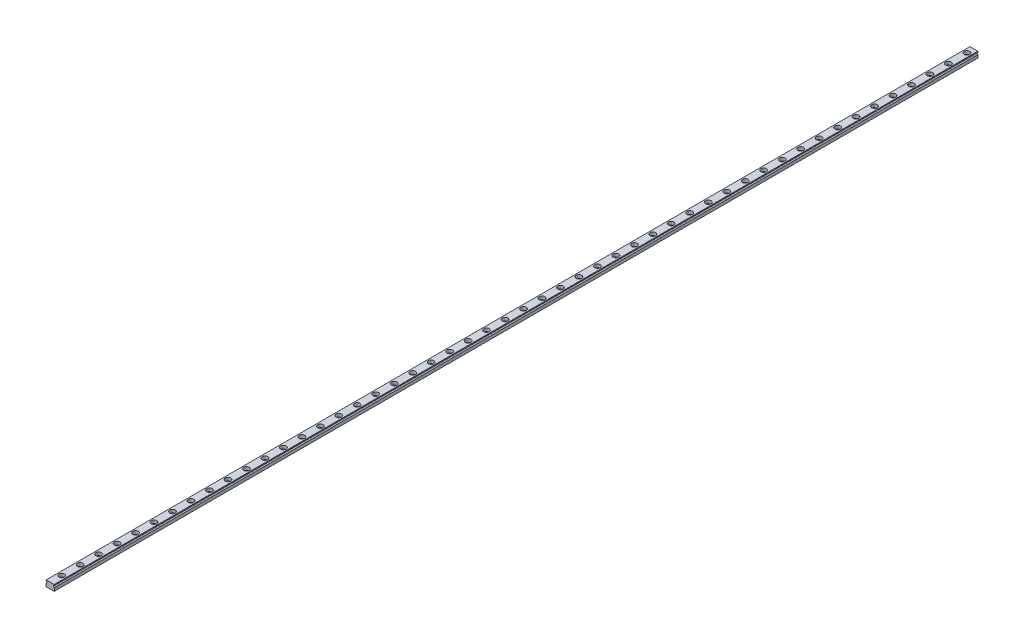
ISO-10303-21;
HEADER;
FILE_DESCRIPTION(('STEP AP214'),'2;1');
FILE_NAME('part.step','',(''),(''),'','','');
FILE_SCHEMA(('AUTOMOTIVE_DESIGN { 1 0 10303 214 1 1 1 1 }'));
ENDSEC;
DATA;
#1=APPLICATION_CONTEXT('core data for automotive mechanical design processes');
#2=APPLICATION_PROTOCOL_DEFINITION('international standard','automotive_design',2000,#1);
#3=PRODUCT_CONTEXT('',#1,'mechanical');
#4=PRODUCT('Part','Part','',(#3));
#5=PRODUCT_RELATED_PRODUCT_CATEGORY('part','',(#4));
#6=PRODUCT_DEFINITION_FORMATION('','',#4);
#7=PRODUCT_DEFINITION_CONTEXT('part definition',#1,'design');
#8=PRODUCT_DEFINITION('design','',#6,#7);
#9=PRODUCT_DEFINITION_SHAPE('','',#8);
#10=(LENGTH_UNIT() NAMED_UNIT(*) SI_UNIT(.MILLI.,.METRE.));
#11=(NAMED_UNIT(*) PLANE_ANGLE_UNIT() SI_UNIT($,.RADIAN.));
#12=(NAMED_UNIT(*) SI_UNIT($,.STERADIAN.) SOLID_ANGLE_UNIT());
#13=UNCERTAINTY_MEASURE_WITH_UNIT(LENGTH_MEASURE(1.E-05),#10,'distance_accuracy_value','');
#14=(GEOMETRIC_REPRESENTATION_CONTEXT(3) GLOBAL_UNCERTAINTY_ASSIGNED_CONTEXT((#13)) GLOBAL_UNIT_ASSIGNED_CONTEXT((#10,
#11,#12)) REPRESENTATION_CONTEXT('',''));
#15=CARTESIAN_POINT('',(0.,0.,0.));
#16=DIRECTION('',(0.,0.,1.));
#17=DIRECTION('',(1.,0.,0.));
#18=AXIS2_PLACEMENT_3D('',#15,#16,#17);
#19=CARTESIAN_POINT('',(4.3,2.85954490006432,1000.));
#20=DIRECTION('',(0.,-1.,0.));
#21=DIRECTION('',(0.,0.,-1.));
#22=AXIS2_PLACEMENT_3D('',#19,#20,#21);
#23=PLANE('',#22);
#24=CARTESIAN_POINT('',(0.,2.85954490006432,27.5000000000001));
#25=DIRECTION('',(0.,1.,0.));
#26=DIRECTION('',(0.,0.,1.));
#27=AXIS2_PLACEMENT_3D('',#24,#25,#26);
#28=CIRCLE('',#27,3.);
#29=CARTESIAN_POINT('',(0.,2.85954490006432,30.5000000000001));
#30=VERTEX_POINT('',#29);
#31=EDGE_CURVE('E1093',#30,#30,#28,.T.);
#32=ORIENTED_EDGE('',*,*,#31,.F.);
#33=EDGE_LOOP('',(#32));
#34=FACE_BOUND('',#33,.T.);
#35=CARTESIAN_POINT('',(0.,2.85954490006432,127.5));
#36=DIRECTION('',(0.,1.,0.));
#37=DIRECTION('',(0.,0.,1.));
#38=AXIS2_PLACEMENT_3D('',#35,#36,#37);
#39=CIRCLE('',#38,3.);
#40=CARTESIAN_POINT('',(0.,2.85954490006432,130.5));
#41=VERTEX_POINT('',#40);
#42=EDGE_CURVE('E1013',#41,#41,#39,.T.);
#43=ORIENTED_EDGE('',*,*,#42,.F.);
#44=EDGE_LOOP('',(#43));
#45=FACE_BOUND('',#44,.T.);
#46=CARTESIAN_POINT('',(0.,2.85954490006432,147.5));
#47=DIRECTION('',(0.,1.,0.));
#48=DIRECTION('',(0.,0.,1.));
#49=AXIS2_PLACEMENT_3D('',#46,#47,#48);
#50=CIRCLE('',#49,3.);
#51=CARTESIAN_POINT('',(0.,2.85954490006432,150.5));
#52=VERTEX_POINT('',#51);
#53=EDGE_CURVE('E997',#52,#52,#50,.T.);
#54=ORIENTED_EDGE('',*,*,#53,.F.);
#55=EDGE_LOOP('',(#54));
#56=FACE_BOUND('',#55,.T.);
#57=CARTESIAN_POINT('',(0.,2.85954490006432,247.499999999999));
#58=DIRECTION('',(0.,1.,0.));
#59=DIRECTION('',(0.,0.,1.));
#60=AXIS2_PLACEMENT_3D('',#57,#58,#59);
#61=CIRCLE('',#60,3.);
#62=CARTESIAN_POINT('',(0.,2.85954490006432,250.499999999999));
#63=VERTEX_POINT('',#62);
#64=EDGE_CURVE('E917',#63,#63,#61,.T.);
#65=ORIENTED_EDGE('',*,*,#64,.F.);
#66=EDGE_LOOP('',(#65));
#67=FACE_BOUND('',#66,.T.);
#68=CARTESIAN_POINT('',(0.,2.85954490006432,427.499999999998));
#69=DIRECTION('',(0.,1.,0.));
#70=DIRECTION('',(0.,0.,1.));
#71=AXIS2_PLACEMENT_3D('',#68,#69,#70);
#72=CIRCLE('',#71,3.);
#73=CARTESIAN_POINT('',(0.,2.85954490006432,430.499999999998));
#74=VERTEX_POINT('',#73);
#75=EDGE_CURVE('E773',#74,#74,#72,.T.);
#76=ORIENTED_EDGE('',*,*,#75,.F.);
#77=EDGE_LOOP('',(#76));
#78=FACE_BOUND('',#77,.T.);
#79=CARTESIAN_POINT('',(0.,2.85954490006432,487.499999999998));
#80=DIRECTION('',(0.,1.,0.));
#81=DIRECTION('',(0.,0.,1.));
#82=AXIS2_PLACEMENT_3D('',#79,#80,#81);
#83=CIRCLE('',#82,3.);
#84=CARTESIAN_POINT('',(0.,2.85954490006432,490.499999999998));
#85=VERTEX_POINT('',#84);
#86=EDGE_CURVE('E725',#85,#85,#83,.T.);
#87=ORIENTED_EDGE('',*,*,#86,.F.);
#88=EDGE_LOOP('',(#87));
#89=FACE_BOUND('',#88,.T.);
#90=CARTESIAN_POINT('',(0.,2.85954490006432,507.499999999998));
#91=DIRECTION('',(0.,1.,0.));
#92=DIRECTION('',(0.,0.,1.));
#93=AXIS2_PLACEMENT_3D('',#90,#91,#92);
#94=CIRCLE('',#93,3.);
#95=CARTESIAN_POINT('',(0.,2.85954490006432,510.499999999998));
#96=VERTEX_POINT('',#95);
#97=EDGE_CURVE('E709',#96,#96,#94,.T.);
#98=ORIENTED_EDGE('',*,*,#97,.F.);
#99=EDGE_LOOP('',(#98));
#100=FACE_BOUND('',#99,.T.);
#101=CARTESIAN_POINT('',(0.,2.85954490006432,547.499999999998));
#102=DIRECTION('',(0.,1.,0.));
#103=DIRECTION('',(0.,0.,1.));
#104=AXIS2_PLACEMENT_3D('',#101,#102,#103);
#105=CIRCLE('',#104,3.);
#106=CARTESIAN_POINT('',(0.,2.85954490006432,550.499999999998));
#107=VERTEX_POINT('',#106);
#108=EDGE_CURVE('E677',#107,#107,#105,.T.);
#109=ORIENTED_EDGE('',*,*,#108,.F.);
#110=EDGE_LOOP('',(#109));
#111=FACE_BOUND('',#110,.T.);
#112=CARTESIAN_POINT('',(0.,2.85954490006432,567.499999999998));
#113=DIRECTION('',(0.,1.,0.));
#114=DIRECTION('',(0.,0.,1.));
#115=AXIS2_PLACEMENT_3D('',#112,#113,#114);
#116=CIRCLE('',#115,3.);
#117=CARTESIAN_POINT('',(0.,2.85954490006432,570.499999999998));
#118=VERTEX_POINT('',#117);
#119=EDGE_CURVE('E661',#118,#118,#116,.T.);
#120=ORIENTED_EDGE('',*,*,#119,.F.);
#121=EDGE_LOOP('',(#120));
#122=FACE_BOUND('',#121,.T.);
#123=CARTESIAN_POINT('',(0.,2.85954490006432,587.499999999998));
#124=DIRECTION('',(0.,1.,0.));
#125=DIRECTION('',(0.,0.,1.));
#126=AXIS2_PLACEMENT_3D('',#123,#124,#125);
#127=CIRCLE('',#126,3.);
#128=CARTESIAN_POINT('',(0.,2.85954490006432,590.499999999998));
#129=VERTEX_POINT('',#128);
#130=EDGE_CURVE('E645',#129,#129,#127,.T.);
#131=ORIENTED_EDGE('',*,*,#130,.F.);
#132=EDGE_LOOP('',(#131));
#133=FACE_BOUND('',#132,.T.);
#134=CARTESIAN_POINT('',(0.,2.85954490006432,607.499999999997));
#135=DIRECTION('',(0.,1.,0.));
#136=DIRECTION('',(0.,0.,1.));
#137=AXIS2_PLACEMENT_3D('',#134,#135,#136);
#138=CIRCLE('',#137,3.);
#139=CARTESIAN_POINT('',(0.,2.85954490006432,610.499999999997));
#140=VERTEX_POINT('',#139);
#141=EDGE_CURVE('E629',#140,#140,#138,.T.);
#142=ORIENTED_EDGE('',*,*,#141,.F.);
#143=EDGE_LOOP('',(#142));
#144=FACE_BOUND('',#143,.T.);
#145=CARTESIAN_POINT('',(0.,2.85954490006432,627.499999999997));
#146=DIRECTION('',(0.,1.,0.));
#147=DIRECTION('',(0.,0.,1.));
#148=AXIS2_PLACEMENT_3D('',#145,#146,#147);
#149=CIRCLE('',#148,3.);
#150=CARTESIAN_POINT('',(0.,2.85954490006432,630.499999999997));
#151=VERTEX_POINT('',#150);
#152=EDGE_CURVE('E613',#151,#151,#149,.T.);
#153=ORIENTED_EDGE('',*,*,#152,.F.);
#154=EDGE_LOOP('',(#153));
#155=FACE_BOUND('',#154,.T.);
#156=CARTESIAN_POINT('',(0.,2.85954490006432,647.499999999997));
#157=DIRECTION('',(0.,1.,0.));
#158=DIRECTION('',(0.,0.,1.));
#159=AXIS2_PLACEMENT_3D('',#156,#157,#158);
#160=CIRCLE('',#159,3.);
#161=CARTESIAN_POINT('',(0.,2.85954490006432,650.499999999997));
#162=VERTEX_POINT('',#161);
#163=EDGE_CURVE('E597',#162,#162,#160,.T.);
#164=ORIENTED_EDGE('',*,*,#163,.F.);
#165=EDGE_LOOP('',(#164));
#166=FACE_BOUND('',#165,.T.);
#167=CARTESIAN_POINT('',(0.,2.85954490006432,687.499999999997));
#168=DIRECTION('',(0.,1.,0.));
#169=DIRECTION('',(0.,0.,1.));
#170=AXIS2_PLACEMENT_3D('',#167,#168,#169);
#171=CIRCLE('',#170,3.);
#172=CARTESIAN_POINT('',(0.,2.85954490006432,690.499999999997));
#173=VERTEX_POINT('',#172);
#174=EDGE_CURVE('E565',#173,#173,#171,.T.);
#175=ORIENTED_EDGE('',*,*,#174,.F.);
#176=EDGE_LOOP('',(#175));
#177=FACE_BOUND('',#176,.T.);
#178=CARTESIAN_POINT('',(0.,2.85954490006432,707.499999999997));
#179=DIRECTION('',(0.,1.,0.));
#180=DIRECTION('',(0.,0.,1.));
#181=AXIS2_PLACEMENT_3D('',#178,#179,#180);
#182=CIRCLE('',#181,3.);
#183=CARTESIAN_POINT('',(0.,2.85954490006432,710.499999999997));
#184=VERTEX_POINT('',#183);
#185=EDGE_CURVE('E549',#184,#184,#182,.T.);
#186=ORIENTED_EDGE('',*,*,#185,.F.);
#187=EDGE_LOOP('',(#186));
#188=FACE_BOUND('',#187,.T.);
#189=CARTESIAN_POINT('',(0.,2.85954490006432,727.499999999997));
#190=DIRECTION('',(0.,1.,0.));
#191=DIRECTION('',(0.,0.,1.));
#192=AXIS2_PLACEMENT_3D('',#189,#190,#191);
#193=CIRCLE('',#192,3.);
#194=CARTESIAN_POINT('',(0.,2.85954490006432,730.499999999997));
#195=VERTEX_POINT('',#194);
#196=EDGE_CURVE('E533',#195,#195,#193,.T.);
#197=ORIENTED_EDGE('',*,*,#196,.F.);
#198=EDGE_LOOP('',(#197));
#199=FACE_BOUND('',#198,.T.);
#200=CARTESIAN_POINT('',(0.,2.85954490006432,747.499999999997));
#201=DIRECTION('',(0.,1.,0.));
#202=DIRECTION('',(0.,0.,1.));
#203=AXIS2_PLACEMENT_3D('',#200,#201,#202);
#204=CIRCLE('',#203,3.);
#205=CARTESIAN_POINT('',(0.,2.85954490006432,750.499999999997));
#206=VERTEX_POINT('',#205);
#207=EDGE_CURVE('E517',#206,#206,#204,.T.);
#208=ORIENTED_EDGE('',*,*,#207,.F.);
#209=EDGE_LOOP('',(#208));
#210=FACE_BOUND('',#209,.T.);
#211=CARTESIAN_POINT('',(0.,2.85954490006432,767.499999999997));
#212=DIRECTION('',(0.,1.,0.));
#213=DIRECTION('',(0.,0.,1.));
#214=AXIS2_PLACEMENT_3D('',#211,#212,#213);
#215=CIRCLE('',#214,3.);
#216=CARTESIAN_POINT('',(0.,2.85954490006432,770.499999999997));
#217=VERTEX_POINT('',#216);
#218=EDGE_CURVE('E501',#217,#217,#215,.T.);
#219=ORIENTED_EDGE('',*,*,#218,.F.);
#220=EDGE_LOOP('',(#219));
#221=FACE_BOUND('',#220,.T.);
#222=CARTESIAN_POINT('',(0.,2.85954490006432,787.499999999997));
#223=DIRECTION('',(0.,1.,0.));
#224=DIRECTION('',(0.,0.,1.));
#225=AXIS2_PLACEMENT_3D('',#222,#223,#224);
#226=CIRCLE('',#225,3.);
#227=CARTESIAN_POINT('',(0.,2.85954490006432,790.499999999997));
#228=VERTEX_POINT('',#227);
#229=EDGE_CURVE('E485',#228,#228,#226,.T.);
#230=ORIENTED_EDGE('',*,*,#229,.F.);
#231=EDGE_LOOP('',(#230));
#232=FACE_BOUND('',#231,.T.);
#233=CARTESIAN_POINT('',(0.,2.85954490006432,807.499999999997));
#234=DIRECTION('',(0.,1.,0.));
#235=DIRECTION('',(0.,0.,1.));
#236=AXIS2_PLACEMENT_3D('',#233,#234,#235);
#237=CIRCLE('',#236,3.);
#238=CARTESIAN_POINT('',(0.,2.85954490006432,810.499999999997));
#239=VERTEX_POINT('',#238);
#240=EDGE_CURVE('E469',#239,#239,#237,.T.);
#241=ORIENTED_EDGE('',*,*,#240,.F.);
#242=EDGE_LOOP('',(#241));
#243=FACE_BOUND('',#242,.T.);
#244=CARTESIAN_POINT('',(0.,2.85954490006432,827.499999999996));
#245=DIRECTION('',(0.,1.,0.));
#246=DIRECTION('',(0.,0.,1.));
#247=AXIS2_PLACEMENT_3D('',#244,#245,#246);
#248=CIRCLE('',#247,3.);
#249=CARTESIAN_POINT('',(0.,2.85954490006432,830.499999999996));
#250=VERTEX_POINT('',#249);
#251=EDGE_CURVE('E453',#250,#250,#248,.T.);
#252=ORIENTED_EDGE('',*,*,#251,.F.);
#253=EDGE_LOOP('',(#252));
#254=FACE_BOUND('',#253,.T.);
#255=CARTESIAN_POINT('',(0.,2.85954490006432,847.499999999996));
#256=DIRECTION('',(0.,1.,0.));
#257=DIRECTION('',(0.,0.,1.));
#258=AXIS2_PLACEMENT_3D('',#255,#256,#257);
#259=CIRCLE('',#258,3.);
#260=CARTESIAN_POINT('',(0.,2.85954490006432,850.499999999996));
#261=VERTEX_POINT('',#260);
#262=EDGE_CURVE('E437',#261,#261,#259,.T.);
#263=ORIENTED_EDGE('',*,*,#262,.F.);
#264=EDGE_LOOP('',(#263));
#265=FACE_BOUND('',#264,.T.);
#266=CARTESIAN_POINT('',(0.,2.85954490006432,867.499999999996));
#267=DIRECTION('',(0.,1.,0.));
#268=DIRECTION('',(0.,0.,1.));
#269=AXIS2_PLACEMENT_3D('',#266,#267,#268);
#270=CIRCLE('',#269,3.);
#271=CARTESIAN_POINT('',(0.,2.85954490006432,870.499999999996));
#272=VERTEX_POINT('',#271);
#273=EDGE_CURVE('E421',#272,#272,#270,.T.);
#274=ORIENTED_EDGE('',*,*,#273,.F.);
#275=EDGE_LOOP('',(#274));
#276=FACE_BOUND('',#275,.T.);
#277=CARTESIAN_POINT('',(0.,2.85954490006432,887.499999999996));
#278=DIRECTION('',(0.,1.,0.));
#279=DIRECTION('',(0.,0.,1.));
#280=AXIS2_PLACEMENT_3D('',#277,#278,#279);
#281=CIRCLE('',#280,3.);
#282=CARTESIAN_POINT('',(0.,2.85954490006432,890.499999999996));
#283=VERTEX_POINT('',#282);
#284=EDGE_CURVE('E405',#283,#283,#281,.T.);
#285=ORIENTED_EDGE('',*,*,#284,.F.);
#286=EDGE_LOOP('',(#285));
#287=FACE_BOUND('',#286,.T.);
#288=CARTESIAN_POINT('',(0.,2.85954490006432,907.499999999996));
#289=DIRECTION('',(0.,1.,0.));
#290=DIRECTION('',(0.,0.,1.));
#291=AXIS2_PLACEMENT_3D('',#288,#289,#290);
#292=CIRCLE('',#291,3.);
#293=CARTESIAN_POINT('',(0.,2.85954490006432,910.499999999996));
#294=VERTEX_POINT('',#293);
#295=EDGE_CURVE('E389',#294,#294,#292,.T.);
#296=ORIENTED_EDGE('',*,*,#295,.F.);
#297=EDGE_LOOP('',(#296));
#298=FACE_BOUND('',#297,.T.);
#299=CARTESIAN_POINT('',(0.,2.85954490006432,927.499999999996));
#300=DIRECTION('',(0.,1.,0.));
#301=DIRECTION('',(0.,0.,1.));
#302=AXIS2_PLACEMENT_3D('',#299,#300,#301);
#303=CIRCLE('',#302,3.);
#304=CARTESIAN_POINT('',(0.,2.85954490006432,930.499999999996));
#305=VERTEX_POINT('',#304);
#306=EDGE_CURVE('E373',#305,#305,#303,.T.);
#307=ORIENTED_EDGE('',*,*,#306,.F.);
#308=EDGE_LOOP('',(#307));
#309=FACE_BOUND('',#308,.T.);
#310=CARTESIAN_POINT('',(0.,2.85954490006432,947.499999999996));
#311=DIRECTION('',(0.,1.,0.));
#312=DIRECTION('',(0.,0.,1.));
#313=AXIS2_PLACEMENT_3D('',#310,#311,#312);
#314=CIRCLE('',#313,3.);
#315=CARTESIAN_POINT('',(0.,2.85954490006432,950.499999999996));
#316=VERTEX_POINT('',#315);
#317=EDGE_CURVE('E357',#316,#316,#314,.T.);
#318=ORIENTED_EDGE('',*,*,#317,.F.);
#319=EDGE_LOOP('',(#318));
#320=FACE_BOUND('',#319,.T.);
#321=CARTESIAN_POINT('',(0.,2.85954490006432,967.499999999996));
#322=DIRECTION('',(0.,1.,0.));
#323=DIRECTION('',(0.,0.,1.));
#324=AXIS2_PLACEMENT_3D('',#321,#322,#323);
#325=CIRCLE('',#324,3.);
#326=CARTESIAN_POINT('',(0.,2.85954490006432,970.499999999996));
#327=VERTEX_POINT('',#326);
#328=EDGE_CURVE('E341',#327,#327,#325,.T.);
#329=ORIENTED_EDGE('',*,*,#328,.F.);
#330=EDGE_LOOP('',(#329));
#331=FACE_BOUND('',#330,.T.);
#332=CARTESIAN_POINT('',(0.,2.85954490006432,987.499999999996));
#333=DIRECTION('',(0.,1.,0.));
#334=DIRECTION('',(0.,0.,1.));
#335=AXIS2_PLACEMENT_3D('',#332,#333,#334);
#336=CIRCLE('',#335,3.);
#337=CARTESIAN_POINT('',(0.,2.85954490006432,990.499999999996));
#338=VERTEX_POINT('',#337);
#339=EDGE_CURVE('E325',#338,#338,#336,.T.);
#340=ORIENTED_EDGE('',*,*,#339,.F.);
#341=EDGE_LOOP('',(#340));
#342=FACE_BOUND('',#341,.T.);
#343=CARTESIAN_POINT('',(0.,2.85954490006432,7.5));
#344=DIRECTION('',(0.,1.,0.));
#345=DIRECTION('',(0.,0.,1.));
#346=AXIS2_PLACEMENT_3D('',#343,#344,#345);
#347=CIRCLE('',#346,3.);
#348=CARTESIAN_POINT('',(0.,2.85954490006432,10.5));
#349=VERTEX_POINT('',#348);
#350=EDGE_CURVE('E309',#349,#349,#347,.T.);
#351=ORIENTED_EDGE('',*,*,#350,.F.);
#352=EDGE_LOOP('',(#351));
#353=FACE_BOUND('',#352,.T.);
#354=DIRECTION('',(-1.,0.,0.));
#355=VECTOR('',#354,1.);
#356=CARTESIAN_POINT('',(4.3,2.85954490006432,0.));
#357=LINE('',#356,#355);
#358=CARTESIAN_POINT('',(4.3,2.85954490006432,0.));
#359=VERTEX_POINT('',#358);
#360=CARTESIAN_POINT('',(-4.3,2.85954490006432,0.));
#361=VERTEX_POINT('',#360);
#362=EDGE_CURVE('E181',#359,#361,#357,.T.);
#363=ORIENTED_EDGE('',*,*,#362,.T.);
#364=DIRECTION('',(0.,0.,-1.));
#365=VECTOR('',#364,1.);
#366=CARTESIAN_POINT('',(-4.3,2.85954490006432,1000.));
#367=LINE('',#366,#365);
#368=CARTESIAN_POINT('',(-4.3,2.85954490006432,1000.));
#369=VERTEX_POINT('',#368);
#370=EDGE_CURVE('E231',#369,#361,#367,.T.);
#371=ORIENTED_EDGE('',*,*,#370,.F.);
#372=DIRECTION('',(-1.,0.,0.));
#373=VECTOR('',#372,1.);
#374=CARTESIAN_POINT('',(4.3,2.85954490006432,1000.));
#375=LINE('',#374,#373);
#376=CARTESIAN_POINT('',(4.3,2.85954490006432,1000.));
#377=VERTEX_POINT('',#376);
#378=EDGE_CURVE('E265',#377,#369,#375,.T.);
#379=ORIENTED_EDGE('',*,*,#378,.F.);
#380=DIRECTION('',(0.,0.,-1.));
#381=VECTOR('',#380,1.);
#382=CARTESIAN_POINT('',(4.3,2.85954490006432,1000.));
#383=LINE('',#382,#381);
#384=EDGE_CURVE('E235',#377,#359,#383,.T.);
#385=ORIENTED_EDGE('',*,*,#384,.T.);
#386=EDGE_LOOP('',(#363,#371,#379,#385));
#387=FACE_BOUND('',#386,.T.);
#388=CARTESIAN_POINT('',(0.,2.85954490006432,667.499999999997));
#389=DIRECTION('',(0.,1.,0.));
#390=DIRECTION('',(0.,0.,1.));
#391=AXIS2_PLACEMENT_3D('',#388,#389,#390);
#392=CIRCLE('',#391,3.);
#393=CARTESIAN_POINT('',(0.,2.85954490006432,670.499999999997));
#394=VERTEX_POINT('',#393);
#395=EDGE_CURVE('E581',#394,#394,#392,.T.);
#396=ORIENTED_EDGE('',*,*,#395,.F.);
#397=EDGE_LOOP('',(#396));
#398=FACE_BOUND('',#397,.T.);
#399=CARTESIAN_POINT('',(0.,2.85954490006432,527.499999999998));
#400=DIRECTION('',(0.,1.,0.));
#401=DIRECTION('',(0.,0.,1.));
#402=AXIS2_PLACEMENT_3D('',#399,#400,#401);
#403=CIRCLE('',#402,3.);
#404=CARTESIAN_POINT('',(0.,2.85954490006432,530.499999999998));
#405=VERTEX_POINT('',#404);
#406=EDGE_CURVE('E693',#405,#405,#403,.T.);
#407=ORIENTED_EDGE('',*,*,#406,.F.);
#408=EDGE_LOOP('',(#407));
#409=FACE_BOUND('',#408,.T.);
#410=CARTESIAN_POINT('',(0.,2.85954490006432,467.499999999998));
#411=DIRECTION('',(0.,1.,0.));
#412=DIRECTION('',(0.,0.,1.));
#413=AXIS2_PLACEMENT_3D('',#410,#411,#412);
#414=CIRCLE('',#413,3.);
#415=CARTESIAN_POINT('',(0.,2.85954490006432,470.499999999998));
#416=VERTEX_POINT('',#415);
#417=EDGE_CURVE('E741',#416,#416,#414,.T.);
#418=ORIENTED_EDGE('',*,*,#417,.F.);
#419=EDGE_LOOP('',(#418));
#420=FACE_BOUND('',#419,.T.);
#421=CARTESIAN_POINT('',(0.,2.85954490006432,447.499999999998));
#422=DIRECTION('',(0.,1.,0.));
#423=DIRECTION('',(0.,0.,1.));
#424=AXIS2_PLACEMENT_3D('',#421,#422,#423);
#425=CIRCLE('',#424,3.);
#426=CARTESIAN_POINT('',(0.,2.85954490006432,450.499999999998));
#427=VERTEX_POINT('',#426);
#428=EDGE_CURVE('E757',#427,#427,#425,.T.);
#429=ORIENTED_EDGE('',*,*,#428,.F.);
#430=EDGE_LOOP('',(#429));
#431=FACE_BOUND('',#430,.T.);
#432=CARTESIAN_POINT('',(0.,2.85954490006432,407.499999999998));
#433=DIRECTION('',(0.,1.,0.));
#434=DIRECTION('',(0.,0.,1.));
#435=AXIS2_PLACEMENT_3D('',#432,#433,#434);
#436=CIRCLE('',#435,3.);
#437=CARTESIAN_POINT('',(0.,2.85954490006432,410.499999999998));
#438=VERTEX_POINT('',#437);
#439=EDGE_CURVE('E789',#438,#438,#436,.T.);
#440=ORIENTED_EDGE('',*,*,#439,.F.);
#441=EDGE_LOOP('',(#440));
#442=FACE_BOUND('',#441,.T.);
#443=CARTESIAN_POINT('',(0.,2.85954490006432,387.499999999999));
#444=DIRECTION('',(0.,1.,0.));
#445=DIRECTION('',(0.,0.,1.));
#446=AXIS2_PLACEMENT_3D('',#443,#444,#445);
#447=CIRCLE('',#446,3.);
#448=CARTESIAN_POINT('',(0.,2.85954490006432,390.499999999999));
#449=VERTEX_POINT('',#448);
#450=EDGE_CURVE('E805',#449,#449,#447,.T.);
#451=ORIENTED_EDGE('',*,*,#450,.F.);
#452=EDGE_LOOP('',(#451));
#453=FACE_BOUND('',#452,.T.);
#454=CARTESIAN_POINT('',(0.,2.85954490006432,367.499999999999));
#455=DIRECTION('',(0.,1.,0.));
#456=DIRECTION('',(0.,0.,1.));
#457=AXIS2_PLACEMENT_3D('',#454,#455,#456);
#458=CIRCLE('',#457,3.);
#459=CARTESIAN_POINT('',(0.,2.85954490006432,370.499999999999));
#460=VERTEX_POINT('',#459);
#461=EDGE_CURVE('E821',#460,#460,#458,.T.);
#462=ORIENTED_EDGE('',*,*,#461,.F.);
#463=EDGE_LOOP('',(#462));
#464=FACE_BOUND('',#463,.T.);
#465=CARTESIAN_POINT('',(0.,2.85954490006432,347.499999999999));
#466=DIRECTION('',(0.,1.,0.));
#467=DIRECTION('',(0.,0.,1.));
#468=AXIS2_PLACEMENT_3D('',#465,#466,#467);
#469=CIRCLE('',#468,3.);
#470=CARTESIAN_POINT('',(0.,2.85954490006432,350.499999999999));
#471=VERTEX_POINT('',#470);
#472=EDGE_CURVE('E837',#471,#471,#469,.T.);
#473=ORIENTED_EDGE('',*,*,#472,.F.);
#474=EDGE_LOOP('',(#473));
#475=FACE_BOUND('',#474,.T.);
#476=CARTESIAN_POINT('',(0.,2.85954490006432,327.499999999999));
#477=DIRECTION('',(0.,1.,0.));
#478=DIRECTION('',(0.,0.,1.));
#479=AXIS2_PLACEMENT_3D('',#476,#477,#478);
#480=CIRCLE('',#479,3.);
#481=CARTESIAN_POINT('',(0.,2.85954490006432,330.499999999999));
#482=VERTEX_POINT('',#481);
#483=EDGE_CURVE('E853',#482,#482,#480,.T.);
#484=ORIENTED_EDGE('',*,*,#483,.F.);
#485=EDGE_LOOP('',(#484));
#486=FACE_BOUND('',#485,.T.);
#487=CARTESIAN_POINT('',(0.,2.85954490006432,307.499999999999));
#488=DIRECTION('',(0.,1.,0.));
#489=DIRECTION('',(0.,0.,1.));
#490=AXIS2_PLACEMENT_3D('',#487,#488,#489);
#491=CIRCLE('',#490,3.);
#492=CARTESIAN_POINT('',(0.,2.85954490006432,310.499999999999));
#493=VERTEX_POINT('',#492);
#494=EDGE_CURVE('E869',#493,#493,#491,.T.);
#495=ORIENTED_EDGE('',*,*,#494,.F.);
#496=EDGE_LOOP('',(#495));
#497=FACE_BOUND('',#496,.T.);
#498=CARTESIAN_POINT('',(0.,2.85954490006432,287.499999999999));
#499=DIRECTION('',(0.,1.,0.));
#500=DIRECTION('',(0.,0.,1.));
#501=AXIS2_PLACEMENT_3D('',#498,#499,#500);
#502=CIRCLE('',#501,3.);
#503=CARTESIAN_POINT('',(0.,2.85954490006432,290.499999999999));
#504=VERTEX_POINT('',#503);
#505=EDGE_CURVE('E885',#504,#504,#502,.T.);
#506=ORIENTED_EDGE('',*,*,#505,.F.);
#507=EDGE_LOOP('',(#506));
#508=FACE_BOUND('',#507,.T.);
#509=CARTESIAN_POINT('',(0.,2.85954490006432,267.499999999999));
#510=DIRECTION('',(0.,1.,0.));
#511=DIRECTION('',(0.,0.,1.));
#512=AXIS2_PLACEMENT_3D('',#509,#510,#511);
#513=CIRCLE('',#512,3.);
#514=CARTESIAN_POINT('',(0.,2.85954490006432,270.499999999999));
#515=VERTEX_POINT('',#514);
#516=EDGE_CURVE('E901',#515,#515,#513,.T.);
#517=ORIENTED_EDGE('',*,*,#516,.F.);
#518=EDGE_LOOP('',(#517));
#519=FACE_BOUND('',#518,.T.);
#520=CARTESIAN_POINT('',(0.,2.85954490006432,227.499999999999));
#521=DIRECTION('',(0.,1.,0.));
#522=DIRECTION('',(0.,0.,1.));
#523=AXIS2_PLACEMENT_3D('',#520,#521,#522);
#524=CIRCLE('',#523,3.);
#525=CARTESIAN_POINT('',(0.,2.85954490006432,230.499999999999));
#526=VERTEX_POINT('',#525);
#527=EDGE_CURVE('E933',#526,#526,#524,.T.);
#528=ORIENTED_EDGE('',*,*,#527,.F.);
#529=EDGE_LOOP('',(#528));
#530=FACE_BOUND('',#529,.T.);
#531=CARTESIAN_POINT('',(0.,2.85954490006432,207.499999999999));
#532=DIRECTION('',(0.,1.,0.));
#533=DIRECTION('',(0.,0.,1.));
#534=AXIS2_PLACEMENT_3D('',#531,#532,#533);
#535=CIRCLE('',#534,3.);
#536=CARTESIAN_POINT('',(0.,2.85954490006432,210.499999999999));
#537=VERTEX_POINT('',#536);
#538=EDGE_CURVE('E949',#537,#537,#535,.T.);
#539=ORIENTED_EDGE('',*,*,#538,.F.);
#540=EDGE_LOOP('',(#539));
#541=FACE_BOUND('',#540,.T.);
#542=CARTESIAN_POINT('',(0.,2.85954490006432,187.499999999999));
#543=DIRECTION('',(0.,1.,0.));
#544=DIRECTION('',(0.,0.,1.));
#545=AXIS2_PLACEMENT_3D('',#542,#543,#544);
#546=CIRCLE('',#545,3.);
#547=CARTESIAN_POINT('',(0.,2.85954490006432,190.499999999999));
#548=VERTEX_POINT('',#547);
#549=EDGE_CURVE('E965',#548,#548,#546,.T.);
#550=ORIENTED_EDGE('',*,*,#549,.F.);
#551=EDGE_LOOP('',(#550));
#552=FACE_BOUND('',#551,.T.);
#553=CARTESIAN_POINT('',(0.,2.85954490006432,167.5));
#554=DIRECTION('',(0.,1.,0.));
#555=DIRECTION('',(0.,0.,1.));
#556=AXIS2_PLACEMENT_3D('',#553,#554,#555);
#557=CIRCLE('',#556,3.);
#558=CARTESIAN_POINT('',(0.,2.85954490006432,170.5));
#559=VERTEX_POINT('',#558);
#560=EDGE_CURVE('E981',#559,#559,#557,.T.);
#561=ORIENTED_EDGE('',*,*,#560,.F.);
#562=EDGE_LOOP('',(#561));
#563=FACE_BOUND('',#562,.T.);
#564=CARTESIAN_POINT('',(0.,2.85954490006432,107.5));
#565=DIRECTION('',(0.,1.,0.));
#566=DIRECTION('',(0.,0.,1.));
#567=AXIS2_PLACEMENT_3D('',#564,#565,#566);
#568=CIRCLE('',#567,3.);
#569=CARTESIAN_POINT('',(0.,2.85954490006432,110.5));
#570=VERTEX_POINT('',#569);
#571=EDGE_CURVE('E1029',#570,#570,#568,.T.);
#572=ORIENTED_EDGE('',*,*,#571,.F.);
#573=EDGE_LOOP('',(#572));
#574=FACE_BOUND('',#573,.T.);
#575=CARTESIAN_POINT('',(0.,2.85954490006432,87.4999999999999));
#576=DIRECTION('',(0.,1.,0.));
#577=DIRECTION('',(0.,0.,1.));
#578=AXIS2_PLACEMENT_3D('',#575,#576,#577);
#579=CIRCLE('',#578,3.);
#580=CARTESIAN_POINT('',(0.,2.85954490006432,90.4999999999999));
#581=VERTEX_POINT('',#580);
#582=EDGE_CURVE('E1045',#581,#581,#579,.T.);
#583=ORIENTED_EDGE('',*,*,#582,.F.);
#584=EDGE_LOOP('',(#583));
#585=FACE_BOUND('',#584,.T.);
#586=CARTESIAN_POINT('',(0.,2.85954490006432,67.4999999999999));
#587=DIRECTION('',(0.,1.,0.));
#588=DIRECTION('',(0.,0.,1.));
#589=AXIS2_PLACEMENT_3D('',#586,#587,#588);
#590=CIRCLE('',#589,3.);
#591=CARTESIAN_POINT('',(0.,2.85954490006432,70.5));
#592=VERTEX_POINT('',#591);
#593=EDGE_CURVE('E1061',#592,#592,#590,.T.);
#594=ORIENTED_EDGE('',*,*,#593,.F.);
#595=EDGE_LOOP('',(#594));
#596=FACE_BOUND('',#595,.T.);
#597=CARTESIAN_POINT('',(0.,2.85954490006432,47.5));
#598=DIRECTION('',(0.,1.,0.));
#599=DIRECTION('',(0.,0.,1.));
#600=AXIS2_PLACEMENT_3D('',#597,#598,#599);
#601=CIRCLE('',#600,3.);
#602=CARTESIAN_POINT('',(0.,2.85954490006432,50.5));
#603=VERTEX_POINT('',#602);
#604=EDGE_CURVE('E1077',#603,#603,#601,.T.);
#605=ORIENTED_EDGE('',*,*,#604,.F.);
#606=EDGE_LOOP('',(#605));
#607=FACE_BOUND('',#606,.T.);
#608=ADVANCED_FACE('F45',(#34,#45,#56,#67,#78,#89,#100,#111,#122,#133,#144,#155,#166,#177,#188,
#199,#210,#221,#232,#243,#254,#265,#276,#287,#298,#309,#320,#331,#342,#353,#387,#398,#409,#420,
#431,#442,#453,#464,#475,#486,#497,#508,#519,#530,#541,#552,#563,#574,#585,#596,#607),#23,.F.);
#609=CARTESIAN_POINT('',(4.5,1.85954490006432,1000.));
#610=DIRECTION('',(-1.,0.,0.));
#611=DIRECTION('',(0.,0.,1.));
#612=AXIS2_PLACEMENT_3D('',#609,#610,#611);
#613=PLANE('',#612);
#614=DIRECTION('',(0.,1.,0.));
#615=VECTOR('',#614,1.);
#616=CARTESIAN_POINT('',(4.5,1.85954490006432,0.));
#617=LINE('',#616,#615);
#618=CARTESIAN_POINT('',(4.5,1.85954490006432,0.));
#619=VERTEX_POINT('',#618);
#620=CARTESIAN_POINT('',(4.5,2.65954490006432,0.));
#621=VERTEX_POINT('',#620);
#622=EDGE_CURVE('E174',#619,#621,#617,.T.);
#623=ORIENTED_EDGE('',*,*,#622,.T.);
#624=DIRECTION('',(0.,0.,-1.));
#625=VECTOR('',#624,1.);
#626=CARTESIAN_POINT('',(4.5,2.65954490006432,1000.));
#627=LINE('',#626,#625);
#628=CARTESIAN_POINT('',(4.5,2.65954490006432,1000.));
#629=VERTEX_POINT('',#628);
#630=EDGE_CURVE('E55',#629,#621,#627,.T.);
#631=ORIENTED_EDGE('',*,*,#630,.F.);
#632=DIRECTION('',(0.,1.,0.));
#633=VECTOR('',#632,1.);
#634=CARTESIAN_POINT('',(4.5,1.85954490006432,1000.));
#635=LINE('',#634,#633);
#636=CARTESIAN_POINT('',(4.5,1.85954490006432,1000.));
#637=VERTEX_POINT('',#636);
#638=EDGE_CURVE('E119',#637,#629,#635,.T.);
#639=ORIENTED_EDGE('',*,*,#638,.F.);
#640=DIRECTION('',(0.,0.,-1.));
#641=VECTOR('',#640,1.);
#642=CARTESIAN_POINT('',(4.5,1.85954490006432,1000.));
#643=LINE('',#642,#641);
#644=EDGE_CURVE('E12',#637,#619,#643,.T.);
#645=ORIENTED_EDGE('',*,*,#644,.T.);
#646=EDGE_LOOP('',(#623,#631,#639,#645));
#647=FACE_BOUND('',#646,.T.);
#648=ADVANCED_FACE('F47',(#647),#613,.F.);
#649=CARTESIAN_POINT('',(4.5,2.65954490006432,1000.));
#650=DIRECTION('',(-0.707106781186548,-0.707106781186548,0.));
#651=DIRECTION('',(0.707106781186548,-0.707106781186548,0.));
#652=AXIS2_PLACEMENT_3D('',#649,#650,#651);
#653=PLANE('',#652);
#654=DIRECTION('',(-0.707106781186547,0.707106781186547,0.));
#655=VECTOR('',#654,1.);
#656=CARTESIAN_POINT('',(4.5,2.65954490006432,0.));
#657=LINE('',#656,#655);
#658=EDGE_CURVE('E177',#621,#359,#657,.T.);
#659=ORIENTED_EDGE('',*,*,#658,.T.);
#660=ORIENTED_EDGE('',*,*,#384,.F.);
#661=DIRECTION('',(-0.707106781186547,0.707106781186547,0.));
#662=VECTOR('',#661,1.);
#663=CARTESIAN_POINT('',(4.5,2.65954490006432,1000.));
#664=LINE('',#663,#662);
#665=EDGE_CURVE('E245',#629,#377,#664,.T.);
#666=ORIENTED_EDGE('',*,*,#665,.F.);
#667=ORIENTED_EDGE('',*,*,#630,.T.);
#668=EDGE_LOOP('',(#659,#660,#666,#667));
#669=FACE_BOUND('',#668,.T.);
#670=ADVANCED_FACE('F243',(#669),#653,.F.);
#671=CARTESIAN_POINT('',(-4.3,2.85954490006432,1000.));
#672=DIRECTION('',(0.707106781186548,-0.707106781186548,0.));
#673=DIRECTION('',(0.707106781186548,0.707106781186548,0.));
#674=AXIS2_PLACEMENT_3D('',#671,#672,#673);
#675=PLANE('',#674);
#676=DIRECTION('',(-0.707106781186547,-0.707106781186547,0.));
#677=VECTOR('',#676,1.);
#678=CARTESIAN_POINT('',(-4.3,2.85954490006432,0.));
#679=LINE('',#678,#677);
#680=CARTESIAN_POINT('',(-4.5,2.65954490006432,0.));
#681=VERTEX_POINT('',#680);
#682=EDGE_CURVE('E184',#361,#681,#679,.T.);
#683=ORIENTED_EDGE('',*,*,#682,.T.);
#684=DIRECTION('',(0.,0.,-1.));
#685=VECTOR('',#684,1.);
#686=CARTESIAN_POINT('',(-4.5,2.65954490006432,1000.));
#687=LINE('',#686,#685);
#688=CARTESIAN_POINT('',(-4.5,2.65954490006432,1000.));
#689=VERTEX_POINT('',#688);
#690=EDGE_CURVE('E227',#689,#681,#687,.T.);
#691=ORIENTED_EDGE('',*,*,#690,.F.);
#692=DIRECTION('',(-0.707106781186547,-0.707106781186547,0.));
#693=VECTOR('',#692,1.);
#694=CARTESIAN_POINT('',(-4.3,2.85954490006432,1000.));
#695=LINE('',#694,#693);
#696=EDGE_CURVE('E261',#369,#689,#695,.T.);
#697=ORIENTED_EDGE('',*,*,#696,.F.);
#698=ORIENTED_EDGE('',*,*,#370,.T.);
#699=EDGE_LOOP('',(#683,#691,#697,#698));
#700=FACE_BOUND('',#699,.T.);
#701=ADVANCED_FACE('F259',(#700),#675,.F.);
#702=CARTESIAN_POINT('',(-4.5,2.65954490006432,1000.));
#703=DIRECTION('',(1.,0.,0.));
#704=DIRECTION('',(0.,0.,-1.));
#705=AXIS2_PLACEMENT_3D('',#702,#703,#704);
#706=PLANE('',#705);
#707=DIRECTION('',(0.,-1.,0.));
#708=VECTOR('',#707,1.);
#709=CARTESIAN_POINT('',(-4.5,2.65954490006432,0.));
#710=LINE('',#709,#708);
#711=CARTESIAN_POINT('',(-4.5,1.85954490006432,0.));
#712=VERTEX_POINT('',#711);
#713=EDGE_CURVE('E187',#681,#712,#710,.T.);
#714=ORIENTED_EDGE('',*,*,#713,.T.);
#715=DIRECTION('',(0.,0.,-1.));
#716=VECTOR('',#715,1.);
#717=CARTESIAN_POINT('',(-4.5,1.85954490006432,1000.));
#718=LINE('',#717,#716);
#719=CARTESIAN_POINT('',(-4.5,1.85954490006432,1000.));
#720=VERTEX_POINT('',#719);
#721=EDGE_CURVE('E223',#720,#712,#718,.T.);
#722=ORIENTED_EDGE('',*,*,#721,.F.);
#723=DIRECTION('',(0.,-1.,0.));
#724=VECTOR('',#723,1.);
#725=CARTESIAN_POINT('',(-4.5,2.65954490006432,1000.));
#726=LINE('',#725,#724);
#727=EDGE_CURVE('E264',#689,#720,#726,.T.);
#728=ORIENTED_EDGE('',*,*,#727,.F.);
#729=ORIENTED_EDGE('',*,*,#690,.T.);
#730=EDGE_LOOP('',(#714,#722,#728,#729));
#731=FACE_BOUND('',#730,.T.);
#732=ADVANCED_FACE('F1203',(#731),#706,.F.);
#733=CARTESIAN_POINT('',(-4.5,0.859544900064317,1000.));
#734=DIRECTION('',(0.,0.,-1.));
#735=DIRECTION('',(-1.,0.,0.));
#736=AXIS2_PLACEMENT_3D('',#733,#734,#735);
#737=CYLINDRICAL_SURFACE('',#736,1.);
#738=CARTESIAN_POINT('',(-4.5,0.859544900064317,0.));
#739=DIRECTION('',(0.,0.,-1.));
#740=DIRECTION('',(1.,0.,0.));
#741=AXIS2_PLACEMENT_3D('',#738,#739,#740);
#742=CIRCLE('',#741,1.);
#743=CARTESIAN_POINT('',(-4.5,-0.140455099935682,0.));
#744=VERTEX_POINT('',#743);
#745=EDGE_CURVE('E190',#712,#744,#742,.T.);
#746=ORIENTED_EDGE('',*,*,#745,.T.);
#747=DIRECTION('',(0.,0.,-1.));
#748=VECTOR('',#747,1.);
#749=CARTESIAN_POINT('',(-4.5,-0.140455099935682,1000.));
#750=LINE('',#749,#748);
#751=CARTESIAN_POINT('',(-4.5,-0.140455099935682,1000.));
#752=VERTEX_POINT('',#751);
#753=EDGE_CURVE('E219',#752,#744,#750,.T.);
#754=ORIENTED_EDGE('',*,*,#753,.F.);
#755=CARTESIAN_POINT('',(-4.5,0.859544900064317,1000.));
#756=DIRECTION('',(0.,0.,-1.));
#757=DIRECTION('',(1.,0.,0.));
#758=AXIS2_PLACEMENT_3D('',#755,#756,#757);
#759=CIRCLE('',#758,1.);
#760=EDGE_CURVE('E269',#720,#752,#759,.T.);
#761=ORIENTED_EDGE('',*,*,#760,.F.);
#762=ORIENTED_EDGE('',*,*,#721,.T.);
#763=EDGE_LOOP('',(#746,#754,#761,#762));
#764=FACE_BOUND('',#763,.T.);
#765=ADVANCED_FACE('F1200',(#764),#737,.F.);
#766=CARTESIAN_POINT('',(-4.5,-0.140455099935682,1000.));
#767=DIRECTION('',(1.,0.,0.));
#768=DIRECTION('',(0.,0.,-1.));
#769=AXIS2_PLACEMENT_3D('',#766,#767,#768);
#770=PLANE('',#769);
#771=DIRECTION('',(0.,-1.,0.));
#772=VECTOR('',#771,1.);
#773=CARTESIAN_POINT('',(-4.5,-0.140455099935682,0.));
#774=LINE('',#773,#772);
#775=CARTESIAN_POINT('',(-4.5,-3.44045509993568,0.));
#776=VERTEX_POINT('',#775);
#777=EDGE_CURVE('E193',#744,#776,#774,.T.);
#778=ORIENTED_EDGE('',*,*,#777,.T.);
#779=DIRECTION('',(0.,0.,-1.));
#780=VECTOR('',#779,1.);
#781=CARTESIAN_POINT('',(-4.5,-3.44045509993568,1000.));
#782=LINE('',#781,#780);
#783=CARTESIAN_POINT('',(-4.5,-3.44045509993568,1000.));
#784=VERTEX_POINT('',#783);
#785=EDGE_CURVE('E215',#784,#776,#782,.T.);
#786=ORIENTED_EDGE('',*,*,#785,.F.);
#787=DIRECTION('',(0.,-1.,0.));
#788=VECTOR('',#787,1.);
#789=CARTESIAN_POINT('',(-4.5,-0.140455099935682,1000.));
#790=LINE('',#789,#788);
#791=EDGE_CURVE('E276',#752,#784,#790,.T.);
#792=ORIENTED_EDGE('',*,*,#791,.F.);
#793=ORIENTED_EDGE('',*,*,#753,.T.);
#794=EDGE_LOOP('',(#778,#786,#792,#793));
#795=FACE_BOUND('',#794,.T.);
#796=ADVANCED_FACE('F284',(#795),#770,.F.);
#797=CARTESIAN_POINT('',(-4.5,-3.44045509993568,1000.));
#798=DIRECTION('',(0.707106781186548,0.707106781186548,0.));
#799=DIRECTION('',(-0.707106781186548,0.707106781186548,0.));
#800=AXIS2_PLACEMENT_3D('',#797,#798,#799);
#801=PLANE('',#800);
#802=DIRECTION('',(0.707106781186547,-0.707106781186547,0.));
#803=VECTOR('',#802,1.);
#804=CARTESIAN_POINT('',(-4.5,-3.44045509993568,0.));
#805=LINE('',#804,#803);
#806=CARTESIAN_POINT('',(-4.3,-3.64045509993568,0.));
#807=VERTEX_POINT('',#806);
#808=EDGE_CURVE('E196',#776,#807,#805,.T.);
#809=ORIENTED_EDGE('',*,*,#808,.T.);
#810=DIRECTION('',(0.,0.,-1.));
#811=VECTOR('',#810,1.);
#812=CARTESIAN_POINT('',(-4.3,-3.64045509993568,1000.));
#813=LINE('',#812,#811);
#814=CARTESIAN_POINT('',(-4.3,-3.64045509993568,1000.));
#815=VERTEX_POINT('',#814);
#816=EDGE_CURVE('E161',#815,#807,#813,.T.);
#817=ORIENTED_EDGE('',*,*,#816,.F.);
#818=DIRECTION('',(0.707106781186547,-0.707106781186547,0.));
#819=VECTOR('',#818,1.);
#820=CARTESIAN_POINT('',(-4.5,-3.44045509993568,1000.));
#821=LINE('',#820,#819);
#822=EDGE_CURVE('E151',#784,#815,#821,.T.);
#823=ORIENTED_EDGE('',*,*,#822,.F.);
#824=ORIENTED_EDGE('',*,*,#785,.T.);
#825=EDGE_LOOP('',(#809,#817,#823,#824));
#826=FACE_BOUND('',#825,.T.);
#827=ADVANCED_FACE('F288',(#826),#801,.F.);
#828=CARTESIAN_POINT('',(0.8,-3.64045509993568,1000.));
#829=DIRECTION('',(0.,1.,0.));
#830=DIRECTION('',(-1.,0.,0.));
#831=AXIS2_PLACEMENT_3D('',#828,#829,#830);
#832=PLANE('',#831);
#833=CARTESIAN_POINT('',(0.,-3.64045509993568,27.5000000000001));
#834=DIRECTION('',(0.,1.,0.));
#835=DIRECTION('',(0.,0.,1.));
#836=AXIS2_PLACEMENT_3D('',#833,#834,#835);
#837=CIRCLE('',#836,1.75);
#838=CARTESIAN_POINT('',(0.,-3.64045509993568,29.2500000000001));
#839=VERTEX_POINT('',#838);
#840=EDGE_CURVE('E1081',#839,#839,#837,.T.);
#841=ORIENTED_EDGE('',*,*,#840,.T.);
#842=EDGE_LOOP('',(#841));
#843=FACE_BOUND('',#842,.T.);
#844=CARTESIAN_POINT('',(0.,-3.64045509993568,47.5));
#845=DIRECTION('',(0.,1.,0.));
#846=DIRECTION('',(0.,0.,1.));
#847=AXIS2_PLACEMENT_3D('',#844,#845,#846);
#848=CIRCLE('',#847,1.75);
#849=CARTESIAN_POINT('',(0.,-3.64045509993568,49.25));
#850=VERTEX_POINT('',#849);
#851=EDGE_CURVE('E1065',#850,#850,#848,.T.);
#852=ORIENTED_EDGE('',*,*,#851,.T.);
#853=EDGE_LOOP('',(#852));
#854=FACE_BOUND('',#853,.T.);
#855=CARTESIAN_POINT('',(0.,-3.64045509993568,67.4999999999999));
#856=DIRECTION('',(0.,1.,0.));
#857=DIRECTION('',(0.,0.,1.));
#858=AXIS2_PLACEMENT_3D('',#855,#856,#857);
#859=CIRCLE('',#858,1.75);
#860=CARTESIAN_POINT('',(0.,-3.64045509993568,69.25));
#861=VERTEX_POINT('',#860);
#862=EDGE_CURVE('E1049',#861,#861,#859,.T.);
#863=ORIENTED_EDGE('',*,*,#862,.T.);
#864=EDGE_LOOP('',(#863));
#865=FACE_BOUND('',#864,.T.);
#866=CARTESIAN_POINT('',(0.,-3.64045509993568,87.4999999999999));
#867=DIRECTION('',(0.,1.,0.));
#868=DIRECTION('',(0.,0.,1.));
#869=AXIS2_PLACEMENT_3D('',#866,#867,#868);
#870=CIRCLE('',#869,1.75);
#871=CARTESIAN_POINT('',(0.,-3.64045509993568,89.2499999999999));
#872=VERTEX_POINT('',#871);
#873=EDGE_CURVE('E1033',#872,#872,#870,.T.);
#874=ORIENTED_EDGE('',*,*,#873,.T.);
#875=EDGE_LOOP('',(#874));
#876=FACE_BOUND('',#875,.T.);
#877=CARTESIAN_POINT('',(0.,-3.64045509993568,107.5));
#878=DIRECTION('',(0.,1.,0.));
#879=DIRECTION('',(0.,0.,1.));
#880=AXIS2_PLACEMENT_3D('',#877,#878,#879);
#881=CIRCLE('',#880,1.75);
#882=CARTESIAN_POINT('',(0.,-3.64045509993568,109.25));
#883=VERTEX_POINT('',#882);
#884=EDGE_CURVE('E1017',#883,#883,#881,.T.);
#885=ORIENTED_EDGE('',*,*,#884,.T.);
#886=EDGE_LOOP('',(#885));
#887=FACE_BOUND('',#886,.T.);
#888=CARTESIAN_POINT('',(0.,-3.64045509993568,127.5));
#889=DIRECTION('',(0.,1.,0.));
#890=DIRECTION('',(0.,0.,1.));
#891=AXIS2_PLACEMENT_3D('',#888,#889,#890);
#892=CIRCLE('',#891,1.75);
#893=CARTESIAN_POINT('',(0.,-3.64045509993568,129.25));
#894=VERTEX_POINT('',#893);
#895=EDGE_CURVE('E1001',#894,#894,#892,.T.);
#896=ORIENTED_EDGE('',*,*,#895,.T.);
#897=EDGE_LOOP('',(#896));
#898=FACE_BOUND('',#897,.T.);
#899=CARTESIAN_POINT('',(0.,-3.64045509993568,147.5));
#900=DIRECTION('',(0.,1.,0.));
#901=DIRECTION('',(0.,0.,1.));
#902=AXIS2_PLACEMENT_3D('',#899,#900,#901);
#903=CIRCLE('',#902,1.75);
#904=CARTESIAN_POINT('',(0.,-3.64045509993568,149.25));
#905=VERTEX_POINT('',#904);
#906=EDGE_CURVE('E985',#905,#905,#903,.T.);
#907=ORIENTED_EDGE('',*,*,#906,.T.);
#908=EDGE_LOOP('',(#907));
#909=FACE_BOUND('',#908,.T.);
#910=CARTESIAN_POINT('',(0.,-3.64045509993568,167.5));
#911=DIRECTION('',(0.,1.,0.));
#912=DIRECTION('',(0.,0.,1.));
#913=AXIS2_PLACEMENT_3D('',#910,#911,#912);
#914=CIRCLE('',#913,1.75);
#915=CARTESIAN_POINT('',(0.,-3.64045509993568,169.25));
#916=VERTEX_POINT('',#915);
#917=EDGE_CURVE('E969',#916,#916,#914,.T.);
#918=ORIENTED_EDGE('',*,*,#917,.T.);
#919=EDGE_LOOP('',(#918));
#920=FACE_BOUND('',#919,.T.);
#921=CARTESIAN_POINT('',(0.,-3.64045509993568,187.499999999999));
#922=DIRECTION('',(0.,1.,0.));
#923=DIRECTION('',(0.,0.,1.));
#924=AXIS2_PLACEMENT_3D('',#921,#922,#923);
#925=CIRCLE('',#924,1.75);
#926=CARTESIAN_POINT('',(0.,-3.64045509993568,189.249999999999));
#927=VERTEX_POINT('',#926);
#928=EDGE_CURVE('E953',#927,#927,#925,.T.);
#929=ORIENTED_EDGE('',*,*,#928,.T.);
#930=EDGE_LOOP('',(#929));
#931=FACE_BOUND('',#930,.T.);
#932=CARTESIAN_POINT('',(0.,-3.64045509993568,207.499999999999));
#933=DIRECTION('',(0.,1.,0.));
#934=DIRECTION('',(0.,0.,1.));
#935=AXIS2_PLACEMENT_3D('',#932,#933,#934);
#936=CIRCLE('',#935,1.75);
#937=CARTESIAN_POINT('',(0.,-3.64045509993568,209.249999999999));
#938=VERTEX_POINT('',#937);
#939=EDGE_CURVE('E937',#938,#938,#936,.T.);
#940=ORIENTED_EDGE('',*,*,#939,.T.);
#941=EDGE_LOOP('',(#940));
#942=FACE_BOUND('',#941,.T.);
#943=CARTESIAN_POINT('',(0.,-3.64045509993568,227.499999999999));
#944=DIRECTION('',(0.,1.,0.));
#945=DIRECTION('',(0.,0.,1.));
#946=AXIS2_PLACEMENT_3D('',#943,#944,#945);
#947=CIRCLE('',#946,1.75);
#948=CARTESIAN_POINT('',(0.,-3.64045509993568,229.249999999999));
#949=VERTEX_POINT('',#948);
#950=EDGE_CURVE('E921',#949,#949,#947,.T.);
#951=ORIENTED_EDGE('',*,*,#950,.T.);
#952=EDGE_LOOP('',(#951));
#953=FACE_BOUND('',#952,.T.);
#954=CARTESIAN_POINT('',(0.,-3.64045509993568,247.499999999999));
#955=DIRECTION('',(0.,1.,0.));
#956=DIRECTION('',(0.,0.,1.));
#957=AXIS2_PLACEMENT_3D('',#954,#955,#956);
#958=CIRCLE('',#957,1.75);
#959=CARTESIAN_POINT('',(0.,-3.64045509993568,249.249999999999));
#960=VERTEX_POINT('',#959);
#961=EDGE_CURVE('E905',#960,#960,#958,.T.);
#962=ORIENTED_EDGE('',*,*,#961,.T.);
#963=EDGE_LOOP('',(#962));
#964=FACE_BOUND('',#963,.T.);
#965=CARTESIAN_POINT('',(0.,-3.64045509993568,267.499999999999));
#966=DIRECTION('',(0.,1.,0.));
#967=DIRECTION('',(0.,0.,1.));
#968=AXIS2_PLACEMENT_3D('',#965,#966,#967);
#969=CIRCLE('',#968,1.75);
#970=CARTESIAN_POINT('',(0.,-3.64045509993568,269.249999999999));
#971=VERTEX_POINT('',#970);
#972=EDGE_CURVE('E889',#971,#971,#969,.T.);
#973=ORIENTED_EDGE('',*,*,#972,.T.);
#974=EDGE_LOOP('',(#973));
#975=FACE_BOUND('',#974,.T.);
#976=CARTESIAN_POINT('',(0.,-3.64045509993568,287.499999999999));
#977=DIRECTION('',(0.,1.,0.));
#978=DIRECTION('',(0.,0.,1.));
#979=AXIS2_PLACEMENT_3D('',#976,#977,#978);
#980=CIRCLE('',#979,1.75);
#981=CARTESIAN_POINT('',(0.,-3.64045509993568,289.249999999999));
#982=VERTEX_POINT('',#981);
#983=EDGE_CURVE('E873',#982,#982,#980,.T.);
#984=ORIENTED_EDGE('',*,*,#983,.T.);
#985=EDGE_LOOP('',(#984));
#986=FACE_BOUND('',#985,.T.);
#987=CARTESIAN_POINT('',(0.,-3.64045509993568,307.499999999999));
#988=DIRECTION('',(0.,1.,0.));
#989=DIRECTION('',(0.,0.,1.));
#990=AXIS2_PLACEMENT_3D('',#987,#988,#989);
#991=CIRCLE('',#990,1.75);
#992=CARTESIAN_POINT('',(0.,-3.64045509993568,309.249999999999));
#993=VERTEX_POINT('',#992);
#994=EDGE_CURVE('E857',#993,#993,#991,.T.);
#995=ORIENTED_EDGE('',*,*,#994,.T.);
#996=EDGE_LOOP('',(#995));
#997=FACE_BOUND('',#996,.T.);
#998=CARTESIAN_POINT('',(0.,-3.64045509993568,327.499999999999));
#999=DIRECTION('',(0.,1.,0.));
#1000=DIRECTION('',(0.,0.,1.));
#1001=AXIS2_PLACEMENT_3D('',#998,#999,#1000);
#1002=CIRCLE('',#1001,1.75);
#1003=CARTESIAN_POINT('',(0.,-3.64045509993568,329.249999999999));
#1004=VERTEX_POINT('',#1003);
#1005=EDGE_CURVE('E841',#1004,#1004,#1002,.T.);
#1006=ORIENTED_EDGE('',*,*,#1005,.T.);
#1007=EDGE_LOOP('',(#1006));
#1008=FACE_BOUND('',#1007,.T.);
#1009=CARTESIAN_POINT('',(0.,-3.64045509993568,347.499999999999));
#1010=DIRECTION('',(0.,1.,0.));
#1011=DIRECTION('',(0.,0.,1.));
#1012=AXIS2_PLACEMENT_3D('',#1009,#1010,#1011);
#1013=CIRCLE('',#1012,1.75);
#1014=CARTESIAN_POINT('',(0.,-3.64045509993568,349.249999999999));
#1015=VERTEX_POINT('',#1014);
#1016=EDGE_CURVE('E825',#1015,#1015,#1013,.T.);
#1017=ORIENTED_EDGE('',*,*,#1016,.T.);
#1018=EDGE_LOOP('',(#1017));
#1019=FACE_BOUND('',#1018,.T.);
#1020=CARTESIAN_POINT('',(0.,-3.64045509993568,367.499999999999));
#1021=DIRECTION('',(0.,1.,0.));
#1022=DIRECTION('',(0.,0.,1.));
#1023=AXIS2_PLACEMENT_3D('',#1020,#1021,#1022);
#1024=CIRCLE('',#1023,1.75);
#1025=CARTESIAN_POINT('',(0.,-3.64045509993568,369.249999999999));
#1026=VERTEX_POINT('',#1025);
#1027=EDGE_CURVE('E809',#1026,#1026,#1024,.T.);
#1028=ORIENTED_EDGE('',*,*,#1027,.T.);
#1029=EDGE_LOOP('',(#1028));
#1030=FACE_BOUND('',#1029,.T.);
#1031=CARTESIAN_POINT('',(0.,-3.64045509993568,387.499999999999));
#1032=DIRECTION('',(0.,1.,0.));
#1033=DIRECTION('',(0.,0.,1.));
#1034=AXIS2_PLACEMENT_3D('',#1031,#1032,#1033);
#1035=CIRCLE('',#1034,1.75);
#1036=CARTESIAN_POINT('',(0.,-3.64045509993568,389.249999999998));
#1037=VERTEX_POINT('',#1036);
#1038=EDGE_CURVE('E793',#1037,#1037,#1035,.T.);
#1039=ORIENTED_EDGE('',*,*,#1038,.T.);
#1040=EDGE_LOOP('',(#1039));
#1041=FACE_BOUND('',#1040,.T.);
#1042=CARTESIAN_POINT('',(0.,-3.64045509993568,407.499999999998));
#1043=DIRECTION('',(0.,1.,0.));
#1044=DIRECTION('',(0.,0.,1.));
#1045=AXIS2_PLACEMENT_3D('',#1042,#1043,#1044);
#1046=CIRCLE('',#1045,1.75);
#1047=CARTESIAN_POINT('',(0.,-3.64045509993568,409.249999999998));
#1048=VERTEX_POINT('',#1047);
#1049=EDGE_CURVE('E777',#1048,#1048,#1046,.T.);
#1050=ORIENTED_EDGE('',*,*,#1049,.T.);
#1051=EDGE_LOOP('',(#1050));
#1052=FACE_BOUND('',#1051,.T.);
#1053=CARTESIAN_POINT('',(0.,-3.64045509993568,427.499999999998));
#1054=DIRECTION('',(0.,1.,0.));
#1055=DIRECTION('',(0.,0.,1.));
#1056=AXIS2_PLACEMENT_3D('',#1053,#1054,#1055);
#1057=CIRCLE('',#1056,1.75);
#1058=CARTESIAN_POINT('',(0.,-3.64045509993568,429.249999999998));
#1059=VERTEX_POINT('',#1058);
#1060=EDGE_CURVE('E761',#1059,#1059,#1057,.T.);
#1061=ORIENTED_EDGE('',*,*,#1060,.T.);
#1062=EDGE_LOOP('',(#1061));
#1063=FACE_BOUND('',#1062,.T.);
#1064=CARTESIAN_POINT('',(0.,-3.64045509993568,447.499999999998));
#1065=DIRECTION('',(0.,1.,0.));
#1066=DIRECTION('',(0.,0.,1.));
#1067=AXIS2_PLACEMENT_3D('',#1064,#1065,#1066);
#1068=CIRCLE('',#1067,1.75);
#1069=CARTESIAN_POINT('',(0.,-3.64045509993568,449.249999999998));
#1070=VERTEX_POINT('',#1069);
#1071=EDGE_CURVE('E745',#1070,#1070,#1068,.T.);
#1072=ORIENTED_EDGE('',*,*,#1071,.T.);
#1073=EDGE_LOOP('',(#1072));
#1074=FACE_BOUND('',#1073,.T.);
#1075=CARTESIAN_POINT('',(0.,-3.64045509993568,467.499999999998));
#1076=DIRECTION('',(0.,1.,0.));
#1077=DIRECTION('',(0.,0.,1.));
#1078=AXIS2_PLACEMENT_3D('',#1075,#1076,#1077);
#1079=CIRCLE('',#1078,1.75);
#1080=CARTESIAN_POINT('',(0.,-3.64045509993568,469.249999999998));
#1081=VERTEX_POINT('',#1080);
#1082=EDGE_CURVE('E729',#1081,#1081,#1079,.T.);
#1083=ORIENTED_EDGE('',*,*,#1082,.T.);
#1084=EDGE_LOOP('',(#1083));
#1085=FACE_BOUND('',#1084,.T.);
#1086=CARTESIAN_POINT('',(0.,-3.64045509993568,487.499999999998));
#1087=DIRECTION('',(0.,1.,0.));
#1088=DIRECTION('',(0.,0.,1.));
#1089=AXIS2_PLACEMENT_3D('',#1086,#1087,#1088);
#1090=CIRCLE('',#1089,1.75);
#1091=CARTESIAN_POINT('',(0.,-3.64045509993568,489.249999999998));
#1092=VERTEX_POINT('',#1091);
#1093=EDGE_CURVE('E713',#1092,#1092,#1090,.T.);
#1094=ORIENTED_EDGE('',*,*,#1093,.T.);
#1095=EDGE_LOOP('',(#1094));
#1096=FACE_BOUND('',#1095,.T.);
#1097=CARTESIAN_POINT('',(0.,-3.64045509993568,507.499999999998));
#1098=DIRECTION('',(0.,1.,0.));
#1099=DIRECTION('',(0.,0.,1.));
#1100=AXIS2_PLACEMENT_3D('',#1097,#1098,#1099);
#1101=CIRCLE('',#1100,1.75);
#1102=CARTESIAN_POINT('',(0.,-3.64045509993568,509.249999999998));
#1103=VERTEX_POINT('',#1102);
#1104=EDGE_CURVE('E697',#1103,#1103,#1101,.T.);
#1105=ORIENTED_EDGE('',*,*,#1104,.T.);
#1106=EDGE_LOOP('',(#1105));
#1107=FACE_BOUND('',#1106,.T.);
#1108=CARTESIAN_POINT('',(0.,-3.64045509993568,527.499999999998));
#1109=DIRECTION('',(0.,1.,0.));
#1110=DIRECTION('',(0.,0.,1.));
#1111=AXIS2_PLACEMENT_3D('',#1108,#1109,#1110);
#1112=CIRCLE('',#1111,1.75);
#1113=CARTESIAN_POINT('',(0.,-3.64045509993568,529.249999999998));
#1114=VERTEX_POINT('',#1113);
#1115=EDGE_CURVE('E681',#1114,#1114,#1112,.T.);
#1116=ORIENTED_EDGE('',*,*,#1115,.T.);
#1117=EDGE_LOOP('',(#1116));
#1118=FACE_BOUND('',#1117,.T.);
#1119=CARTESIAN_POINT('',(0.,-3.64045509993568,547.499999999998));
#1120=DIRECTION('',(0.,1.,0.));
#1121=DIRECTION('',(0.,0.,1.));
#1122=AXIS2_PLACEMENT_3D('',#1119,#1120,#1121);
#1123=CIRCLE('',#1122,1.75);
#1124=CARTESIAN_POINT('',(0.,-3.64045509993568,549.249999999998));
#1125=VERTEX_POINT('',#1124);
#1126=EDGE_CURVE('E665',#1125,#1125,#1123,.T.);
#1127=ORIENTED_EDGE('',*,*,#1126,.T.);
#1128=EDGE_LOOP('',(#1127));
#1129=FACE_BOUND('',#1128,.T.);
#1130=CARTESIAN_POINT('',(0.,-3.64045509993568,567.499999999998));
#1131=DIRECTION('',(0.,1.,0.));
#1132=DIRECTION('',(0.,0.,1.));
#1133=AXIS2_PLACEMENT_3D('',#1130,#1131,#1132);
#1134=CIRCLE('',#1133,1.75);
#1135=CARTESIAN_POINT('',(0.,-3.64045509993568,569.249999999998));
#1136=VERTEX_POINT('',#1135);
#1137=EDGE_CURVE('E649',#1136,#1136,#1134,.T.);
#1138=ORIENTED_EDGE('',*,*,#1137,.T.);
#1139=EDGE_LOOP('',(#1138));
#1140=FACE_BOUND('',#1139,.T.);
#1141=CARTESIAN_POINT('',(0.,-3.64045509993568,587.499999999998));
#1142=DIRECTION('',(0.,1.,0.));
#1143=DIRECTION('',(0.,0.,1.));
#1144=AXIS2_PLACEMENT_3D('',#1141,#1142,#1143);
#1145=CIRCLE('',#1144,1.75);
#1146=CARTESIAN_POINT('',(0.,-3.64045509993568,589.249999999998));
#1147=VERTEX_POINT('',#1146);
#1148=EDGE_CURVE('E633',#1147,#1147,#1145,.T.);
#1149=ORIENTED_EDGE('',*,*,#1148,.T.);
#1150=EDGE_LOOP('',(#1149));
#1151=FACE_BOUND('',#1150,.T.);
#1152=CARTESIAN_POINT('',(0.,-3.64045509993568,607.499999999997));
#1153=DIRECTION('',(0.,1.,0.));
#1154=DIRECTION('',(0.,0.,1.));
#1155=AXIS2_PLACEMENT_3D('',#1152,#1153,#1154);
#1156=CIRCLE('',#1155,1.75);
#1157=CARTESIAN_POINT('',(0.,-3.64045509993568,609.249999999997));
#1158=VERTEX_POINT('',#1157);
#1159=EDGE_CURVE('E617',#1158,#1158,#1156,.T.);
#1160=ORIENTED_EDGE('',*,*,#1159,.T.);
#1161=EDGE_LOOP('',(#1160));
#1162=FACE_BOUND('',#1161,.T.);
#1163=CARTESIAN_POINT('',(0.,-3.64045509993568,627.499999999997));
#1164=DIRECTION('',(0.,1.,0.));
#1165=DIRECTION('',(0.,0.,1.));
#1166=AXIS2_PLACEMENT_3D('',#1163,#1164,#1165);
#1167=CIRCLE('',#1166,1.75);
#1168=CARTESIAN_POINT('',(0.,-3.64045509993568,629.249999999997));
#1169=VERTEX_POINT('',#1168);
#1170=EDGE_CURVE('E601',#1169,#1169,#1167,.T.);
#1171=ORIENTED_EDGE('',*,*,#1170,.T.);
#1172=EDGE_LOOP('',(#1171));
#1173=FACE_BOUND('',#1172,.T.);
#1174=CARTESIAN_POINT('',(0.,-3.64045509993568,647.499999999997));
#1175=DIRECTION('',(0.,1.,0.));
#1176=DIRECTION('',(0.,0.,1.));
#1177=AXIS2_PLACEMENT_3D('',#1174,#1175,#1176);
#1178=CIRCLE('',#1177,1.75);
#1179=CARTESIAN_POINT('',(0.,-3.64045509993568,649.249999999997));
#1180=VERTEX_POINT('',#1179);
#1181=EDGE_CURVE('E585',#1180,#1180,#1178,.T.);
#1182=ORIENTED_EDGE('',*,*,#1181,.T.);
#1183=EDGE_LOOP('',(#1182));
#1184=FACE_BOUND('',#1183,.T.);
#1185=CARTESIAN_POINT('',(0.,-3.64045509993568,667.499999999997));
#1186=DIRECTION('',(0.,1.,0.));
#1187=DIRECTION('',(0.,0.,1.));
#1188=AXIS2_PLACEMENT_3D('',#1185,#1186,#1187);
#1189=CIRCLE('',#1188,1.75);
#1190=CARTESIAN_POINT('',(0.,-3.64045509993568,669.249999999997));
#1191=VERTEX_POINT('',#1190);
#1192=EDGE_CURVE('E569',#1191,#1191,#1189,.T.);
#1193=ORIENTED_EDGE('',*,*,#1192,.T.);
#1194=EDGE_LOOP('',(#1193));
#1195=FACE_BOUND('',#1194,.T.);
#1196=CARTESIAN_POINT('',(0.,-3.64045509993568,687.499999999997));
#1197=DIRECTION('',(0.,1.,0.));
#1198=DIRECTION('',(0.,0.,1.));
#1199=AXIS2_PLACEMENT_3D('',#1196,#1197,#1198);
#1200=CIRCLE('',#1199,1.75);
#1201=CARTESIAN_POINT('',(0.,-3.64045509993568,689.249999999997));
#1202=VERTEX_POINT('',#1201);
#1203=EDGE_CURVE('E553',#1202,#1202,#1200,.T.);
#1204=ORIENTED_EDGE('',*,*,#1203,.T.);
#1205=EDGE_LOOP('',(#1204));
#1206=FACE_BOUND('',#1205,.T.);
#1207=CARTESIAN_POINT('',(0.,-3.64045509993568,707.499999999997));
#1208=DIRECTION('',(0.,1.,0.));
#1209=DIRECTION('',(0.,0.,1.));
#1210=AXIS2_PLACEMENT_3D('',#1207,#1208,#1209);
#1211=CIRCLE('',#1210,1.75);
#1212=CARTESIAN_POINT('',(0.,-3.64045509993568,709.249999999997));
#1213=VERTEX_POINT('',#1212);
#1214=EDGE_CURVE('E537',#1213,#1213,#1211,.T.);
#1215=ORIENTED_EDGE('',*,*,#1214,.T.);
#1216=EDGE_LOOP('',(#1215));
#1217=FACE_BOUND('',#1216,.T.);
#1218=CARTESIAN_POINT('',(0.,-3.64045509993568,727.499999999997));
#1219=DIRECTION('',(0.,1.,0.));
#1220=DIRECTION('',(0.,0.,1.));
#1221=AXIS2_PLACEMENT_3D('',#1218,#1219,#1220);
#1222=CIRCLE('',#1221,1.75);
#1223=CARTESIAN_POINT('',(0.,-3.64045509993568,729.249999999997));
#1224=VERTEX_POINT('',#1223);
#1225=EDGE_CURVE('E521',#1224,#1224,#1222,.T.);
#1226=ORIENTED_EDGE('',*,*,#1225,.T.);
#1227=EDGE_LOOP('',(#1226));
#1228=FACE_BOUND('',#1227,.T.);
#1229=CARTESIAN_POINT('',(0.,-3.64045509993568,747.499999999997));
#1230=DIRECTION('',(0.,1.,0.));
#1231=DIRECTION('',(0.,0.,1.));
#1232=AXIS2_PLACEMENT_3D('',#1229,#1230,#1231);
#1233=CIRCLE('',#1232,1.75);
#1234=CARTESIAN_POINT('',(0.,-3.64045509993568,749.249999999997));
#1235=VERTEX_POINT('',#1234);
#1236=EDGE_CURVE('E505',#1235,#1235,#1233,.T.);
#1237=ORIENTED_EDGE('',*,*,#1236,.T.);
#1238=EDGE_LOOP('',(#1237));
#1239=FACE_BOUND('',#1238,.T.);
#1240=CARTESIAN_POINT('',(0.,-3.64045509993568,767.499999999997));
#1241=DIRECTION('',(0.,1.,0.));
#1242=DIRECTION('',(0.,0.,1.));
#1243=AXIS2_PLACEMENT_3D('',#1240,#1241,#1242);
#1244=CIRCLE('',#1243,1.75);
#1245=CARTESIAN_POINT('',(0.,-3.64045509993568,769.249999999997));
#1246=VERTEX_POINT('',#1245);
#1247=EDGE_CURVE('E489',#1246,#1246,#1244,.T.);
#1248=ORIENTED_EDGE('',*,*,#1247,.T.);
#1249=EDGE_LOOP('',(#1248));
#1250=FACE_BOUND('',#1249,.T.);
#1251=CARTESIAN_POINT('',(0.,-3.64045509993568,787.499999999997));
#1252=DIRECTION('',(0.,1.,0.));
#1253=DIRECTION('',(0.,0.,1.));
#1254=AXIS2_PLACEMENT_3D('',#1251,#1252,#1253);
#1255=CIRCLE('',#1254,1.75);
#1256=CARTESIAN_POINT('',(0.,-3.64045509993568,789.249999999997));
#1257=VERTEX_POINT('',#1256);
#1258=EDGE_CURVE('E473',#1257,#1257,#1255,.T.);
#1259=ORIENTED_EDGE('',*,*,#1258,.T.);
#1260=EDGE_LOOP('',(#1259));
#1261=FACE_BOUND('',#1260,.T.);
#1262=CARTESIAN_POINT('',(0.,-3.64045509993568,807.499999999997));
#1263=DIRECTION('',(0.,1.,0.));
#1264=DIRECTION('',(0.,0.,1.));
#1265=AXIS2_PLACEMENT_3D('',#1262,#1263,#1264);
#1266=CIRCLE('',#1265,1.75);
#1267=CARTESIAN_POINT('',(0.,-3.64045509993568,809.249999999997));
#1268=VERTEX_POINT('',#1267);
#1269=EDGE_CURVE('E457',#1268,#1268,#1266,.T.);
#1270=ORIENTED_EDGE('',*,*,#1269,.T.);
#1271=EDGE_LOOP('',(#1270));
#1272=FACE_BOUND('',#1271,.T.);
#1273=CARTESIAN_POINT('',(0.,-3.64045509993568,827.499999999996));
#1274=DIRECTION('',(0.,1.,0.));
#1275=DIRECTION('',(0.,0.,1.));
#1276=AXIS2_PLACEMENT_3D('',#1273,#1274,#1275);
#1277=CIRCLE('',#1276,1.75);
#1278=CARTESIAN_POINT('',(0.,-3.64045509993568,829.249999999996));
#1279=VERTEX_POINT('',#1278);
#1280=EDGE_CURVE('E441',#1279,#1279,#1277,.T.);
#1281=ORIENTED_EDGE('',*,*,#1280,.T.);
#1282=EDGE_LOOP('',(#1281));
#1283=FACE_BOUND('',#1282,.T.);
#1284=CARTESIAN_POINT('',(0.,-3.64045509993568,847.499999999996));
#1285=DIRECTION('',(0.,1.,0.));
#1286=DIRECTION('',(0.,0.,1.));
#1287=AXIS2_PLACEMENT_3D('',#1284,#1285,#1286);
#1288=CIRCLE('',#1287,1.75);
#1289=CARTESIAN_POINT('',(0.,-3.64045509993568,849.249999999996));
#1290=VERTEX_POINT('',#1289);
#1291=EDGE_CURVE('E425',#1290,#1290,#1288,.T.);
#1292=ORIENTED_EDGE('',*,*,#1291,.T.);
#1293=EDGE_LOOP('',(#1292));
#1294=FACE_BOUND('',#1293,.T.);
#1295=CARTESIAN_POINT('',(0.,-3.64045509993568,867.499999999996));
#1296=DIRECTION('',(0.,1.,0.));
#1297=DIRECTION('',(0.,0.,1.));
#1298=AXIS2_PLACEMENT_3D('',#1295,#1296,#1297);
#1299=CIRCLE('',#1298,1.75);
#1300=CARTESIAN_POINT('',(0.,-3.64045509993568,869.249999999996));
#1301=VERTEX_POINT('',#1300);
#1302=EDGE_CURVE('E409',#1301,#1301,#1299,.T.);
#1303=ORIENTED_EDGE('',*,*,#1302,.T.);
#1304=EDGE_LOOP('',(#1303));
#1305=FACE_BOUND('',#1304,.T.);
#1306=CARTESIAN_POINT('',(0.,-3.64045509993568,887.499999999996));
#1307=DIRECTION('',(0.,1.,0.));
#1308=DIRECTION('',(0.,0.,1.));
#1309=AXIS2_PLACEMENT_3D('',#1306,#1307,#1308);
#1310=CIRCLE('',#1309,1.75);
#1311=CARTESIAN_POINT('',(0.,-3.64045509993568,889.249999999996));
#1312=VERTEX_POINT('',#1311);
#1313=EDGE_CURVE('E393',#1312,#1312,#1310,.T.);
#1314=ORIENTED_EDGE('',*,*,#1313,.T.);
#1315=EDGE_LOOP('',(#1314));
#1316=FACE_BOUND('',#1315,.T.);
#1317=CARTESIAN_POINT('',(0.,-3.64045509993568,907.499999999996));
#1318=DIRECTION('',(0.,1.,0.));
#1319=DIRECTION('',(0.,0.,1.));
#1320=AXIS2_PLACEMENT_3D('',#1317,#1318,#1319);
#1321=CIRCLE('',#1320,1.75);
#1322=CARTESIAN_POINT('',(0.,-3.64045509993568,909.249999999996));
#1323=VERTEX_POINT('',#1322);
#1324=EDGE_CURVE('E377',#1323,#1323,#1321,.T.);
#1325=ORIENTED_EDGE('',*,*,#1324,.T.);
#1326=EDGE_LOOP('',(#1325));
#1327=FACE_BOUND('',#1326,.T.);
#1328=CARTESIAN_POINT('',(0.,-3.64045509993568,927.499999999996));
#1329=DIRECTION('',(0.,1.,0.));
#1330=DIRECTION('',(0.,0.,1.));
#1331=AXIS2_PLACEMENT_3D('',#1328,#1329,#1330);
#1332=CIRCLE('',#1331,1.75);
#1333=CARTESIAN_POINT('',(0.,-3.64045509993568,929.249999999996));
#1334=VERTEX_POINT('',#1333);
#1335=EDGE_CURVE('E361',#1334,#1334,#1332,.T.);
#1336=ORIENTED_EDGE('',*,*,#1335,.T.);
#1337=EDGE_LOOP('',(#1336));
#1338=FACE_BOUND('',#1337,.T.);
#1339=CARTESIAN_POINT('',(0.,-3.64045509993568,947.499999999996));
#1340=DIRECTION('',(0.,1.,0.));
#1341=DIRECTION('',(0.,0.,1.));
#1342=AXIS2_PLACEMENT_3D('',#1339,#1340,#1341);
#1343=CIRCLE('',#1342,1.75);
#1344=CARTESIAN_POINT('',(0.,-3.64045509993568,949.249999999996));
#1345=VERTEX_POINT('',#1344);
#1346=EDGE_CURVE('E345',#1345,#1345,#1343,.T.);
#1347=ORIENTED_EDGE('',*,*,#1346,.T.);
#1348=EDGE_LOOP('',(#1347));
#1349=FACE_BOUND('',#1348,.T.);
#1350=CARTESIAN_POINT('',(0.,-3.64045509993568,967.499999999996));
#1351=DIRECTION('',(0.,1.,0.));
#1352=DIRECTION('',(0.,0.,1.));
#1353=AXIS2_PLACEMENT_3D('',#1350,#1351,#1352);
#1354=CIRCLE('',#1353,1.75);
#1355=CARTESIAN_POINT('',(0.,-3.64045509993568,969.249999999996));
#1356=VERTEX_POINT('',#1355);
#1357=EDGE_CURVE('E329',#1356,#1356,#1354,.T.);
#1358=ORIENTED_EDGE('',*,*,#1357,.T.);
#1359=EDGE_LOOP('',(#1358));
#1360=FACE_BOUND('',#1359,.T.);
#1361=CARTESIAN_POINT('',(0.,-3.64045509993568,987.499999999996));
#1362=DIRECTION('',(0.,1.,0.));
#1363=DIRECTION('',(0.,0.,1.));
#1364=AXIS2_PLACEMENT_3D('',#1361,#1362,#1363);
#1365=CIRCLE('',#1364,1.75);
#1366=CARTESIAN_POINT('',(0.,-3.64045509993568,989.249999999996));
#1367=VERTEX_POINT('',#1366);
#1368=EDGE_CURVE('E313',#1367,#1367,#1365,.T.);
#1369=ORIENTED_EDGE('',*,*,#1368,.T.);
#1370=EDGE_LOOP('',(#1369));
#1371=FACE_BOUND('',#1370,.T.);
#1372=CARTESIAN_POINT('',(0.,-3.64045509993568,7.5));
#1373=DIRECTION('',(0.,1.,0.));
#1374=DIRECTION('',(0.,0.,1.));
#1375=AXIS2_PLACEMENT_3D('',#1372,#1373,#1374);
#1376=CIRCLE('',#1375,1.75);
#1377=CARTESIAN_POINT('',(0.,-3.64045509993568,9.25));
#1378=VERTEX_POINT('',#1377);
#1379=EDGE_CURVE('E178',#1378,#1378,#1376,.T.);
#1380=ORIENTED_EDGE('',*,*,#1379,.T.);
#1381=EDGE_LOOP('',(#1380));
#1382=FACE_BOUND('',#1381,.T.);
#1383=DIRECTION('',(1.,0.,0.));
#1384=VECTOR('',#1383,1.);
#1385=CARTESIAN_POINT('',(0.8,-3.64045509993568,0.));
#1386=LINE('',#1385,#1384);
#1387=CARTESIAN_POINT('',(4.3,-3.64045509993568,0.));
#1388=VERTEX_POINT('',#1387);
#1389=EDGE_CURVE('E159',#807,#1388,#1386,.T.);
#1390=ORIENTED_EDGE('',*,*,#1389,.T.);
#1391=DIRECTION('',(0.,0.,-1.));
#1392=VECTOR('',#1391,1.);
#1393=CARTESIAN_POINT('',(4.3,-3.64045509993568,1000.));
#1394=LINE('',#1393,#1392);
#1395=CARTESIAN_POINT('',(4.3,-3.64045509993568,1000.));
#1396=VERTEX_POINT('',#1395);
#1397=EDGE_CURVE('E157',#1396,#1388,#1394,.T.);
#1398=ORIENTED_EDGE('',*,*,#1397,.F.);
#1399=DIRECTION('',(1.,0.,0.));
#1400=VECTOR('',#1399,1.);
#1401=CARTESIAN_POINT('',(-4.3,-3.64045509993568,1000.));
#1402=LINE('',#1401,#1400);
#1403=EDGE_CURVE('E145',#815,#1396,#1402,.T.);
#1404=ORIENTED_EDGE('',*,*,#1403,.F.);
#1405=ORIENTED_EDGE('',*,*,#816,.T.);
#1406=EDGE_LOOP('',(#1390,#1398,#1404,#1405));
#1407=FACE_BOUND('',#1406,.T.);
#1408=ADVANCED_FACE('F158',(#843,#854,#865,#876,#887,#898,#909,#920,#931,#942,#953,#964,#975,
#986,#997,#1008,#1019,#1030,#1041,#1052,#1063,#1074,#1085,#1096,#1107,#1118,#1129,#1140,#1151,
#1162,#1173,#1184,#1195,#1206,#1217,#1228,#1239,#1250,#1261,#1272,#1283,#1294,#1305,#1316,#1327,
#1338,#1349,#1360,#1371,#1382,#1407),#832,.F.);
#1409=CARTESIAN_POINT('',(4.3,-3.64045509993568,1000.));
#1410=DIRECTION('',(-0.707106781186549,0.707106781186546,0.));
#1411=DIRECTION('',(-0.707106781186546,-0.707106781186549,0.));
#1412=AXIS2_PLACEMENT_3D('',#1409,#1410,#1411);
#1413=PLANE('',#1412);
#1414=DIRECTION('',(0.707106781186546,0.707106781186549,0.));
#1415=VECTOR('',#1414,1.);
#1416=CARTESIAN_POINT('',(4.3,-3.64045509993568,0.));
#1417=LINE('',#1416,#1415);
#1418=CARTESIAN_POINT('',(4.5,-3.44045509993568,0.));
#1419=VERTEX_POINT('',#1418);
#1420=EDGE_CURVE('E105',#1388,#1419,#1417,.T.);
#1421=ORIENTED_EDGE('',*,*,#1420,.T.);
#1422=DIRECTION('',(0.,0.,-1.));
#1423=VECTOR('',#1422,1.);
#1424=CARTESIAN_POINT('',(4.5,-3.44045509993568,1000.));
#1425=LINE('',#1424,#1423);
#1426=CARTESIAN_POINT('',(4.5,-3.44045509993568,1000.));
#1427=VERTEX_POINT('',#1426);
#1428=EDGE_CURVE('E162',#1427,#1419,#1425,.T.);
#1429=ORIENTED_EDGE('',*,*,#1428,.F.);
#1430=DIRECTION('',(0.707106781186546,0.707106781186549,0.));
#1431=VECTOR('',#1430,1.);
#1432=CARTESIAN_POINT('',(4.3,-3.64045509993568,1000.));
#1433=LINE('',#1432,#1431);
#1434=EDGE_CURVE('E149',#1396,#1427,#1433,.T.);
#1435=ORIENTED_EDGE('',*,*,#1434,.F.);
#1436=ORIENTED_EDGE('',*,*,#1397,.T.);
#1437=EDGE_LOOP('',(#1421,#1429,#1435,#1436));
#1438=FACE_BOUND('',#1437,.T.);
#1439=ADVANCED_FACE('F164',(#1438),#1413,.F.);
#1440=CARTESIAN_POINT('',(4.5,-3.44045509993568,1000.));
#1441=DIRECTION('',(-1.,0.,0.));
#1442=DIRECTION('',(0.,0.,1.));
#1443=AXIS2_PLACEMENT_3D('',#1440,#1441,#1442);
#1444=PLANE('',#1443);
#1445=DIRECTION('',(0.,1.,0.));
#1446=VECTOR('',#1445,1.);
#1447=CARTESIAN_POINT('',(4.5,-3.44045509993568,0.));
#1448=LINE('',#1447,#1446);
#1449=CARTESIAN_POINT('',(4.5,-0.140455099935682,0.));
#1450=VERTEX_POINT('',#1449);
#1451=EDGE_CURVE('E112',#1419,#1450,#1448,.T.);
#1452=ORIENTED_EDGE('',*,*,#1451,.T.);
#1453=DIRECTION('',(0.,0.,-1.));
#1454=VECTOR('',#1453,1.);
#1455=CARTESIAN_POINT('',(4.5,-0.140455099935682,1000.));
#1456=LINE('',#1455,#1454);
#1457=CARTESIAN_POINT('',(4.5,-0.140455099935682,1000.));
#1458=VERTEX_POINT('',#1457);
#1459=EDGE_CURVE('E170',#1458,#1450,#1456,.T.);
#1460=ORIENTED_EDGE('',*,*,#1459,.F.);
#1461=DIRECTION('',(0.,1.,0.));
#1462=VECTOR('',#1461,1.);
#1463=CARTESIAN_POINT('',(4.5,-3.44045509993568,1000.));
#1464=LINE('',#1463,#1462);
#1465=EDGE_CURVE('E167',#1427,#1458,#1464,.T.);
#1466=ORIENTED_EDGE('',*,*,#1465,.F.);
#1467=ORIENTED_EDGE('',*,*,#1428,.T.);
#1468=EDGE_LOOP('',(#1452,#1460,#1466,#1467));
#1469=FACE_BOUND('',#1468,.T.);
#1470=ADVANCED_FACE('F291',(#1469),#1444,.F.);
#1471=CARTESIAN_POINT('',(4.5,0.859544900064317,1000.));
#1472=DIRECTION('',(0.,0.,-1.));
#1473=DIRECTION('',(-1.,0.,0.));
#1474=AXIS2_PLACEMENT_3D('',#1471,#1472,#1473);
#1475=CYLINDRICAL_SURFACE('',#1474,1.);
#1476=CARTESIAN_POINT('',(4.5,0.859544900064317,0.));
#1477=DIRECTION('',(0.,0.,-1.));
#1478=DIRECTION('',(1.,0.,0.));
#1479=AXIS2_PLACEMENT_3D('',#1476,#1477,#1478);
#1480=CIRCLE('',#1479,1.);
#1481=EDGE_CURVE('E206',#1450,#619,#1480,.T.);
#1482=ORIENTED_EDGE('',*,*,#1481,.T.);
#1483=ORIENTED_EDGE('',*,*,#644,.F.);
#1484=CARTESIAN_POINT('',(4.5,0.859544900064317,1000.));
#1485=DIRECTION('',(0.,0.,-1.));
#1486=DIRECTION('',(1.,0.,0.));
#1487=AXIS2_PLACEMENT_3D('',#1484,#1485,#1486);
#1488=CIRCLE('',#1487,1.);
#1489=EDGE_CURVE('E63',#1458,#637,#1488,.T.);
#1490=ORIENTED_EDGE('',*,*,#1489,.F.);
#1491=ORIENTED_EDGE('',*,*,#1459,.T.);
#1492=EDGE_LOOP('',(#1482,#1483,#1490,#1491));
#1493=FACE_BOUND('',#1492,.T.);
#1494=ADVANCED_FACE('F290',(#1493),#1475,.F.);
#1495=CARTESIAN_POINT('',(4.5,0.859544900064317,1000.));
#1496=DIRECTION('',(0.,0.,1.));
#1497=DIRECTION('',(1.,0.,0.));
#1498=AXIS2_PLACEMENT_3D('',#1495,#1496,#1497);
#1499=PLANE('',#1498);
#1500=ORIENTED_EDGE('',*,*,#1489,.T.);
#1501=ORIENTED_EDGE('',*,*,#638,.T.);
#1502=ORIENTED_EDGE('',*,*,#665,.T.);
#1503=ORIENTED_EDGE('',*,*,#378,.T.);
#1504=ORIENTED_EDGE('',*,*,#696,.T.);
#1505=ORIENTED_EDGE('',*,*,#727,.T.);
#1506=ORIENTED_EDGE('',*,*,#760,.T.);
#1507=ORIENTED_EDGE('',*,*,#791,.T.);
#1508=ORIENTED_EDGE('',*,*,#822,.T.);
#1509=ORIENTED_EDGE('',*,*,#1403,.T.);
#1510=ORIENTED_EDGE('',*,*,#1434,.T.);
#1511=ORIENTED_EDGE('',*,*,#1465,.T.);
#1512=EDGE_LOOP('',(#1500,#1501,#1502,#1503,#1504,#1505,#1506,#1507,#1508,#1509,#1510,#1511));
#1513=FACE_BOUND('',#1512,.T.);
#1514=ADVANCED_FACE('F147',(#1513),#1499,.T.);
#1515=CARTESIAN_POINT('',(4.5,0.859544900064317,0.));
#1516=DIRECTION('',(0.,0.,1.));
#1517=DIRECTION('',(1.,0.,0.));
#1518=AXIS2_PLACEMENT_3D('',#1515,#1516,#1517);
#1519=PLANE('',#1518);
#1520=ORIENTED_EDGE('',*,*,#622,.F.);
#1521=ORIENTED_EDGE('',*,*,#1481,.F.);
#1522=ORIENTED_EDGE('',*,*,#1451,.F.);
#1523=ORIENTED_EDGE('',*,*,#1420,.F.);
#1524=ORIENTED_EDGE('',*,*,#1389,.F.);
#1525=ORIENTED_EDGE('',*,*,#808,.F.);
#1526=ORIENTED_EDGE('',*,*,#777,.F.);
#1527=ORIENTED_EDGE('',*,*,#745,.F.);
#1528=ORIENTED_EDGE('',*,*,#713,.F.);
#1529=ORIENTED_EDGE('',*,*,#682,.F.);
#1530=ORIENTED_EDGE('',*,*,#362,.F.);
#1531=ORIENTED_EDGE('',*,*,#658,.F.);
#1532=EDGE_LOOP('',(#1520,#1521,#1522,#1523,#1524,#1525,#1526,#1527,#1528,#1529,#1530,#1531));
#1533=FACE_BOUND('',#1532,.T.);
#1534=ADVANCED_FACE('F249',(#1533),#1519,.F.);
#1535=CARTESIAN_POINT('',(0.,2.85954490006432,7.5));
#1536=DIRECTION('',(0.,1.,0.));
#1537=DIRECTION('',(0.,0.,1.));
#1538=AXIS2_PLACEMENT_3D('',#1535,#1536,#1537);
#1539=CYLINDRICAL_SURFACE('',#1538,1.75);
#1540=ORIENTED_EDGE('',*,*,#1379,.F.);
#1541=EDGE_LOOP('',(#1540));
#1542=FACE_BOUND('',#1541,.T.);
#1543=CARTESIAN_POINT('',(0.,-0.640455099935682,7.5));
#1544=DIRECTION('',(0.,1.,0.));
#1545=DIRECTION('',(0.,0.,1.));
#1546=AXIS2_PLACEMENT_3D('',#1543,#1544,#1545);
#1547=CIRCLE('',#1546,1.75);
#1548=CARTESIAN_POINT('',(0.,-0.640455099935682,9.25));
#1549=VERTEX_POINT('',#1548);
#1550=EDGE_CURVE('E301',#1549,#1549,#1547,.T.);
#1551=ORIENTED_EDGE('',*,*,#1550,.T.);
#1552=EDGE_LOOP('',(#1551));
#1553=FACE_BOUND('',#1552,.T.);
#1554=ADVANCED_FACE('F1174',(#1542,#1553),#1539,.F.);
#1555=CARTESIAN_POINT('',(1.75,-0.640455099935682,7.5));
#1556=DIRECTION('',(0.,-1.,0.));
#1557=DIRECTION('',(0.,0.,-1.));
#1558=AXIS2_PLACEMENT_3D('',#1555,#1556,#1557);
#1559=PLANE('',#1558);
#1560=ORIENTED_EDGE('',*,*,#1550,.F.);
#1561=EDGE_LOOP('',(#1560));
#1562=FACE_BOUND('',#1561,.T.);
#1563=CARTESIAN_POINT('',(0.,-0.640455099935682,7.5));
#1564=DIRECTION('',(0.,1.,0.));
#1565=DIRECTION('',(0.,0.,1.));
#1566=AXIS2_PLACEMENT_3D('',#1563,#1564,#1565);
#1567=CIRCLE('',#1566,3.);
#1568=CARTESIAN_POINT('',(0.,-0.640455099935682,10.5));
#1569=VERTEX_POINT('',#1568);
#1570=EDGE_CURVE('E305',#1569,#1569,#1567,.T.);
#1571=ORIENTED_EDGE('',*,*,#1570,.T.);
#1572=EDGE_LOOP('',(#1571));
#1573=FACE_BOUND('',#1572,.T.);
#1574=ADVANCED_FACE('F1164',(#1562,#1573),#1559,.F.);
#1575=CARTESIAN_POINT('',(0.,2.85954490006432,7.5));
#1576=DIRECTION('',(0.,1.,0.));
#1577=DIRECTION('',(0.,0.,1.));
#1578=AXIS2_PLACEMENT_3D('',#1575,#1576,#1577);
#1579=CYLINDRICAL_SURFACE('',#1578,3.);
#1580=ORIENTED_EDGE('',*,*,#1570,.F.);
#1581=EDGE_LOOP('',(#1580));
#1582=FACE_BOUND('',#1581,.T.);
#1583=ORIENTED_EDGE('',*,*,#350,.T.);
#1584=EDGE_LOOP('',(#1583));
#1585=FACE_BOUND('',#1584,.T.);
#1586=ADVANCED_FACE('F1161',(#1582,#1585),#1579,.F.);
#1587=CARTESIAN_POINT('',(0.,2.85954490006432,987.499999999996));
#1588=DIRECTION('',(0.,1.,0.));
#1589=DIRECTION('',(0.,0.,1.));
#1590=AXIS2_PLACEMENT_3D('',#1587,#1588,#1589);
#1591=CYLINDRICAL_SURFACE('',#1590,1.75);
#1592=ORIENTED_EDGE('',*,*,#1368,.F.);
#1593=EDGE_LOOP('',(#1592));
#1594=FACE_BOUND('',#1593,.T.);
#1595=CARTESIAN_POINT('',(0.,-0.640455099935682,987.499999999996));
#1596=DIRECTION('',(0.,1.,0.));
#1597=DIRECTION('',(0.,0.,1.));
#1598=AXIS2_PLACEMENT_3D('',#1595,#1596,#1597);
#1599=CIRCLE('',#1598,1.75);
#1600=CARTESIAN_POINT('',(0.,-0.640455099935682,989.249999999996));
#1601=VERTEX_POINT('',#1600);
#1602=EDGE_CURVE('E317',#1601,#1601,#1599,.T.);
#1603=ORIENTED_EDGE('',*,*,#1602,.T.);
#1604=EDGE_LOOP('',(#1603));
#1605=FACE_BOUND('',#1604,.T.);
#1606=ADVANCED_FACE('F1163',(#1594,#1605),#1591,.F.);
#1607=CARTESIAN_POINT('',(1.75,-0.640455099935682,987.499999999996));
#1608=DIRECTION('',(0.,-1.,0.));
#1609=DIRECTION('',(0.,0.,-1.));
#1610=AXIS2_PLACEMENT_3D('',#1607,#1608,#1609);
#1611=PLANE('',#1610);
#1612=ORIENTED_EDGE('',*,*,#1602,.F.);
#1613=EDGE_LOOP('',(#1612));
#1614=FACE_BOUND('',#1613,.T.);
#1615=CARTESIAN_POINT('',(0.,-0.640455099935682,987.499999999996));
#1616=DIRECTION('',(0.,1.,0.));
#1617=DIRECTION('',(0.,0.,1.));
#1618=AXIS2_PLACEMENT_3D('',#1615,#1616,#1617);
#1619=CIRCLE('',#1618,3.);
#1620=CARTESIAN_POINT('',(0.,-0.640455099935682,990.499999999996));
#1621=VERTEX_POINT('',#1620);
#1622=EDGE_CURVE('E321',#1621,#1621,#1619,.T.);
#1623=ORIENTED_EDGE('',*,*,#1622,.T.);
#1624=EDGE_LOOP('',(#1623));
#1625=FACE_BOUND('',#1624,.T.);
#1626=ADVANCED_FACE('F1171',(#1614,#1625),#1611,.F.);
#1627=CARTESIAN_POINT('',(0.,2.85954490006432,987.499999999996));
#1628=DIRECTION('',(0.,1.,0.));
#1629=DIRECTION('',(0.,0.,1.));
#1630=AXIS2_PLACEMENT_3D('',#1627,#1628,#1629);
#1631=CYLINDRICAL_SURFACE('',#1630,3.);
#1632=ORIENTED_EDGE('',*,*,#1622,.F.);
#1633=EDGE_LOOP('',(#1632));
#1634=FACE_BOUND('',#1633,.T.);
#1635=ORIENTED_EDGE('',*,*,#339,.T.);
#1636=EDGE_LOOP('',(#1635));
#1637=FACE_BOUND('',#1636,.T.);
#1638=ADVANCED_FACE('F1247',(#1634,#1637),#1631,.F.);
#1639=CARTESIAN_POINT('',(0.,2.85954490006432,967.499999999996));
#1640=DIRECTION('',(0.,1.,0.));
#1641=DIRECTION('',(0.,0.,1.));
#1642=AXIS2_PLACEMENT_3D('',#1639,#1640,#1641);
#1643=CYLINDRICAL_SURFACE('',#1642,1.75);
#1644=ORIENTED_EDGE('',*,*,#1357,.F.);
#1645=EDGE_LOOP('',(#1644));
#1646=FACE_BOUND('',#1645,.T.);
#1647=CARTESIAN_POINT('',(0.,-0.640455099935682,967.499999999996));
#1648=DIRECTION('',(0.,1.,0.));
#1649=DIRECTION('',(0.,0.,1.));
#1650=AXIS2_PLACEMENT_3D('',#1647,#1648,#1649);
#1651=CIRCLE('',#1650,1.75);
#1652=CARTESIAN_POINT('',(0.,-0.640455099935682,969.249999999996));
#1653=VERTEX_POINT('',#1652);
#1654=EDGE_CURVE('E333',#1653,#1653,#1651,.T.);
#1655=ORIENTED_EDGE('',*,*,#1654,.T.);
#1656=EDGE_LOOP('',(#1655));
#1657=FACE_BOUND('',#1656,.T.);
#1658=ADVANCED_FACE('F1257',(#1646,#1657),#1643,.F.);
#1659=CARTESIAN_POINT('',(1.75,-0.640455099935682,967.499999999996));
#1660=DIRECTION('',(0.,-1.,0.));
#1661=DIRECTION('',(0.,0.,-1.));
#1662=AXIS2_PLACEMENT_3D('',#1659,#1660,#1661);
#1663=PLANE('',#1662);
#1664=ORIENTED_EDGE('',*,*,#1654,.F.);
#1665=EDGE_LOOP('',(#1664));
#1666=FACE_BOUND('',#1665,.T.);
#1667=CARTESIAN_POINT('',(0.,-0.640455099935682,967.499999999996));
#1668=DIRECTION('',(0.,1.,0.));
#1669=DIRECTION('',(0.,0.,1.));
#1670=AXIS2_PLACEMENT_3D('',#1667,#1668,#1669);
#1671=CIRCLE('',#1670,3.);
#1672=CARTESIAN_POINT('',(0.,-0.640455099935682,970.499999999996));
#1673=VERTEX_POINT('',#1672);
#1674=EDGE_CURVE('E337',#1673,#1673,#1671,.T.);
#1675=ORIENTED_EDGE('',*,*,#1674,.T.);
#1676=EDGE_LOOP('',(#1675));
#1677=FACE_BOUND('',#1676,.T.);
#1678=ADVANCED_FACE('F1268',(#1666,#1677),#1663,.F.);
#1679=CARTESIAN_POINT('',(0.,2.85954490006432,967.499999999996));
#1680=DIRECTION('',(0.,1.,0.));
#1681=DIRECTION('',(0.,0.,1.));
#1682=AXIS2_PLACEMENT_3D('',#1679,#1680,#1681);
#1683=CYLINDRICAL_SURFACE('',#1682,3.);
#1684=ORIENTED_EDGE('',*,*,#1674,.F.);
#1685=EDGE_LOOP('',(#1684));
#1686=FACE_BOUND('',#1685,.T.);
#1687=ORIENTED_EDGE('',*,*,#328,.T.);
#1688=EDGE_LOOP('',(#1687));
#1689=FACE_BOUND('',#1688,.T.);
#1690=ADVANCED_FACE('F1279',(#1686,#1689),#1683,.F.);
#1691=CARTESIAN_POINT('',(0.,2.85954490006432,947.499999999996));
#1692=DIRECTION('',(0.,1.,0.));
#1693=DIRECTION('',(0.,0.,1.));
#1694=AXIS2_PLACEMENT_3D('',#1691,#1692,#1693);
#1695=CYLINDRICAL_SURFACE('',#1694,1.75);
#1696=ORIENTED_EDGE('',*,*,#1346,.F.);
#1697=EDGE_LOOP('',(#1696));
#1698=FACE_BOUND('',#1697,.T.);
#1699=CARTESIAN_POINT('',(0.,-0.640455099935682,947.499999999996));
#1700=DIRECTION('',(0.,1.,0.));
#1701=DIRECTION('',(0.,0.,1.));
#1702=AXIS2_PLACEMENT_3D('',#1699,#1700,#1701);
#1703=CIRCLE('',#1702,1.75);
#1704=CARTESIAN_POINT('',(0.,-0.640455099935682,949.249999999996));
#1705=VERTEX_POINT('',#1704);
#1706=EDGE_CURVE('E349',#1705,#1705,#1703,.T.);
#1707=ORIENTED_EDGE('',*,*,#1706,.T.);
#1708=EDGE_LOOP('',(#1707));
#1709=FACE_BOUND('',#1708,.T.);
#1710=ADVANCED_FACE('F1290',(#1698,#1709),#1695,.F.);
#1711=CARTESIAN_POINT('',(1.75,-0.640455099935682,947.499999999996));
#1712=DIRECTION('',(0.,-1.,0.));
#1713=DIRECTION('',(0.,0.,-1.));
#1714=AXIS2_PLACEMENT_3D('',#1711,#1712,#1713);
#1715=PLANE('',#1714);
#1716=ORIENTED_EDGE('',*,*,#1706,.F.);
#1717=EDGE_LOOP('',(#1716));
#1718=FACE_BOUND('',#1717,.T.);
#1719=CARTESIAN_POINT('',(0.,-0.640455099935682,947.499999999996));
#1720=DIRECTION('',(0.,1.,0.));
#1721=DIRECTION('',(0.,0.,1.));
#1722=AXIS2_PLACEMENT_3D('',#1719,#1720,#1721);
#1723=CIRCLE('',#1722,3.);
#1724=CARTESIAN_POINT('',(0.,-0.640455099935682,950.499999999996));
#1725=VERTEX_POINT('',#1724);
#1726=EDGE_CURVE('E353',#1725,#1725,#1723,.T.);
#1727=ORIENTED_EDGE('',*,*,#1726,.T.);
#1728=EDGE_LOOP('',(#1727));
#1729=FACE_BOUND('',#1728,.T.);
#1730=ADVANCED_FACE('F1301',(#1718,#1729),#1715,.F.);
#1731=CARTESIAN_POINT('',(0.,2.85954490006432,947.499999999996));
#1732=DIRECTION('',(0.,1.,0.));
#1733=DIRECTION('',(0.,0.,1.));
#1734=AXIS2_PLACEMENT_3D('',#1731,#1732,#1733);
#1735=CYLINDRICAL_SURFACE('',#1734,3.);
#1736=ORIENTED_EDGE('',*,*,#1726,.F.);
#1737=EDGE_LOOP('',(#1736));
#1738=FACE_BOUND('',#1737,.T.);
#1739=ORIENTED_EDGE('',*,*,#317,.T.);
#1740=EDGE_LOOP('',(#1739));
#1741=FACE_BOUND('',#1740,.T.);
#1742=ADVANCED_FACE('F1312',(#1738,#1741),#1735,.F.);
#1743=CARTESIAN_POINT('',(0.,2.85954490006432,927.499999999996));
#1744=DIRECTION('',(0.,1.,0.));
#1745=DIRECTION('',(0.,0.,1.));
#1746=AXIS2_PLACEMENT_3D('',#1743,#1744,#1745);
#1747=CYLINDRICAL_SURFACE('',#1746,1.75);
#1748=ORIENTED_EDGE('',*,*,#1335,.F.);
#1749=EDGE_LOOP('',(#1748));
#1750=FACE_BOUND('',#1749,.T.);
#1751=CARTESIAN_POINT('',(0.,-0.640455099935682,927.499999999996));
#1752=DIRECTION('',(0.,1.,0.));
#1753=DIRECTION('',(0.,0.,1.));
#1754=AXIS2_PLACEMENT_3D('',#1751,#1752,#1753);
#1755=CIRCLE('',#1754,1.75);
#1756=CARTESIAN_POINT('',(0.,-0.640455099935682,929.249999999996));
#1757=VERTEX_POINT('',#1756);
#1758=EDGE_CURVE('E365',#1757,#1757,#1755,.T.);
#1759=ORIENTED_EDGE('',*,*,#1758,.T.);
#1760=EDGE_LOOP('',(#1759));
#1761=FACE_BOUND('',#1760,.T.);
#1762=ADVANCED_FACE('F1323',(#1750,#1761),#1747,.F.);
#1763=CARTESIAN_POINT('',(1.75,-0.640455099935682,927.499999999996));
#1764=DIRECTION('',(0.,-1.,0.));
#1765=DIRECTION('',(0.,0.,-1.));
#1766=AXIS2_PLACEMENT_3D('',#1763,#1764,#1765);
#1767=PLANE('',#1766);
#1768=ORIENTED_EDGE('',*,*,#1758,.F.);
#1769=EDGE_LOOP('',(#1768));
#1770=FACE_BOUND('',#1769,.T.);
#1771=CARTESIAN_POINT('',(0.,-0.640455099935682,927.499999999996));
#1772=DIRECTION('',(0.,1.,0.));
#1773=DIRECTION('',(0.,0.,1.));
#1774=AXIS2_PLACEMENT_3D('',#1771,#1772,#1773);
#1775=CIRCLE('',#1774,3.);
#1776=CARTESIAN_POINT('',(0.,-0.640455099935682,930.499999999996));
#1777=VERTEX_POINT('',#1776);
#1778=EDGE_CURVE('E369',#1777,#1777,#1775,.T.);
#1779=ORIENTED_EDGE('',*,*,#1778,.T.);
#1780=EDGE_LOOP('',(#1779));
#1781=FACE_BOUND('',#1780,.T.);
#1782=ADVANCED_FACE('F1334',(#1770,#1781),#1767,.F.);
#1783=CARTESIAN_POINT('',(0.,2.85954490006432,927.499999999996));
#1784=DIRECTION('',(0.,1.,0.));
#1785=DIRECTION('',(0.,0.,1.));
#1786=AXIS2_PLACEMENT_3D('',#1783,#1784,#1785);
#1787=CYLINDRICAL_SURFACE('',#1786,3.);
#1788=ORIENTED_EDGE('',*,*,#1778,.F.);
#1789=EDGE_LOOP('',(#1788));
#1790=FACE_BOUND('',#1789,.T.);
#1791=ORIENTED_EDGE('',*,*,#306,.T.);
#1792=EDGE_LOOP('',(#1791));
#1793=FACE_BOUND('',#1792,.T.);
#1794=ADVANCED_FACE('F1345',(#1790,#1793),#1787,.F.);
#1795=CARTESIAN_POINT('',(0.,2.85954490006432,907.499999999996));
#1796=DIRECTION('',(0.,1.,0.));
#1797=DIRECTION('',(0.,0.,1.));
#1798=AXIS2_PLACEMENT_3D('',#1795,#1796,#1797);
#1799=CYLINDRICAL_SURFACE('',#1798,1.75);
#1800=ORIENTED_EDGE('',*,*,#1324,.F.);
#1801=EDGE_LOOP('',(#1800));
#1802=FACE_BOUND('',#1801,.T.);
#1803=CARTESIAN_POINT('',(0.,-0.640455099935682,907.499999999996));
#1804=DIRECTION('',(0.,1.,0.));
#1805=DIRECTION('',(0.,0.,1.));
#1806=AXIS2_PLACEMENT_3D('',#1803,#1804,#1805);
#1807=CIRCLE('',#1806,1.75);
#1808=CARTESIAN_POINT('',(0.,-0.640455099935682,909.249999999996));
#1809=VERTEX_POINT('',#1808);
#1810=EDGE_CURVE('E381',#1809,#1809,#1807,.T.);
#1811=ORIENTED_EDGE('',*,*,#1810,.T.);
#1812=EDGE_LOOP('',(#1811));
#1813=FACE_BOUND('',#1812,.T.);
#1814=ADVANCED_FACE('F1356',(#1802,#1813),#1799,.F.);
#1815=CARTESIAN_POINT('',(1.75,-0.640455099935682,907.499999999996));
#1816=DIRECTION('',(0.,-1.,0.));
#1817=DIRECTION('',(0.,0.,-1.));
#1818=AXIS2_PLACEMENT_3D('',#1815,#1816,#1817);
#1819=PLANE('',#1818);
#1820=ORIENTED_EDGE('',*,*,#1810,.F.);
#1821=EDGE_LOOP('',(#1820));
#1822=FACE_BOUND('',#1821,.T.);
#1823=CARTESIAN_POINT('',(0.,-0.640455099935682,907.499999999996));
#1824=DIRECTION('',(0.,1.,0.));
#1825=DIRECTION('',(0.,0.,1.));
#1826=AXIS2_PLACEMENT_3D('',#1823,#1824,#1825);
#1827=CIRCLE('',#1826,3.);
#1828=CARTESIAN_POINT('',(0.,-0.640455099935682,910.499999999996));
#1829=VERTEX_POINT('',#1828);
#1830=EDGE_CURVE('E385',#1829,#1829,#1827,.T.);
#1831=ORIENTED_EDGE('',*,*,#1830,.T.);
#1832=EDGE_LOOP('',(#1831));
#1833=FACE_BOUND('',#1832,.T.);
#1834=ADVANCED_FACE('F1367',(#1822,#1833),#1819,.F.);
#1835=CARTESIAN_POINT('',(0.,2.85954490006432,907.499999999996));
#1836=DIRECTION('',(0.,1.,0.));
#1837=DIRECTION('',(0.,0.,1.));
#1838=AXIS2_PLACEMENT_3D('',#1835,#1836,#1837);
#1839=CYLINDRICAL_SURFACE('',#1838,3.);
#1840=ORIENTED_EDGE('',*,*,#1830,.F.);
#1841=EDGE_LOOP('',(#1840));
#1842=FACE_BOUND('',#1841,.T.);
#1843=ORIENTED_EDGE('',*,*,#295,.T.);
#1844=EDGE_LOOP('',(#1843));
#1845=FACE_BOUND('',#1844,.T.);
#1846=ADVANCED_FACE('F1378',(#1842,#1845),#1839,.F.);
#1847=CARTESIAN_POINT('',(0.,2.85954490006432,887.499999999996));
#1848=DIRECTION('',(0.,1.,0.));
#1849=DIRECTION('',(0.,0.,1.));
#1850=AXIS2_PLACEMENT_3D('',#1847,#1848,#1849);
#1851=CYLINDRICAL_SURFACE('',#1850,1.75);
#1852=ORIENTED_EDGE('',*,*,#1313,.F.);
#1853=EDGE_LOOP('',(#1852));
#1854=FACE_BOUND('',#1853,.T.);
#1855=CARTESIAN_POINT('',(0.,-0.640455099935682,887.499999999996));
#1856=DIRECTION('',(0.,1.,0.));
#1857=DIRECTION('',(0.,0.,1.));
#1858=AXIS2_PLACEMENT_3D('',#1855,#1856,#1857);
#1859=CIRCLE('',#1858,1.75);
#1860=CARTESIAN_POINT('',(0.,-0.640455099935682,889.249999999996));
#1861=VERTEX_POINT('',#1860);
#1862=EDGE_CURVE('E397',#1861,#1861,#1859,.T.);
#1863=ORIENTED_EDGE('',*,*,#1862,.T.);
#1864=EDGE_LOOP('',(#1863));
#1865=FACE_BOUND('',#1864,.T.);
#1866=ADVANCED_FACE('F1389',(#1854,#1865),#1851,.F.);
#1867=CARTESIAN_POINT('',(1.75,-0.640455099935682,887.499999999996));
#1868=DIRECTION('',(0.,-1.,0.));
#1869=DIRECTION('',(0.,0.,-1.));
#1870=AXIS2_PLACEMENT_3D('',#1867,#1868,#1869);
#1871=PLANE('',#1870);
#1872=ORIENTED_EDGE('',*,*,#1862,.F.);
#1873=EDGE_LOOP('',(#1872));
#1874=FACE_BOUND('',#1873,.T.);
#1875=CARTESIAN_POINT('',(0.,-0.640455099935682,887.499999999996));
#1876=DIRECTION('',(0.,1.,0.));
#1877=DIRECTION('',(0.,0.,1.));
#1878=AXIS2_PLACEMENT_3D('',#1875,#1876,#1877);
#1879=CIRCLE('',#1878,3.);
#1880=CARTESIAN_POINT('',(0.,-0.640455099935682,890.499999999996));
#1881=VERTEX_POINT('',#1880);
#1882=EDGE_CURVE('E401',#1881,#1881,#1879,.T.);
#1883=ORIENTED_EDGE('',*,*,#1882,.T.);
#1884=EDGE_LOOP('',(#1883));
#1885=FACE_BOUND('',#1884,.T.);
#1886=ADVANCED_FACE('F1400',(#1874,#1885),#1871,.F.);
#1887=CARTESIAN_POINT('',(0.,2.85954490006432,887.499999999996));
#1888=DIRECTION('',(0.,1.,0.));
#1889=DIRECTION('',(0.,0.,1.));
#1890=AXIS2_PLACEMENT_3D('',#1887,#1888,#1889);
#1891=CYLINDRICAL_SURFACE('',#1890,3.);
#1892=ORIENTED_EDGE('',*,*,#1882,.F.);
#1893=EDGE_LOOP('',(#1892));
#1894=FACE_BOUND('',#1893,.T.);
#1895=ORIENTED_EDGE('',*,*,#284,.T.);
#1896=EDGE_LOOP('',(#1895));
#1897=FACE_BOUND('',#1896,.T.);
#1898=ADVANCED_FACE('F1411',(#1894,#1897),#1891,.F.);
#1899=CARTESIAN_POINT('',(0.,2.85954490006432,867.499999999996));
#1900=DIRECTION('',(0.,1.,0.));
#1901=DIRECTION('',(0.,0.,1.));
#1902=AXIS2_PLACEMENT_3D('',#1899,#1900,#1901);
#1903=CYLINDRICAL_SURFACE('',#1902,1.75);
#1904=ORIENTED_EDGE('',*,*,#1302,.F.);
#1905=EDGE_LOOP('',(#1904));
#1906=FACE_BOUND('',#1905,.T.);
#1907=CARTESIAN_POINT('',(0.,-0.640455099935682,867.499999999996));
#1908=DIRECTION('',(0.,1.,0.));
#1909=DIRECTION('',(0.,0.,1.));
#1910=AXIS2_PLACEMENT_3D('',#1907,#1908,#1909);
#1911=CIRCLE('',#1910,1.75);
#1912=CARTESIAN_POINT('',(0.,-0.640455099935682,869.249999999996));
#1913=VERTEX_POINT('',#1912);
#1914=EDGE_CURVE('E413',#1913,#1913,#1911,.T.);
#1915=ORIENTED_EDGE('',*,*,#1914,.T.);
#1916=EDGE_LOOP('',(#1915));
#1917=FACE_BOUND('',#1916,.T.);
#1918=ADVANCED_FACE('F1422',(#1906,#1917),#1903,.F.);
#1919=CARTESIAN_POINT('',(1.75,-0.640455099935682,867.499999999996));
#1920=DIRECTION('',(0.,-1.,0.));
#1921=DIRECTION('',(0.,0.,-1.));
#1922=AXIS2_PLACEMENT_3D('',#1919,#1920,#1921);
#1923=PLANE('',#1922);
#1924=ORIENTED_EDGE('',*,*,#1914,.F.);
#1925=EDGE_LOOP('',(#1924));
#1926=FACE_BOUND('',#1925,.T.);
#1927=CARTESIAN_POINT('',(0.,-0.640455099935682,867.499999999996));
#1928=DIRECTION('',(0.,1.,0.));
#1929=DIRECTION('',(0.,0.,1.));
#1930=AXIS2_PLACEMENT_3D('',#1927,#1928,#1929);
#1931=CIRCLE('',#1930,3.);
#1932=CARTESIAN_POINT('',(0.,-0.640455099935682,870.499999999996));
#1933=VERTEX_POINT('',#1932);
#1934=EDGE_CURVE('E417',#1933,#1933,#1931,.T.);
#1935=ORIENTED_EDGE('',*,*,#1934,.T.);
#1936=EDGE_LOOP('',(#1935));
#1937=FACE_BOUND('',#1936,.T.);
#1938=ADVANCED_FACE('F1433',(#1926,#1937),#1923,.F.);
#1939=CARTESIAN_POINT('',(0.,2.85954490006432,867.499999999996));
#1940=DIRECTION('',(0.,1.,0.));
#1941=DIRECTION('',(0.,0.,1.));
#1942=AXIS2_PLACEMENT_3D('',#1939,#1940,#1941);
#1943=CYLINDRICAL_SURFACE('',#1942,3.);
#1944=ORIENTED_EDGE('',*,*,#1934,.F.);
#1945=EDGE_LOOP('',(#1944));
#1946=FACE_BOUND('',#1945,.T.);
#1947=ORIENTED_EDGE('',*,*,#273,.T.);
#1948=EDGE_LOOP('',(#1947));
#1949=FACE_BOUND('',#1948,.T.);
#1950=ADVANCED_FACE('F1444',(#1946,#1949),#1943,.F.);
#1951=CARTESIAN_POINT('',(0.,2.85954490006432,847.499999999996));
#1952=DIRECTION('',(0.,1.,0.));
#1953=DIRECTION('',(0.,0.,1.));
#1954=AXIS2_PLACEMENT_3D('',#1951,#1952,#1953);
#1955=CYLINDRICAL_SURFACE('',#1954,1.75);
#1956=ORIENTED_EDGE('',*,*,#1291,.F.);
#1957=EDGE_LOOP('',(#1956));
#1958=FACE_BOUND('',#1957,.T.);
#1959=CARTESIAN_POINT('',(0.,-0.640455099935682,847.499999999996));
#1960=DIRECTION('',(0.,1.,0.));
#1961=DIRECTION('',(0.,0.,1.));
#1962=AXIS2_PLACEMENT_3D('',#1959,#1960,#1961);
#1963=CIRCLE('',#1962,1.75);
#1964=CARTESIAN_POINT('',(0.,-0.640455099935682,849.249999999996));
#1965=VERTEX_POINT('',#1964);
#1966=EDGE_CURVE('E429',#1965,#1965,#1963,.T.);
#1967=ORIENTED_EDGE('',*,*,#1966,.T.);
#1968=EDGE_LOOP('',(#1967));
#1969=FACE_BOUND('',#1968,.T.);
#1970=ADVANCED_FACE('F1455',(#1958,#1969),#1955,.F.);
#1971=CARTESIAN_POINT('',(1.75,-0.640455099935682,847.499999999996));
#1972=DIRECTION('',(0.,-1.,0.));
#1973=DIRECTION('',(0.,0.,-1.));
#1974=AXIS2_PLACEMENT_3D('',#1971,#1972,#1973);
#1975=PLANE('',#1974);
#1976=ORIENTED_EDGE('',*,*,#1966,.F.);
#1977=EDGE_LOOP('',(#1976));
#1978=FACE_BOUND('',#1977,.T.);
#1979=CARTESIAN_POINT('',(0.,-0.640455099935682,847.499999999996));
#1980=DIRECTION('',(0.,1.,0.));
#1981=DIRECTION('',(0.,0.,1.));
#1982=AXIS2_PLACEMENT_3D('',#1979,#1980,#1981);
#1983=CIRCLE('',#1982,3.);
#1984=CARTESIAN_POINT('',(0.,-0.640455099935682,850.499999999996));
#1985=VERTEX_POINT('',#1984);
#1986=EDGE_CURVE('E433',#1985,#1985,#1983,.T.);
#1987=ORIENTED_EDGE('',*,*,#1986,.T.);
#1988=EDGE_LOOP('',(#1987));
#1989=FACE_BOUND('',#1988,.T.);
#1990=ADVANCED_FACE('F1466',(#1978,#1989),#1975,.F.);
#1991=CARTESIAN_POINT('',(0.,2.85954490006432,847.499999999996));
#1992=DIRECTION('',(0.,1.,0.));
#1993=DIRECTION('',(0.,0.,1.));
#1994=AXIS2_PLACEMENT_3D('',#1991,#1992,#1993);
#1995=CYLINDRICAL_SURFACE('',#1994,3.);
#1996=ORIENTED_EDGE('',*,*,#1986,.F.);
#1997=EDGE_LOOP('',(#1996));
#1998=FACE_BOUND('',#1997,.T.);
#1999=ORIENTED_EDGE('',*,*,#262,.T.);
#2000=EDGE_LOOP('',(#1999));
#2001=FACE_BOUND('',#2000,.T.);
#2002=ADVANCED_FACE('F1477',(#1998,#2001),#1995,.F.);
#2003=CARTESIAN_POINT('',(0.,2.85954490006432,827.499999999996));
#2004=DIRECTION('',(0.,1.,0.));
#2005=DIRECTION('',(0.,0.,1.));
#2006=AXIS2_PLACEMENT_3D('',#2003,#2004,#2005);
#2007=CYLINDRICAL_SURFACE('',#2006,1.75);
#2008=ORIENTED_EDGE('',*,*,#1280,.F.);
#2009=EDGE_LOOP('',(#2008));
#2010=FACE_BOUND('',#2009,.T.);
#2011=CARTESIAN_POINT('',(0.,-0.640455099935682,827.499999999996));
#2012=DIRECTION('',(0.,1.,0.));
#2013=DIRECTION('',(0.,0.,1.));
#2014=AXIS2_PLACEMENT_3D('',#2011,#2012,#2013);
#2015=CIRCLE('',#2014,1.75);
#2016=CARTESIAN_POINT('',(0.,-0.640455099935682,829.249999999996));
#2017=VERTEX_POINT('',#2016);
#2018=EDGE_CURVE('E445',#2017,#2017,#2015,.T.);
#2019=ORIENTED_EDGE('',*,*,#2018,.T.);
#2020=EDGE_LOOP('',(#2019));
#2021=FACE_BOUND('',#2020,.T.);
#2022=ADVANCED_FACE('F1488',(#2010,#2021),#2007,.F.);
#2023=CARTESIAN_POINT('',(1.75,-0.640455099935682,827.499999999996));
#2024=DIRECTION('',(0.,-1.,0.));
#2025=DIRECTION('',(0.,0.,-1.));
#2026=AXIS2_PLACEMENT_3D('',#2023,#2024,#2025);
#2027=PLANE('',#2026);
#2028=ORIENTED_EDGE('',*,*,#2018,.F.);
#2029=EDGE_LOOP('',(#2028));
#2030=FACE_BOUND('',#2029,.T.);
#2031=CARTESIAN_POINT('',(0.,-0.640455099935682,827.499999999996));
#2032=DIRECTION('',(0.,1.,0.));
#2033=DIRECTION('',(0.,0.,1.));
#2034=AXIS2_PLACEMENT_3D('',#2031,#2032,#2033);
#2035=CIRCLE('',#2034,3.);
#2036=CARTESIAN_POINT('',(0.,-0.640455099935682,830.499999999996));
#2037=VERTEX_POINT('',#2036);
#2038=EDGE_CURVE('E449',#2037,#2037,#2035,.T.);
#2039=ORIENTED_EDGE('',*,*,#2038,.T.);
#2040=EDGE_LOOP('',(#2039));
#2041=FACE_BOUND('',#2040,.T.);
#2042=ADVANCED_FACE('F1499',(#2030,#2041),#2027,.F.);
#2043=CARTESIAN_POINT('',(0.,2.85954490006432,827.499999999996));
#2044=DIRECTION('',(0.,1.,0.));
#2045=DIRECTION('',(0.,0.,1.));
#2046=AXIS2_PLACEMENT_3D('',#2043,#2044,#2045);
#2047=CYLINDRICAL_SURFACE('',#2046,3.);
#2048=ORIENTED_EDGE('',*,*,#2038,.F.);
#2049=EDGE_LOOP('',(#2048));
#2050=FACE_BOUND('',#2049,.T.);
#2051=ORIENTED_EDGE('',*,*,#251,.T.);
#2052=EDGE_LOOP('',(#2051));
#2053=FACE_BOUND('',#2052,.T.);
#2054=ADVANCED_FACE('F1510',(#2050,#2053),#2047,.F.);
#2055=CARTESIAN_POINT('',(0.,2.85954490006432,807.499999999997));
#2056=DIRECTION('',(0.,1.,0.));
#2057=DIRECTION('',(0.,0.,1.));
#2058=AXIS2_PLACEMENT_3D('',#2055,#2056,#2057);
#2059=CYLINDRICAL_SURFACE('',#2058,1.75);
#2060=ORIENTED_EDGE('',*,*,#1269,.F.);
#2061=EDGE_LOOP('',(#2060));
#2062=FACE_BOUND('',#2061,.T.);
#2063=CARTESIAN_POINT('',(0.,-0.640455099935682,807.499999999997));
#2064=DIRECTION('',(0.,1.,0.));
#2065=DIRECTION('',(0.,0.,1.));
#2066=AXIS2_PLACEMENT_3D('',#2063,#2064,#2065);
#2067=CIRCLE('',#2066,1.75);
#2068=CARTESIAN_POINT('',(0.,-0.640455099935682,809.249999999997));
#2069=VERTEX_POINT('',#2068);
#2070=EDGE_CURVE('E461',#2069,#2069,#2067,.T.);
#2071=ORIENTED_EDGE('',*,*,#2070,.T.);
#2072=EDGE_LOOP('',(#2071));
#2073=FACE_BOUND('',#2072,.T.);
#2074=ADVANCED_FACE('F1521',(#2062,#2073),#2059,.F.);
#2075=CARTESIAN_POINT('',(1.75,-0.640455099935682,807.499999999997));
#2076=DIRECTION('',(0.,-1.,0.));
#2077=DIRECTION('',(0.,0.,-1.));
#2078=AXIS2_PLACEMENT_3D('',#2075,#2076,#2077);
#2079=PLANE('',#2078);
#2080=ORIENTED_EDGE('',*,*,#2070,.F.);
#2081=EDGE_LOOP('',(#2080));
#2082=FACE_BOUND('',#2081,.T.);
#2083=CARTESIAN_POINT('',(0.,-0.640455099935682,807.499999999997));
#2084=DIRECTION('',(0.,1.,0.));
#2085=DIRECTION('',(0.,0.,1.));
#2086=AXIS2_PLACEMENT_3D('',#2083,#2084,#2085);
#2087=CIRCLE('',#2086,3.);
#2088=CARTESIAN_POINT('',(0.,-0.640455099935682,810.499999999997));
#2089=VERTEX_POINT('',#2088);
#2090=EDGE_CURVE('E465',#2089,#2089,#2087,.T.);
#2091=ORIENTED_EDGE('',*,*,#2090,.T.);
#2092=EDGE_LOOP('',(#2091));
#2093=FACE_BOUND('',#2092,.T.);
#2094=ADVANCED_FACE('F1532',(#2082,#2093),#2079,.F.);
#2095=CARTESIAN_POINT('',(0.,2.85954490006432,807.499999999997));
#2096=DIRECTION('',(0.,1.,0.));
#2097=DIRECTION('',(0.,0.,1.));
#2098=AXIS2_PLACEMENT_3D('',#2095,#2096,#2097);
#2099=CYLINDRICAL_SURFACE('',#2098,3.);
#2100=ORIENTED_EDGE('',*,*,#2090,.F.);
#2101=EDGE_LOOP('',(#2100));
#2102=FACE_BOUND('',#2101,.T.);
#2103=ORIENTED_EDGE('',*,*,#240,.T.);
#2104=EDGE_LOOP('',(#2103));
#2105=FACE_BOUND('',#2104,.T.);
#2106=ADVANCED_FACE('F1543',(#2102,#2105),#2099,.F.);
#2107=CARTESIAN_POINT('',(0.,2.85954490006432,787.499999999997));
#2108=DIRECTION('',(0.,1.,0.));
#2109=DIRECTION('',(0.,0.,1.));
#2110=AXIS2_PLACEMENT_3D('',#2107,#2108,#2109);
#2111=CYLINDRICAL_SURFACE('',#2110,1.75);
#2112=ORIENTED_EDGE('',*,*,#1258,.F.);
#2113=EDGE_LOOP('',(#2112));
#2114=FACE_BOUND('',#2113,.T.);
#2115=CARTESIAN_POINT('',(0.,-0.640455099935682,787.499999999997));
#2116=DIRECTION('',(0.,1.,0.));
#2117=DIRECTION('',(0.,0.,1.));
#2118=AXIS2_PLACEMENT_3D('',#2115,#2116,#2117);
#2119=CIRCLE('',#2118,1.75);
#2120=CARTESIAN_POINT('',(0.,-0.640455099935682,789.249999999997));
#2121=VERTEX_POINT('',#2120);
#2122=EDGE_CURVE('E477',#2121,#2121,#2119,.T.);
#2123=ORIENTED_EDGE('',*,*,#2122,.T.);
#2124=EDGE_LOOP('',(#2123));
#2125=FACE_BOUND('',#2124,.T.);
#2126=ADVANCED_FACE('F1554',(#2114,#2125),#2111,.F.);
#2127=CARTESIAN_POINT('',(1.75,-0.640455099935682,787.499999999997));
#2128=DIRECTION('',(0.,-1.,0.));
#2129=DIRECTION('',(0.,0.,-1.));
#2130=AXIS2_PLACEMENT_3D('',#2127,#2128,#2129);
#2131=PLANE('',#2130);
#2132=ORIENTED_EDGE('',*,*,#2122,.F.);
#2133=EDGE_LOOP('',(#2132));
#2134=FACE_BOUND('',#2133,.T.);
#2135=CARTESIAN_POINT('',(0.,-0.640455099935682,787.499999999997));
#2136=DIRECTION('',(0.,1.,0.));
#2137=DIRECTION('',(0.,0.,1.));
#2138=AXIS2_PLACEMENT_3D('',#2135,#2136,#2137);
#2139=CIRCLE('',#2138,3.);
#2140=CARTESIAN_POINT('',(0.,-0.640455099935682,790.499999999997));
#2141=VERTEX_POINT('',#2140);
#2142=EDGE_CURVE('E481',#2141,#2141,#2139,.T.);
#2143=ORIENTED_EDGE('',*,*,#2142,.T.);
#2144=EDGE_LOOP('',(#2143));
#2145=FACE_BOUND('',#2144,.T.);
#2146=ADVANCED_FACE('F1565',(#2134,#2145),#2131,.F.);
#2147=CARTESIAN_POINT('',(0.,2.85954490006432,787.499999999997));
#2148=DIRECTION('',(0.,1.,0.));
#2149=DIRECTION('',(0.,0.,1.));
#2150=AXIS2_PLACEMENT_3D('',#2147,#2148,#2149);
#2151=CYLINDRICAL_SURFACE('',#2150,3.);
#2152=ORIENTED_EDGE('',*,*,#2142,.F.);
#2153=EDGE_LOOP('',(#2152));
#2154=FACE_BOUND('',#2153,.T.);
#2155=ORIENTED_EDGE('',*,*,#229,.T.);
#2156=EDGE_LOOP('',(#2155));
#2157=FACE_BOUND('',#2156,.T.);
#2158=ADVANCED_FACE('F1576',(#2154,#2157),#2151,.F.);
#2159=CARTESIAN_POINT('',(0.,2.85954490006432,767.499999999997));
#2160=DIRECTION('',(0.,1.,0.));
#2161=DIRECTION('',(0.,0.,1.));
#2162=AXIS2_PLACEMENT_3D('',#2159,#2160,#2161);
#2163=CYLINDRICAL_SURFACE('',#2162,1.75);
#2164=ORIENTED_EDGE('',*,*,#1247,.F.);
#2165=EDGE_LOOP('',(#2164));
#2166=FACE_BOUND('',#2165,.T.);
#2167=CARTESIAN_POINT('',(0.,-0.640455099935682,767.499999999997));
#2168=DIRECTION('',(0.,1.,0.));
#2169=DIRECTION('',(0.,0.,1.));
#2170=AXIS2_PLACEMENT_3D('',#2167,#2168,#2169);
#2171=CIRCLE('',#2170,1.75);
#2172=CARTESIAN_POINT('',(0.,-0.640455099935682,769.249999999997));
#2173=VERTEX_POINT('',#2172);
#2174=EDGE_CURVE('E493',#2173,#2173,#2171,.T.);
#2175=ORIENTED_EDGE('',*,*,#2174,.T.);
#2176=EDGE_LOOP('',(#2175));
#2177=FACE_BOUND('',#2176,.T.);
#2178=ADVANCED_FACE('F1587',(#2166,#2177),#2163,.F.);
#2179=CARTESIAN_POINT('',(1.75,-0.640455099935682,767.499999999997));
#2180=DIRECTION('',(0.,-1.,0.));
#2181=DIRECTION('',(0.,0.,-1.));
#2182=AXIS2_PLACEMENT_3D('',#2179,#2180,#2181);
#2183=PLANE('',#2182);
#2184=ORIENTED_EDGE('',*,*,#2174,.F.);
#2185=EDGE_LOOP('',(#2184));
#2186=FACE_BOUND('',#2185,.T.);
#2187=CARTESIAN_POINT('',(0.,-0.640455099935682,767.499999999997));
#2188=DIRECTION('',(0.,1.,0.));
#2189=DIRECTION('',(0.,0.,1.));
#2190=AXIS2_PLACEMENT_3D('',#2187,#2188,#2189);
#2191=CIRCLE('',#2190,3.);
#2192=CARTESIAN_POINT('',(0.,-0.640455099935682,770.499999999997));
#2193=VERTEX_POINT('',#2192);
#2194=EDGE_CURVE('E497',#2193,#2193,#2191,.T.);
#2195=ORIENTED_EDGE('',*,*,#2194,.T.);
#2196=EDGE_LOOP('',(#2195));
#2197=FACE_BOUND('',#2196,.T.);
#2198=ADVANCED_FACE('F1598',(#2186,#2197),#2183,.F.);
#2199=CARTESIAN_POINT('',(0.,2.85954490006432,767.499999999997));
#2200=DIRECTION('',(0.,1.,0.));
#2201=DIRECTION('',(0.,0.,1.));
#2202=AXIS2_PLACEMENT_3D('',#2199,#2200,#2201);
#2203=CYLINDRICAL_SURFACE('',#2202,3.);
#2204=ORIENTED_EDGE('',*,*,#2194,.F.);
#2205=EDGE_LOOP('',(#2204));
#2206=FACE_BOUND('',#2205,.T.);
#2207=ORIENTED_EDGE('',*,*,#218,.T.);
#2208=EDGE_LOOP('',(#2207));
#2209=FACE_BOUND('',#2208,.T.);
#2210=ADVANCED_FACE('F1609',(#2206,#2209),#2203,.F.);
#2211=CARTESIAN_POINT('',(0.,2.85954490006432,747.499999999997));
#2212=DIRECTION('',(0.,1.,0.));
#2213=DIRECTION('',(0.,0.,1.));
#2214=AXIS2_PLACEMENT_3D('',#2211,#2212,#2213);
#2215=CYLINDRICAL_SURFACE('',#2214,1.75);
#2216=ORIENTED_EDGE('',*,*,#1236,.F.);
#2217=EDGE_LOOP('',(#2216));
#2218=FACE_BOUND('',#2217,.T.);
#2219=CARTESIAN_POINT('',(0.,-0.640455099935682,747.499999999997));
#2220=DIRECTION('',(0.,1.,0.));
#2221=DIRECTION('',(0.,0.,1.));
#2222=AXIS2_PLACEMENT_3D('',#2219,#2220,#2221);
#2223=CIRCLE('',#2222,1.75);
#2224=CARTESIAN_POINT('',(0.,-0.640455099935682,749.249999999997));
#2225=VERTEX_POINT('',#2224);
#2226=EDGE_CURVE('E509',#2225,#2225,#2223,.T.);
#2227=ORIENTED_EDGE('',*,*,#2226,.T.);
#2228=EDGE_LOOP('',(#2227));
#2229=FACE_BOUND('',#2228,.T.);
#2230=ADVANCED_FACE('F1620',(#2218,#2229),#2215,.F.);
#2231=CARTESIAN_POINT('',(1.75,-0.640455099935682,747.499999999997));
#2232=DIRECTION('',(0.,-1.,0.));
#2233=DIRECTION('',(0.,0.,-1.));
#2234=AXIS2_PLACEMENT_3D('',#2231,#2232,#2233);
#2235=PLANE('',#2234);
#2236=ORIENTED_EDGE('',*,*,#2226,.F.);
#2237=EDGE_LOOP('',(#2236));
#2238=FACE_BOUND('',#2237,.T.);
#2239=CARTESIAN_POINT('',(0.,-0.640455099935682,747.499999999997));
#2240=DIRECTION('',(0.,1.,0.));
#2241=DIRECTION('',(0.,0.,1.));
#2242=AXIS2_PLACEMENT_3D('',#2239,#2240,#2241);
#2243=CIRCLE('',#2242,3.);
#2244=CARTESIAN_POINT('',(0.,-0.640455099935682,750.499999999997));
#2245=VERTEX_POINT('',#2244);
#2246=EDGE_CURVE('E513',#2245,#2245,#2243,.T.);
#2247=ORIENTED_EDGE('',*,*,#2246,.T.);
#2248=EDGE_LOOP('',(#2247));
#2249=FACE_BOUND('',#2248,.T.);
#2250=ADVANCED_FACE('F1631',(#2238,#2249),#2235,.F.);
#2251=CARTESIAN_POINT('',(0.,2.85954490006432,747.499999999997));
#2252=DIRECTION('',(0.,1.,0.));
#2253=DIRECTION('',(0.,0.,1.));
#2254=AXIS2_PLACEMENT_3D('',#2251,#2252,#2253);
#2255=CYLINDRICAL_SURFACE('',#2254,3.);
#2256=ORIENTED_EDGE('',*,*,#2246,.F.);
#2257=EDGE_LOOP('',(#2256));
#2258=FACE_BOUND('',#2257,.T.);
#2259=ORIENTED_EDGE('',*,*,#207,.T.);
#2260=EDGE_LOOP('',(#2259));
#2261=FACE_BOUND('',#2260,.T.);
#2262=ADVANCED_FACE('F1642',(#2258,#2261),#2255,.F.);
#2263=CARTESIAN_POINT('',(0.,2.85954490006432,727.499999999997));
#2264=DIRECTION('',(0.,1.,0.));
#2265=DIRECTION('',(0.,0.,1.));
#2266=AXIS2_PLACEMENT_3D('',#2263,#2264,#2265);
#2267=CYLINDRICAL_SURFACE('',#2266,1.75);
#2268=ORIENTED_EDGE('',*,*,#1225,.F.);
#2269=EDGE_LOOP('',(#2268));
#2270=FACE_BOUND('',#2269,.T.);
#2271=CARTESIAN_POINT('',(0.,-0.640455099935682,727.499999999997));
#2272=DIRECTION('',(0.,1.,0.));
#2273=DIRECTION('',(0.,0.,1.));
#2274=AXIS2_PLACEMENT_3D('',#2271,#2272,#2273);
#2275=CIRCLE('',#2274,1.75);
#2276=CARTESIAN_POINT('',(0.,-0.640455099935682,729.249999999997));
#2277=VERTEX_POINT('',#2276);
#2278=EDGE_CURVE('E525',#2277,#2277,#2275,.T.);
#2279=ORIENTED_EDGE('',*,*,#2278,.T.);
#2280=EDGE_LOOP('',(#2279));
#2281=FACE_BOUND('',#2280,.T.);
#2282=ADVANCED_FACE('F1653',(#2270,#2281),#2267,.F.);
#2283=CARTESIAN_POINT('',(1.75,-0.640455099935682,727.499999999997));
#2284=DIRECTION('',(0.,-1.,0.));
#2285=DIRECTION('',(0.,0.,-1.));
#2286=AXIS2_PLACEMENT_3D('',#2283,#2284,#2285);
#2287=PLANE('',#2286);
#2288=ORIENTED_EDGE('',*,*,#2278,.F.);
#2289=EDGE_LOOP('',(#2288));
#2290=FACE_BOUND('',#2289,.T.);
#2291=CARTESIAN_POINT('',(0.,-0.640455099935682,727.499999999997));
#2292=DIRECTION('',(0.,1.,0.));
#2293=DIRECTION('',(0.,0.,1.));
#2294=AXIS2_PLACEMENT_3D('',#2291,#2292,#2293);
#2295=CIRCLE('',#2294,3.);
#2296=CARTESIAN_POINT('',(0.,-0.640455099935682,730.499999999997));
#2297=VERTEX_POINT('',#2296);
#2298=EDGE_CURVE('E529',#2297,#2297,#2295,.T.);
#2299=ORIENTED_EDGE('',*,*,#2298,.T.);
#2300=EDGE_LOOP('',(#2299));
#2301=FACE_BOUND('',#2300,.T.);
#2302=ADVANCED_FACE('F1664',(#2290,#2301),#2287,.F.);
#2303=CARTESIAN_POINT('',(0.,2.85954490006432,727.499999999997));
#2304=DIRECTION('',(0.,1.,0.));
#2305=DIRECTION('',(0.,0.,1.));
#2306=AXIS2_PLACEMENT_3D('',#2303,#2304,#2305);
#2307=CYLINDRICAL_SURFACE('',#2306,3.);
#2308=ORIENTED_EDGE('',*,*,#2298,.F.);
#2309=EDGE_LOOP('',(#2308));
#2310=FACE_BOUND('',#2309,.T.);
#2311=ORIENTED_EDGE('',*,*,#196,.T.);
#2312=EDGE_LOOP('',(#2311));
#2313=FACE_BOUND('',#2312,.T.);
#2314=ADVANCED_FACE('F1675',(#2310,#2313),#2307,.F.);
#2315=CARTESIAN_POINT('',(0.,2.85954490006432,707.499999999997));
#2316=DIRECTION('',(0.,1.,0.));
#2317=DIRECTION('',(0.,0.,1.));
#2318=AXIS2_PLACEMENT_3D('',#2315,#2316,#2317);
#2319=CYLINDRICAL_SURFACE('',#2318,1.75);
#2320=ORIENTED_EDGE('',*,*,#1214,.F.);
#2321=EDGE_LOOP('',(#2320));
#2322=FACE_BOUND('',#2321,.T.);
#2323=CARTESIAN_POINT('',(0.,-0.640455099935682,707.499999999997));
#2324=DIRECTION('',(0.,1.,0.));
#2325=DIRECTION('',(0.,0.,1.));
#2326=AXIS2_PLACEMENT_3D('',#2323,#2324,#2325);
#2327=CIRCLE('',#2326,1.75);
#2328=CARTESIAN_POINT('',(0.,-0.640455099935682,709.249999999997));
#2329=VERTEX_POINT('',#2328);
#2330=EDGE_CURVE('E541',#2329,#2329,#2327,.T.);
#2331=ORIENTED_EDGE('',*,*,#2330,.T.);
#2332=EDGE_LOOP('',(#2331));
#2333=FACE_BOUND('',#2332,.T.);
#2334=ADVANCED_FACE('F1686',(#2322,#2333),#2319,.F.);
#2335=CARTESIAN_POINT('',(1.75,-0.640455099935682,707.499999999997));
#2336=DIRECTION('',(0.,-1.,0.));
#2337=DIRECTION('',(0.,0.,-1.));
#2338=AXIS2_PLACEMENT_3D('',#2335,#2336,#2337);
#2339=PLANE('',#2338);
#2340=ORIENTED_EDGE('',*,*,#2330,.F.);
#2341=EDGE_LOOP('',(#2340));
#2342=FACE_BOUND('',#2341,.T.);
#2343=CARTESIAN_POINT('',(0.,-0.640455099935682,707.499999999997));
#2344=DIRECTION('',(0.,1.,0.));
#2345=DIRECTION('',(0.,0.,1.));
#2346=AXIS2_PLACEMENT_3D('',#2343,#2344,#2345);
#2347=CIRCLE('',#2346,3.);
#2348=CARTESIAN_POINT('',(0.,-0.640455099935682,710.499999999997));
#2349=VERTEX_POINT('',#2348);
#2350=EDGE_CURVE('E545',#2349,#2349,#2347,.T.);
#2351=ORIENTED_EDGE('',*,*,#2350,.T.);
#2352=EDGE_LOOP('',(#2351));
#2353=FACE_BOUND('',#2352,.T.);
#2354=ADVANCED_FACE('F1697',(#2342,#2353),#2339,.F.);
#2355=CARTESIAN_POINT('',(0.,2.85954490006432,707.499999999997));
#2356=DIRECTION('',(0.,1.,0.));
#2357=DIRECTION('',(0.,0.,1.));
#2358=AXIS2_PLACEMENT_3D('',#2355,#2356,#2357);
#2359=CYLINDRICAL_SURFACE('',#2358,3.);
#2360=ORIENTED_EDGE('',*,*,#2350,.F.);
#2361=EDGE_LOOP('',(#2360));
#2362=FACE_BOUND('',#2361,.T.);
#2363=ORIENTED_EDGE('',*,*,#185,.T.);
#2364=EDGE_LOOP('',(#2363));
#2365=FACE_BOUND('',#2364,.T.);
#2366=ADVANCED_FACE('F1708',(#2362,#2365),#2359,.F.);
#2367=CARTESIAN_POINT('',(0.,2.85954490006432,687.499999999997));
#2368=DIRECTION('',(0.,1.,0.));
#2369=DIRECTION('',(0.,0.,1.));
#2370=AXIS2_PLACEMENT_3D('',#2367,#2368,#2369);
#2371=CYLINDRICAL_SURFACE('',#2370,1.75);
#2372=ORIENTED_EDGE('',*,*,#1203,.F.);
#2373=EDGE_LOOP('',(#2372));
#2374=FACE_BOUND('',#2373,.T.);
#2375=CARTESIAN_POINT('',(0.,-0.640455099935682,687.499999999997));
#2376=DIRECTION('',(0.,1.,0.));
#2377=DIRECTION('',(0.,0.,1.));
#2378=AXIS2_PLACEMENT_3D('',#2375,#2376,#2377);
#2379=CIRCLE('',#2378,1.75);
#2380=CARTESIAN_POINT('',(0.,-0.640455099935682,689.249999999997));
#2381=VERTEX_POINT('',#2380);
#2382=EDGE_CURVE('E557',#2381,#2381,#2379,.T.);
#2383=ORIENTED_EDGE('',*,*,#2382,.T.);
#2384=EDGE_LOOP('',(#2383));
#2385=FACE_BOUND('',#2384,.T.);
#2386=ADVANCED_FACE('F1719',(#2374,#2385),#2371,.F.);
#2387=CARTESIAN_POINT('',(1.75,-0.640455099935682,687.499999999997));
#2388=DIRECTION('',(0.,-1.,0.));
#2389=DIRECTION('',(0.,0.,-1.));
#2390=AXIS2_PLACEMENT_3D('',#2387,#2388,#2389);
#2391=PLANE('',#2390);
#2392=ORIENTED_EDGE('',*,*,#2382,.F.);
#2393=EDGE_LOOP('',(#2392));
#2394=FACE_BOUND('',#2393,.T.);
#2395=CARTESIAN_POINT('',(0.,-0.640455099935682,687.499999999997));
#2396=DIRECTION('',(0.,1.,0.));
#2397=DIRECTION('',(0.,0.,1.));
#2398=AXIS2_PLACEMENT_3D('',#2395,#2396,#2397);
#2399=CIRCLE('',#2398,3.);
#2400=CARTESIAN_POINT('',(0.,-0.640455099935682,690.499999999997));
#2401=VERTEX_POINT('',#2400);
#2402=EDGE_CURVE('E561',#2401,#2401,#2399,.T.);
#2403=ORIENTED_EDGE('',*,*,#2402,.T.);
#2404=EDGE_LOOP('',(#2403));
#2405=FACE_BOUND('',#2404,.T.);
#2406=ADVANCED_FACE('F1730',(#2394,#2405),#2391,.F.);
#2407=CARTESIAN_POINT('',(0.,2.85954490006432,687.499999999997));
#2408=DIRECTION('',(0.,1.,0.));
#2409=DIRECTION('',(0.,0.,1.));
#2410=AXIS2_PLACEMENT_3D('',#2407,#2408,#2409);
#2411=CYLINDRICAL_SURFACE('',#2410,3.);
#2412=ORIENTED_EDGE('',*,*,#2402,.F.);
#2413=EDGE_LOOP('',(#2412));
#2414=FACE_BOUND('',#2413,.T.);
#2415=ORIENTED_EDGE('',*,*,#174,.T.);
#2416=EDGE_LOOP('',(#2415));
#2417=FACE_BOUND('',#2416,.T.);
#2418=ADVANCED_FACE('F1741',(#2414,#2417),#2411,.F.);
#2419=CARTESIAN_POINT('',(0.,2.85954490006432,667.499999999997));
#2420=DIRECTION('',(0.,1.,0.));
#2421=DIRECTION('',(0.,0.,1.));
#2422=AXIS2_PLACEMENT_3D('',#2419,#2420,#2421);
#2423=CYLINDRICAL_SURFACE('',#2422,1.75);
#2424=ORIENTED_EDGE('',*,*,#1192,.F.);
#2425=EDGE_LOOP('',(#2424));
#2426=FACE_BOUND('',#2425,.T.);
#2427=CARTESIAN_POINT('',(0.,-0.640455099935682,667.499999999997));
#2428=DIRECTION('',(0.,1.,0.));
#2429=DIRECTION('',(0.,0.,1.));
#2430=AXIS2_PLACEMENT_3D('',#2427,#2428,#2429);
#2431=CIRCLE('',#2430,1.75);
#2432=CARTESIAN_POINT('',(0.,-0.640455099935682,669.249999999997));
#2433=VERTEX_POINT('',#2432);
#2434=EDGE_CURVE('E573',#2433,#2433,#2431,.T.);
#2435=ORIENTED_EDGE('',*,*,#2434,.T.);
#2436=EDGE_LOOP('',(#2435));
#2437=FACE_BOUND('',#2436,.T.);
#2438=ADVANCED_FACE('F1752',(#2426,#2437),#2423,.F.);
#2439=CARTESIAN_POINT('',(1.75,-0.640455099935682,667.499999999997));
#2440=DIRECTION('',(0.,-1.,0.));
#2441=DIRECTION('',(0.,0.,-1.));
#2442=AXIS2_PLACEMENT_3D('',#2439,#2440,#2441);
#2443=PLANE('',#2442);
#2444=ORIENTED_EDGE('',*,*,#2434,.F.);
#2445=EDGE_LOOP('',(#2444));
#2446=FACE_BOUND('',#2445,.T.);
#2447=CARTESIAN_POINT('',(0.,-0.640455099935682,667.499999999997));
#2448=DIRECTION('',(0.,1.,0.));
#2449=DIRECTION('',(0.,0.,1.));
#2450=AXIS2_PLACEMENT_3D('',#2447,#2448,#2449);
#2451=CIRCLE('',#2450,3.);
#2452=CARTESIAN_POINT('',(0.,-0.640455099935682,670.499999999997));
#2453=VERTEX_POINT('',#2452);
#2454=EDGE_CURVE('E577',#2453,#2453,#2451,.T.);
#2455=ORIENTED_EDGE('',*,*,#2454,.T.);
#2456=EDGE_LOOP('',(#2455));
#2457=FACE_BOUND('',#2456,.T.);
#2458=ADVANCED_FACE('F1763',(#2446,#2457),#2443,.F.);
#2459=CARTESIAN_POINT('',(0.,2.85954490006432,667.499999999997));
#2460=DIRECTION('',(0.,1.,0.));
#2461=DIRECTION('',(0.,0.,1.));
#2462=AXIS2_PLACEMENT_3D('',#2459,#2460,#2461);
#2463=CYLINDRICAL_SURFACE('',#2462,3.);
#2464=ORIENTED_EDGE('',*,*,#2454,.F.);
#2465=EDGE_LOOP('',(#2464));
#2466=FACE_BOUND('',#2465,.T.);
#2467=ORIENTED_EDGE('',*,*,#395,.T.);
#2468=EDGE_LOOP('',(#2467));
#2469=FACE_BOUND('',#2468,.T.);
#2470=ADVANCED_FACE('F1774',(#2466,#2469),#2463,.F.);
#2471=CARTESIAN_POINT('',(0.,2.85954490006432,647.499999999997));
#2472=DIRECTION('',(0.,1.,0.));
#2473=DIRECTION('',(0.,0.,1.));
#2474=AXIS2_PLACEMENT_3D('',#2471,#2472,#2473);
#2475=CYLINDRICAL_SURFACE('',#2474,1.75);
#2476=ORIENTED_EDGE('',*,*,#1181,.F.);
#2477=EDGE_LOOP('',(#2476));
#2478=FACE_BOUND('',#2477,.T.);
#2479=CARTESIAN_POINT('',(0.,-0.640455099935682,647.499999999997));
#2480=DIRECTION('',(0.,1.,0.));
#2481=DIRECTION('',(0.,0.,1.));
#2482=AXIS2_PLACEMENT_3D('',#2479,#2480,#2481);
#2483=CIRCLE('',#2482,1.75);
#2484=CARTESIAN_POINT('',(0.,-0.640455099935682,649.249999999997));
#2485=VERTEX_POINT('',#2484);
#2486=EDGE_CURVE('E589',#2485,#2485,#2483,.T.);
#2487=ORIENTED_EDGE('',*,*,#2486,.T.);
#2488=EDGE_LOOP('',(#2487));
#2489=FACE_BOUND('',#2488,.T.);
#2490=ADVANCED_FACE('F1785',(#2478,#2489),#2475,.F.);
#2491=CARTESIAN_POINT('',(1.75,-0.640455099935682,647.499999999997));
#2492=DIRECTION('',(0.,-1.,0.));
#2493=DIRECTION('',(0.,0.,-1.));
#2494=AXIS2_PLACEMENT_3D('',#2491,#2492,#2493);
#2495=PLANE('',#2494);
#2496=ORIENTED_EDGE('',*,*,#2486,.F.);
#2497=EDGE_LOOP('',(#2496));
#2498=FACE_BOUND('',#2497,.T.);
#2499=CARTESIAN_POINT('',(0.,-0.640455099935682,647.499999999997));
#2500=DIRECTION('',(0.,1.,0.));
#2501=DIRECTION('',(0.,0.,1.));
#2502=AXIS2_PLACEMENT_3D('',#2499,#2500,#2501);
#2503=CIRCLE('',#2502,3.);
#2504=CARTESIAN_POINT('',(0.,-0.640455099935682,650.499999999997));
#2505=VERTEX_POINT('',#2504);
#2506=EDGE_CURVE('E593',#2505,#2505,#2503,.T.);
#2507=ORIENTED_EDGE('',*,*,#2506,.T.);
#2508=EDGE_LOOP('',(#2507));
#2509=FACE_BOUND('',#2508,.T.);
#2510=ADVANCED_FACE('F1796',(#2498,#2509),#2495,.F.);
#2511=CARTESIAN_POINT('',(0.,2.85954490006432,647.499999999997));
#2512=DIRECTION('',(0.,1.,0.));
#2513=DIRECTION('',(0.,0.,1.));
#2514=AXIS2_PLACEMENT_3D('',#2511,#2512,#2513);
#2515=CYLINDRICAL_SURFACE('',#2514,3.);
#2516=ORIENTED_EDGE('',*,*,#2506,.F.);
#2517=EDGE_LOOP('',(#2516));
#2518=FACE_BOUND('',#2517,.T.);
#2519=ORIENTED_EDGE('',*,*,#163,.T.);
#2520=EDGE_LOOP('',(#2519));
#2521=FACE_BOUND('',#2520,.T.);
#2522=ADVANCED_FACE('F1807',(#2518,#2521),#2515,.F.);
#2523=CARTESIAN_POINT('',(0.,2.85954490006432,627.499999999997));
#2524=DIRECTION('',(0.,1.,0.));
#2525=DIRECTION('',(0.,0.,1.));
#2526=AXIS2_PLACEMENT_3D('',#2523,#2524,#2525);
#2527=CYLINDRICAL_SURFACE('',#2526,1.75);
#2528=ORIENTED_EDGE('',*,*,#1170,.F.);
#2529=EDGE_LOOP('',(#2528));
#2530=FACE_BOUND('',#2529,.T.);
#2531=CARTESIAN_POINT('',(0.,-0.640455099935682,627.499999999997));
#2532=DIRECTION('',(0.,1.,0.));
#2533=DIRECTION('',(0.,0.,1.));
#2534=AXIS2_PLACEMENT_3D('',#2531,#2532,#2533);
#2535=CIRCLE('',#2534,1.75);
#2536=CARTESIAN_POINT('',(0.,-0.640455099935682,629.249999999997));
#2537=VERTEX_POINT('',#2536);
#2538=EDGE_CURVE('E605',#2537,#2537,#2535,.T.);
#2539=ORIENTED_EDGE('',*,*,#2538,.T.);
#2540=EDGE_LOOP('',(#2539));
#2541=FACE_BOUND('',#2540,.T.);
#2542=ADVANCED_FACE('F1818',(#2530,#2541),#2527,.F.);
#2543=CARTESIAN_POINT('',(1.75,-0.640455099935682,627.499999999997));
#2544=DIRECTION('',(0.,-1.,0.));
#2545=DIRECTION('',(0.,0.,-1.));
#2546=AXIS2_PLACEMENT_3D('',#2543,#2544,#2545);
#2547=PLANE('',#2546);
#2548=ORIENTED_EDGE('',*,*,#2538,.F.);
#2549=EDGE_LOOP('',(#2548));
#2550=FACE_BOUND('',#2549,.T.);
#2551=CARTESIAN_POINT('',(0.,-0.640455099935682,627.499999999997));
#2552=DIRECTION('',(0.,1.,0.));
#2553=DIRECTION('',(0.,0.,1.));
#2554=AXIS2_PLACEMENT_3D('',#2551,#2552,#2553);
#2555=CIRCLE('',#2554,3.);
#2556=CARTESIAN_POINT('',(0.,-0.640455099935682,630.499999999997));
#2557=VERTEX_POINT('',#2556);
#2558=EDGE_CURVE('E609',#2557,#2557,#2555,.T.);
#2559=ORIENTED_EDGE('',*,*,#2558,.T.);
#2560=EDGE_LOOP('',(#2559));
#2561=FACE_BOUND('',#2560,.T.);
#2562=ADVANCED_FACE('F1829',(#2550,#2561),#2547,.F.);
#2563=CARTESIAN_POINT('',(0.,2.85954490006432,627.499999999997));
#2564=DIRECTION('',(0.,1.,0.));
#2565=DIRECTION('',(0.,0.,1.));
#2566=AXIS2_PLACEMENT_3D('',#2563,#2564,#2565);
#2567=CYLINDRICAL_SURFACE('',#2566,3.);
#2568=ORIENTED_EDGE('',*,*,#2558,.F.);
#2569=EDGE_LOOP('',(#2568));
#2570=FACE_BOUND('',#2569,.T.);
#2571=ORIENTED_EDGE('',*,*,#152,.T.);
#2572=EDGE_LOOP('',(#2571));
#2573=FACE_BOUND('',#2572,.T.);
#2574=ADVANCED_FACE('F1840',(#2570,#2573),#2567,.F.);
#2575=CARTESIAN_POINT('',(0.,2.85954490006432,607.499999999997));
#2576=DIRECTION('',(0.,1.,0.));
#2577=DIRECTION('',(0.,0.,1.));
#2578=AXIS2_PLACEMENT_3D('',#2575,#2576,#2577);
#2579=CYLINDRICAL_SURFACE('',#2578,1.75);
#2580=ORIENTED_EDGE('',*,*,#1159,.F.);
#2581=EDGE_LOOP('',(#2580));
#2582=FACE_BOUND('',#2581,.T.);
#2583=CARTESIAN_POINT('',(0.,-0.640455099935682,607.499999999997));
#2584=DIRECTION('',(0.,1.,0.));
#2585=DIRECTION('',(0.,0.,1.));
#2586=AXIS2_PLACEMENT_3D('',#2583,#2584,#2585);
#2587=CIRCLE('',#2586,1.75);
#2588=CARTESIAN_POINT('',(0.,-0.640455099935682,609.249999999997));
#2589=VERTEX_POINT('',#2588);
#2590=EDGE_CURVE('E621',#2589,#2589,#2587,.T.);
#2591=ORIENTED_EDGE('',*,*,#2590,.T.);
#2592=EDGE_LOOP('',(#2591));
#2593=FACE_BOUND('',#2592,.T.);
#2594=ADVANCED_FACE('F1851',(#2582,#2593),#2579,.F.);
#2595=CARTESIAN_POINT('',(1.75,-0.640455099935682,607.499999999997));
#2596=DIRECTION('',(0.,-1.,0.));
#2597=DIRECTION('',(0.,0.,-1.));
#2598=AXIS2_PLACEMENT_3D('',#2595,#2596,#2597);
#2599=PLANE('',#2598);
#2600=ORIENTED_EDGE('',*,*,#2590,.F.);
#2601=EDGE_LOOP('',(#2600));
#2602=FACE_BOUND('',#2601,.T.);
#2603=CARTESIAN_POINT('',(0.,-0.640455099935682,607.499999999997));
#2604=DIRECTION('',(0.,1.,0.));
#2605=DIRECTION('',(0.,0.,1.));
#2606=AXIS2_PLACEMENT_3D('',#2603,#2604,#2605);
#2607=CIRCLE('',#2606,3.);
#2608=CARTESIAN_POINT('',(0.,-0.640455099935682,610.499999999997));
#2609=VERTEX_POINT('',#2608);
#2610=EDGE_CURVE('E625',#2609,#2609,#2607,.T.);
#2611=ORIENTED_EDGE('',*,*,#2610,.T.);
#2612=EDGE_LOOP('',(#2611));
#2613=FACE_BOUND('',#2612,.T.);
#2614=ADVANCED_FACE('F1862',(#2602,#2613),#2599,.F.);
#2615=CARTESIAN_POINT('',(0.,2.85954490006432,607.499999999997));
#2616=DIRECTION('',(0.,1.,0.));
#2617=DIRECTION('',(0.,0.,1.));
#2618=AXIS2_PLACEMENT_3D('',#2615,#2616,#2617);
#2619=CYLINDRICAL_SURFACE('',#2618,3.);
#2620=ORIENTED_EDGE('',*,*,#2610,.F.);
#2621=EDGE_LOOP('',(#2620));
#2622=FACE_BOUND('',#2621,.T.);
#2623=ORIENTED_EDGE('',*,*,#141,.T.);
#2624=EDGE_LOOP('',(#2623));
#2625=FACE_BOUND('',#2624,.T.);
#2626=ADVANCED_FACE('F1873',(#2622,#2625),#2619,.F.);
#2627=CARTESIAN_POINT('',(0.,2.85954490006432,587.499999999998));
#2628=DIRECTION('',(0.,1.,0.));
#2629=DIRECTION('',(0.,0.,1.));
#2630=AXIS2_PLACEMENT_3D('',#2627,#2628,#2629);
#2631=CYLINDRICAL_SURFACE('',#2630,1.75);
#2632=ORIENTED_EDGE('',*,*,#1148,.F.);
#2633=EDGE_LOOP('',(#2632));
#2634=FACE_BOUND('',#2633,.T.);
#2635=CARTESIAN_POINT('',(0.,-0.640455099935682,587.499999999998));
#2636=DIRECTION('',(0.,1.,0.));
#2637=DIRECTION('',(0.,0.,1.));
#2638=AXIS2_PLACEMENT_3D('',#2635,#2636,#2637);
#2639=CIRCLE('',#2638,1.75);
#2640=CARTESIAN_POINT('',(0.,-0.640455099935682,589.249999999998));
#2641=VERTEX_POINT('',#2640);
#2642=EDGE_CURVE('E637',#2641,#2641,#2639,.T.);
#2643=ORIENTED_EDGE('',*,*,#2642,.T.);
#2644=EDGE_LOOP('',(#2643));
#2645=FACE_BOUND('',#2644,.T.);
#2646=ADVANCED_FACE('F1884',(#2634,#2645),#2631,.F.);
#2647=CARTESIAN_POINT('',(1.75,-0.640455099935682,587.499999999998));
#2648=DIRECTION('',(0.,-1.,0.));
#2649=DIRECTION('',(0.,0.,-1.));
#2650=AXIS2_PLACEMENT_3D('',#2647,#2648,#2649);
#2651=PLANE('',#2650);
#2652=ORIENTED_EDGE('',*,*,#2642,.F.);
#2653=EDGE_LOOP('',(#2652));
#2654=FACE_BOUND('',#2653,.T.);
#2655=CARTESIAN_POINT('',(0.,-0.640455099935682,587.499999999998));
#2656=DIRECTION('',(0.,1.,0.));
#2657=DIRECTION('',(0.,0.,1.));
#2658=AXIS2_PLACEMENT_3D('',#2655,#2656,#2657);
#2659=CIRCLE('',#2658,3.);
#2660=CARTESIAN_POINT('',(0.,-0.640455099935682,590.499999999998));
#2661=VERTEX_POINT('',#2660);
#2662=EDGE_CURVE('E641',#2661,#2661,#2659,.T.);
#2663=ORIENTED_EDGE('',*,*,#2662,.T.);
#2664=EDGE_LOOP('',(#2663));
#2665=FACE_BOUND('',#2664,.T.);
#2666=ADVANCED_FACE('F1895',(#2654,#2665),#2651,.F.);
#2667=CARTESIAN_POINT('',(0.,2.85954490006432,587.499999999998));
#2668=DIRECTION('',(0.,1.,0.));
#2669=DIRECTION('',(0.,0.,1.));
#2670=AXIS2_PLACEMENT_3D('',#2667,#2668,#2669);
#2671=CYLINDRICAL_SURFACE('',#2670,3.);
#2672=ORIENTED_EDGE('',*,*,#2662,.F.);
#2673=EDGE_LOOP('',(#2672));
#2674=FACE_BOUND('',#2673,.T.);
#2675=ORIENTED_EDGE('',*,*,#130,.T.);
#2676=EDGE_LOOP('',(#2675));
#2677=FACE_BOUND('',#2676,.T.);
#2678=ADVANCED_FACE('F1906',(#2674,#2677),#2671,.F.);
#2679=CARTESIAN_POINT('',(0.,2.85954490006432,567.499999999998));
#2680=DIRECTION('',(0.,1.,0.));
#2681=DIRECTION('',(0.,0.,1.));
#2682=AXIS2_PLACEMENT_3D('',#2679,#2680,#2681);
#2683=CYLINDRICAL_SURFACE('',#2682,1.75);
#2684=ORIENTED_EDGE('',*,*,#1137,.F.);
#2685=EDGE_LOOP('',(#2684));
#2686=FACE_BOUND('',#2685,.T.);
#2687=CARTESIAN_POINT('',(0.,-0.640455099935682,567.499999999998));
#2688=DIRECTION('',(0.,1.,0.));
#2689=DIRECTION('',(0.,0.,1.));
#2690=AXIS2_PLACEMENT_3D('',#2687,#2688,#2689);
#2691=CIRCLE('',#2690,1.75);
#2692=CARTESIAN_POINT('',(0.,-0.640455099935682,569.249999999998));
#2693=VERTEX_POINT('',#2692);
#2694=EDGE_CURVE('E653',#2693,#2693,#2691,.T.);
#2695=ORIENTED_EDGE('',*,*,#2694,.T.);
#2696=EDGE_LOOP('',(#2695));
#2697=FACE_BOUND('',#2696,.T.);
#2698=ADVANCED_FACE('F1917',(#2686,#2697),#2683,.F.);
#2699=CARTESIAN_POINT('',(1.75,-0.640455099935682,567.499999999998));
#2700=DIRECTION('',(0.,-1.,0.));
#2701=DIRECTION('',(0.,0.,-1.));
#2702=AXIS2_PLACEMENT_3D('',#2699,#2700,#2701);
#2703=PLANE('',#2702);
#2704=ORIENTED_EDGE('',*,*,#2694,.F.);
#2705=EDGE_LOOP('',(#2704));
#2706=FACE_BOUND('',#2705,.T.);
#2707=CARTESIAN_POINT('',(0.,-0.640455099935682,567.499999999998));
#2708=DIRECTION('',(0.,1.,0.));
#2709=DIRECTION('',(0.,0.,1.));
#2710=AXIS2_PLACEMENT_3D('',#2707,#2708,#2709);
#2711=CIRCLE('',#2710,3.);
#2712=CARTESIAN_POINT('',(0.,-0.640455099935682,570.499999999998));
#2713=VERTEX_POINT('',#2712);
#2714=EDGE_CURVE('E657',#2713,#2713,#2711,.T.);
#2715=ORIENTED_EDGE('',*,*,#2714,.T.);
#2716=EDGE_LOOP('',(#2715));
#2717=FACE_BOUND('',#2716,.T.);
#2718=ADVANCED_FACE('F1928',(#2706,#2717),#2703,.F.);
#2719=CARTESIAN_POINT('',(0.,2.85954490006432,567.499999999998));
#2720=DIRECTION('',(0.,1.,0.));
#2721=DIRECTION('',(0.,0.,1.));
#2722=AXIS2_PLACEMENT_3D('',#2719,#2720,#2721);
#2723=CYLINDRICAL_SURFACE('',#2722,3.);
#2724=ORIENTED_EDGE('',*,*,#2714,.F.);
#2725=EDGE_LOOP('',(#2724));
#2726=FACE_BOUND('',#2725,.T.);
#2727=ORIENTED_EDGE('',*,*,#119,.T.);
#2728=EDGE_LOOP('',(#2727));
#2729=FACE_BOUND('',#2728,.T.);
#2730=ADVANCED_FACE('F1939',(#2726,#2729),#2723,.F.);
#2731=CARTESIAN_POINT('',(0.,2.85954490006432,547.499999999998));
#2732=DIRECTION('',(0.,1.,0.));
#2733=DIRECTION('',(0.,0.,1.));
#2734=AXIS2_PLACEMENT_3D('',#2731,#2732,#2733);
#2735=CYLINDRICAL_SURFACE('',#2734,1.75);
#2736=ORIENTED_EDGE('',*,*,#1126,.F.);
#2737=EDGE_LOOP('',(#2736));
#2738=FACE_BOUND('',#2737,.T.);
#2739=CARTESIAN_POINT('',(0.,-0.640455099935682,547.499999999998));
#2740=DIRECTION('',(0.,1.,0.));
#2741=DIRECTION('',(0.,0.,1.));
#2742=AXIS2_PLACEMENT_3D('',#2739,#2740,#2741);
#2743=CIRCLE('',#2742,1.75);
#2744=CARTESIAN_POINT('',(0.,-0.640455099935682,549.249999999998));
#2745=VERTEX_POINT('',#2744);
#2746=EDGE_CURVE('E669',#2745,#2745,#2743,.T.);
#2747=ORIENTED_EDGE('',*,*,#2746,.T.);
#2748=EDGE_LOOP('',(#2747));
#2749=FACE_BOUND('',#2748,.T.);
#2750=ADVANCED_FACE('F1950',(#2738,#2749),#2735,.F.);
#2751=CARTESIAN_POINT('',(1.75,-0.640455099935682,547.499999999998));
#2752=DIRECTION('',(0.,-1.,0.));
#2753=DIRECTION('',(0.,0.,-1.));
#2754=AXIS2_PLACEMENT_3D('',#2751,#2752,#2753);
#2755=PLANE('',#2754);
#2756=ORIENTED_EDGE('',*,*,#2746,.F.);
#2757=EDGE_LOOP('',(#2756));
#2758=FACE_BOUND('',#2757,.T.);
#2759=CARTESIAN_POINT('',(0.,-0.640455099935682,547.499999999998));
#2760=DIRECTION('',(0.,1.,0.));
#2761=DIRECTION('',(0.,0.,1.));
#2762=AXIS2_PLACEMENT_3D('',#2759,#2760,#2761);
#2763=CIRCLE('',#2762,3.);
#2764=CARTESIAN_POINT('',(0.,-0.640455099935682,550.499999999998));
#2765=VERTEX_POINT('',#2764);
#2766=EDGE_CURVE('E673',#2765,#2765,#2763,.T.);
#2767=ORIENTED_EDGE('',*,*,#2766,.T.);
#2768=EDGE_LOOP('',(#2767));
#2769=FACE_BOUND('',#2768,.T.);
#2770=ADVANCED_FACE('F1961',(#2758,#2769),#2755,.F.);
#2771=CARTESIAN_POINT('',(0.,2.85954490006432,547.499999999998));
#2772=DIRECTION('',(0.,1.,0.));
#2773=DIRECTION('',(0.,0.,1.));
#2774=AXIS2_PLACEMENT_3D('',#2771,#2772,#2773);
#2775=CYLINDRICAL_SURFACE('',#2774,3.);
#2776=ORIENTED_EDGE('',*,*,#2766,.F.);
#2777=EDGE_LOOP('',(#2776));
#2778=FACE_BOUND('',#2777,.T.);
#2779=ORIENTED_EDGE('',*,*,#108,.T.);
#2780=EDGE_LOOP('',(#2779));
#2781=FACE_BOUND('',#2780,.T.);
#2782=ADVANCED_FACE('F1972',(#2778,#2781),#2775,.F.);
#2783=CARTESIAN_POINT('',(0.,2.85954490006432,527.499999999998));
#2784=DIRECTION('',(0.,1.,0.));
#2785=DIRECTION('',(0.,0.,1.));
#2786=AXIS2_PLACEMENT_3D('',#2783,#2784,#2785);
#2787=CYLINDRICAL_SURFACE('',#2786,1.75);
#2788=ORIENTED_EDGE('',*,*,#1115,.F.);
#2789=EDGE_LOOP('',(#2788));
#2790=FACE_BOUND('',#2789,.T.);
#2791=CARTESIAN_POINT('',(0.,-0.640455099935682,527.499999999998));
#2792=DIRECTION('',(0.,1.,0.));
#2793=DIRECTION('',(0.,0.,1.));
#2794=AXIS2_PLACEMENT_3D('',#2791,#2792,#2793);
#2795=CIRCLE('',#2794,1.75);
#2796=CARTESIAN_POINT('',(0.,-0.640455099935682,529.249999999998));
#2797=VERTEX_POINT('',#2796);
#2798=EDGE_CURVE('E685',#2797,#2797,#2795,.T.);
#2799=ORIENTED_EDGE('',*,*,#2798,.T.);
#2800=EDGE_LOOP('',(#2799));
#2801=FACE_BOUND('',#2800,.T.);
#2802=ADVANCED_FACE('F1983',(#2790,#2801),#2787,.F.);
#2803=CARTESIAN_POINT('',(1.75,-0.640455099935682,527.499999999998));
#2804=DIRECTION('',(0.,-1.,0.));
#2805=DIRECTION('',(0.,0.,-1.));
#2806=AXIS2_PLACEMENT_3D('',#2803,#2804,#2805);
#2807=PLANE('',#2806);
#2808=ORIENTED_EDGE('',*,*,#2798,.F.);
#2809=EDGE_LOOP('',(#2808));
#2810=FACE_BOUND('',#2809,.T.);
#2811=CARTESIAN_POINT('',(0.,-0.640455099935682,527.499999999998));
#2812=DIRECTION('',(0.,1.,0.));
#2813=DIRECTION('',(0.,0.,1.));
#2814=AXIS2_PLACEMENT_3D('',#2811,#2812,#2813);
#2815=CIRCLE('',#2814,3.);
#2816=CARTESIAN_POINT('',(0.,-0.640455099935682,530.499999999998));
#2817=VERTEX_POINT('',#2816);
#2818=EDGE_CURVE('E689',#2817,#2817,#2815,.T.);
#2819=ORIENTED_EDGE('',*,*,#2818,.T.);
#2820=EDGE_LOOP('',(#2819));
#2821=FACE_BOUND('',#2820,.T.);
#2822=ADVANCED_FACE('F1994',(#2810,#2821),#2807,.F.);
#2823=CARTESIAN_POINT('',(0.,2.85954490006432,527.499999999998));
#2824=DIRECTION('',(0.,1.,0.));
#2825=DIRECTION('',(0.,0.,1.));
#2826=AXIS2_PLACEMENT_3D('',#2823,#2824,#2825);
#2827=CYLINDRICAL_SURFACE('',#2826,3.);
#2828=ORIENTED_EDGE('',*,*,#2818,.F.);
#2829=EDGE_LOOP('',(#2828));
#2830=FACE_BOUND('',#2829,.T.);
#2831=ORIENTED_EDGE('',*,*,#406,.T.);
#2832=EDGE_LOOP('',(#2831));
#2833=FACE_BOUND('',#2832,.T.);
#2834=ADVANCED_FACE('F2005',(#2830,#2833),#2827,.F.);
#2835=CARTESIAN_POINT('',(0.,2.85954490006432,507.499999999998));
#2836=DIRECTION('',(0.,1.,0.));
#2837=DIRECTION('',(0.,0.,1.));
#2838=AXIS2_PLACEMENT_3D('',#2835,#2836,#2837);
#2839=CYLINDRICAL_SURFACE('',#2838,1.75);
#2840=ORIENTED_EDGE('',*,*,#1104,.F.);
#2841=EDGE_LOOP('',(#2840));
#2842=FACE_BOUND('',#2841,.T.);
#2843=CARTESIAN_POINT('',(0.,-0.640455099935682,507.499999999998));
#2844=DIRECTION('',(0.,1.,0.));
#2845=DIRECTION('',(0.,0.,1.));
#2846=AXIS2_PLACEMENT_3D('',#2843,#2844,#2845);
#2847=CIRCLE('',#2846,1.75);
#2848=CARTESIAN_POINT('',(0.,-0.640455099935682,509.249999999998));
#2849=VERTEX_POINT('',#2848);
#2850=EDGE_CURVE('E701',#2849,#2849,#2847,.T.);
#2851=ORIENTED_EDGE('',*,*,#2850,.T.);
#2852=EDGE_LOOP('',(#2851));
#2853=FACE_BOUND('',#2852,.T.);
#2854=ADVANCED_FACE('F2016',(#2842,#2853),#2839,.F.);
#2855=CARTESIAN_POINT('',(1.75,-0.640455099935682,507.499999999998));
#2856=DIRECTION('',(0.,-1.,0.));
#2857=DIRECTION('',(0.,0.,-1.));
#2858=AXIS2_PLACEMENT_3D('',#2855,#2856,#2857);
#2859=PLANE('',#2858);
#2860=ORIENTED_EDGE('',*,*,#2850,.F.);
#2861=EDGE_LOOP('',(#2860));
#2862=FACE_BOUND('',#2861,.T.);
#2863=CARTESIAN_POINT('',(0.,-0.640455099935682,507.499999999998));
#2864=DIRECTION('',(0.,1.,0.));
#2865=DIRECTION('',(0.,0.,1.));
#2866=AXIS2_PLACEMENT_3D('',#2863,#2864,#2865);
#2867=CIRCLE('',#2866,3.);
#2868=CARTESIAN_POINT('',(0.,-0.640455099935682,510.499999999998));
#2869=VERTEX_POINT('',#2868);
#2870=EDGE_CURVE('E705',#2869,#2869,#2867,.T.);
#2871=ORIENTED_EDGE('',*,*,#2870,.T.);
#2872=EDGE_LOOP('',(#2871));
#2873=FACE_BOUND('',#2872,.T.);
#2874=ADVANCED_FACE('F2027',(#2862,#2873),#2859,.F.);
#2875=CARTESIAN_POINT('',(0.,2.85954490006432,507.499999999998));
#2876=DIRECTION('',(0.,1.,0.));
#2877=DIRECTION('',(0.,0.,1.));
#2878=AXIS2_PLACEMENT_3D('',#2875,#2876,#2877);
#2879=CYLINDRICAL_SURFACE('',#2878,3.);
#2880=ORIENTED_EDGE('',*,*,#2870,.F.);
#2881=EDGE_LOOP('',(#2880));
#2882=FACE_BOUND('',#2881,.T.);
#2883=ORIENTED_EDGE('',*,*,#97,.T.);
#2884=EDGE_LOOP('',(#2883));
#2885=FACE_BOUND('',#2884,.T.);
#2886=ADVANCED_FACE('F2038',(#2882,#2885),#2879,.F.);
#2887=CARTESIAN_POINT('',(0.,2.85954490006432,487.499999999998));
#2888=DIRECTION('',(0.,1.,0.));
#2889=DIRECTION('',(0.,0.,1.));
#2890=AXIS2_PLACEMENT_3D('',#2887,#2888,#2889);
#2891=CYLINDRICAL_SURFACE('',#2890,1.75);
#2892=ORIENTED_EDGE('',*,*,#1093,.F.);
#2893=EDGE_LOOP('',(#2892));
#2894=FACE_BOUND('',#2893,.T.);
#2895=CARTESIAN_POINT('',(0.,-0.640455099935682,487.499999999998));
#2896=DIRECTION('',(0.,1.,0.));
#2897=DIRECTION('',(0.,0.,1.));
#2898=AXIS2_PLACEMENT_3D('',#2895,#2896,#2897);
#2899=CIRCLE('',#2898,1.75);
#2900=CARTESIAN_POINT('',(0.,-0.640455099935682,489.249999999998));
#2901=VERTEX_POINT('',#2900);
#2902=EDGE_CURVE('E717',#2901,#2901,#2899,.T.);
#2903=ORIENTED_EDGE('',*,*,#2902,.T.);
#2904=EDGE_LOOP('',(#2903));
#2905=FACE_BOUND('',#2904,.T.);
#2906=ADVANCED_FACE('F2049',(#2894,#2905),#2891,.F.);
#2907=CARTESIAN_POINT('',(1.75,-0.640455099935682,487.499999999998));
#2908=DIRECTION('',(0.,-1.,0.));
#2909=DIRECTION('',(0.,0.,-1.));
#2910=AXIS2_PLACEMENT_3D('',#2907,#2908,#2909);
#2911=PLANE('',#2910);
#2912=ORIENTED_EDGE('',*,*,#2902,.F.);
#2913=EDGE_LOOP('',(#2912));
#2914=FACE_BOUND('',#2913,.T.);
#2915=CARTESIAN_POINT('',(0.,-0.640455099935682,487.499999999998));
#2916=DIRECTION('',(0.,1.,0.));
#2917=DIRECTION('',(0.,0.,1.));
#2918=AXIS2_PLACEMENT_3D('',#2915,#2916,#2917);
#2919=CIRCLE('',#2918,3.);
#2920=CARTESIAN_POINT('',(0.,-0.640455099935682,490.499999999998));
#2921=VERTEX_POINT('',#2920);
#2922=EDGE_CURVE('E721',#2921,#2921,#2919,.T.);
#2923=ORIENTED_EDGE('',*,*,#2922,.T.);
#2924=EDGE_LOOP('',(#2923));
#2925=FACE_BOUND('',#2924,.T.);
#2926=ADVANCED_FACE('F2060',(#2914,#2925),#2911,.F.);
#2927=CARTESIAN_POINT('',(0.,2.85954490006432,487.499999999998));
#2928=DIRECTION('',(0.,1.,0.));
#2929=DIRECTION('',(0.,0.,1.));
#2930=AXIS2_PLACEMENT_3D('',#2927,#2928,#2929);
#2931=CYLINDRICAL_SURFACE('',#2930,3.);
#2932=ORIENTED_EDGE('',*,*,#2922,.F.);
#2933=EDGE_LOOP('',(#2932));
#2934=FACE_BOUND('',#2933,.T.);
#2935=ORIENTED_EDGE('',*,*,#86,.T.);
#2936=EDGE_LOOP('',(#2935));
#2937=FACE_BOUND('',#2936,.T.);
#2938=ADVANCED_FACE('F2071',(#2934,#2937),#2931,.F.);
#2939=CARTESIAN_POINT('',(0.,2.85954490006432,467.499999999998));
#2940=DIRECTION('',(0.,1.,0.));
#2941=DIRECTION('',(0.,0.,1.));
#2942=AXIS2_PLACEMENT_3D('',#2939,#2940,#2941);
#2943=CYLINDRICAL_SURFACE('',#2942,1.75);
#2944=ORIENTED_EDGE('',*,*,#1082,.F.);
#2945=EDGE_LOOP('',(#2944));
#2946=FACE_BOUND('',#2945,.T.);
#2947=CARTESIAN_POINT('',(0.,-0.640455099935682,467.499999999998));
#2948=DIRECTION('',(0.,1.,0.));
#2949=DIRECTION('',(0.,0.,1.));
#2950=AXIS2_PLACEMENT_3D('',#2947,#2948,#2949);
#2951=CIRCLE('',#2950,1.75);
#2952=CARTESIAN_POINT('',(0.,-0.640455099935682,469.249999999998));
#2953=VERTEX_POINT('',#2952);
#2954=EDGE_CURVE('E733',#2953,#2953,#2951,.T.);
#2955=ORIENTED_EDGE('',*,*,#2954,.T.);
#2956=EDGE_LOOP('',(#2955));
#2957=FACE_BOUND('',#2956,.T.);
#2958=ADVANCED_FACE('F2082',(#2946,#2957),#2943,.F.);
#2959=CARTESIAN_POINT('',(1.75,-0.640455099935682,467.499999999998));
#2960=DIRECTION('',(0.,-1.,0.));
#2961=DIRECTION('',(0.,0.,-1.));
#2962=AXIS2_PLACEMENT_3D('',#2959,#2960,#2961);
#2963=PLANE('',#2962);
#2964=ORIENTED_EDGE('',*,*,#2954,.F.);
#2965=EDGE_LOOP('',(#2964));
#2966=FACE_BOUND('',#2965,.T.);
#2967=CARTESIAN_POINT('',(0.,-0.640455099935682,467.499999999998));
#2968=DIRECTION('',(0.,1.,0.));
#2969=DIRECTION('',(0.,0.,1.));
#2970=AXIS2_PLACEMENT_3D('',#2967,#2968,#2969);
#2971=CIRCLE('',#2970,3.);
#2972=CARTESIAN_POINT('',(0.,-0.640455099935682,470.499999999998));
#2973=VERTEX_POINT('',#2972);
#2974=EDGE_CURVE('E737',#2973,#2973,#2971,.T.);
#2975=ORIENTED_EDGE('',*,*,#2974,.T.);
#2976=EDGE_LOOP('',(#2975));
#2977=FACE_BOUND('',#2976,.T.);
#2978=ADVANCED_FACE('F2093',(#2966,#2977),#2963,.F.);
#2979=CARTESIAN_POINT('',(0.,2.85954490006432,467.499999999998));
#2980=DIRECTION('',(0.,1.,0.));
#2981=DIRECTION('',(0.,0.,1.));
#2982=AXIS2_PLACEMENT_3D('',#2979,#2980,#2981);
#2983=CYLINDRICAL_SURFACE('',#2982,3.);
#2984=ORIENTED_EDGE('',*,*,#2974,.F.);
#2985=EDGE_LOOP('',(#2984));
#2986=FACE_BOUND('',#2985,.T.);
#2987=ORIENTED_EDGE('',*,*,#417,.T.);
#2988=EDGE_LOOP('',(#2987));
#2989=FACE_BOUND('',#2988,.T.);
#2990=ADVANCED_FACE('F2104',(#2986,#2989),#2983,.F.);
#2991=CARTESIAN_POINT('',(0.,2.85954490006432,447.499999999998));
#2992=DIRECTION('',(0.,1.,0.));
#2993=DIRECTION('',(0.,0.,1.));
#2994=AXIS2_PLACEMENT_3D('',#2991,#2992,#2993);
#2995=CYLINDRICAL_SURFACE('',#2994,1.75);
#2996=ORIENTED_EDGE('',*,*,#1071,.F.);
#2997=EDGE_LOOP('',(#2996));
#2998=FACE_BOUND('',#2997,.T.);
#2999=CARTESIAN_POINT('',(0.,-0.640455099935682,447.499999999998));
#3000=DIRECTION('',(0.,1.,0.));
#3001=DIRECTION('',(0.,0.,1.));
#3002=AXIS2_PLACEMENT_3D('',#2999,#3000,#3001);
#3003=CIRCLE('',#3002,1.75);
#3004=CARTESIAN_POINT('',(0.,-0.640455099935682,449.249999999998));
#3005=VERTEX_POINT('',#3004);
#3006=EDGE_CURVE('E749',#3005,#3005,#3003,.T.);
#3007=ORIENTED_EDGE('',*,*,#3006,.T.);
#3008=EDGE_LOOP('',(#3007));
#3009=FACE_BOUND('',#3008,.T.);
#3010=ADVANCED_FACE('F2115',(#2998,#3009),#2995,.F.);
#3011=CARTESIAN_POINT('',(1.75,-0.640455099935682,447.499999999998));
#3012=DIRECTION('',(0.,-1.,0.));
#3013=DIRECTION('',(0.,0.,-1.));
#3014=AXIS2_PLACEMENT_3D('',#3011,#3012,#3013);
#3015=PLANE('',#3014);
#3016=ORIENTED_EDGE('',*,*,#3006,.F.);
#3017=EDGE_LOOP('',(#3016));
#3018=FACE_BOUND('',#3017,.T.);
#3019=CARTESIAN_POINT('',(0.,-0.640455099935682,447.499999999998));
#3020=DIRECTION('',(0.,1.,0.));
#3021=DIRECTION('',(0.,0.,1.));
#3022=AXIS2_PLACEMENT_3D('',#3019,#3020,#3021);
#3023=CIRCLE('',#3022,3.);
#3024=CARTESIAN_POINT('',(0.,-0.640455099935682,450.499999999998));
#3025=VERTEX_POINT('',#3024);
#3026=EDGE_CURVE('E753',#3025,#3025,#3023,.T.);
#3027=ORIENTED_EDGE('',*,*,#3026,.T.);
#3028=EDGE_LOOP('',(#3027));
#3029=FACE_BOUND('',#3028,.T.);
#3030=ADVANCED_FACE('F2126',(#3018,#3029),#3015,.F.);
#3031=CARTESIAN_POINT('',(0.,2.85954490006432,447.499999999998));
#3032=DIRECTION('',(0.,1.,0.));
#3033=DIRECTION('',(0.,0.,1.));
#3034=AXIS2_PLACEMENT_3D('',#3031,#3032,#3033);
#3035=CYLINDRICAL_SURFACE('',#3034,3.);
#3036=ORIENTED_EDGE('',*,*,#3026,.F.);
#3037=EDGE_LOOP('',(#3036));
#3038=FACE_BOUND('',#3037,.T.);
#3039=ORIENTED_EDGE('',*,*,#428,.T.);
#3040=EDGE_LOOP('',(#3039));
#3041=FACE_BOUND('',#3040,.T.);
#3042=ADVANCED_FACE('F2137',(#3038,#3041),#3035,.F.);
#3043=CARTESIAN_POINT('',(0.,2.85954490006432,427.499999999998));
#3044=DIRECTION('',(0.,1.,0.));
#3045=DIRECTION('',(0.,0.,1.));
#3046=AXIS2_PLACEMENT_3D('',#3043,#3044,#3045);
#3047=CYLINDRICAL_SURFACE('',#3046,1.75);
#3048=ORIENTED_EDGE('',*,*,#1060,.F.);
#3049=EDGE_LOOP('',(#3048));
#3050=FACE_BOUND('',#3049,.T.);
#3051=CARTESIAN_POINT('',(0.,-0.640455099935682,427.499999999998));
#3052=DIRECTION('',(0.,1.,0.));
#3053=DIRECTION('',(0.,0.,1.));
#3054=AXIS2_PLACEMENT_3D('',#3051,#3052,#3053);
#3055=CIRCLE('',#3054,1.75);
#3056=CARTESIAN_POINT('',(0.,-0.640455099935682,429.249999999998));
#3057=VERTEX_POINT('',#3056);
#3058=EDGE_CURVE('E765',#3057,#3057,#3055,.T.);
#3059=ORIENTED_EDGE('',*,*,#3058,.T.);
#3060=EDGE_LOOP('',(#3059));
#3061=FACE_BOUND('',#3060,.T.);
#3062=ADVANCED_FACE('F2148',(#3050,#3061),#3047,.F.);
#3063=CARTESIAN_POINT('',(1.75,-0.640455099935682,427.499999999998));
#3064=DIRECTION('',(0.,-1.,0.));
#3065=DIRECTION('',(0.,0.,-1.));
#3066=AXIS2_PLACEMENT_3D('',#3063,#3064,#3065);
#3067=PLANE('',#3066);
#3068=ORIENTED_EDGE('',*,*,#3058,.F.);
#3069=EDGE_LOOP('',(#3068));
#3070=FACE_BOUND('',#3069,.T.);
#3071=CARTESIAN_POINT('',(0.,-0.640455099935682,427.499999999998));
#3072=DIRECTION('',(0.,1.,0.));
#3073=DIRECTION('',(0.,0.,1.));
#3074=AXIS2_PLACEMENT_3D('',#3071,#3072,#3073);
#3075=CIRCLE('',#3074,3.);
#3076=CARTESIAN_POINT('',(0.,-0.640455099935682,430.499999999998));
#3077=VERTEX_POINT('',#3076);
#3078=EDGE_CURVE('E769',#3077,#3077,#3075,.T.);
#3079=ORIENTED_EDGE('',*,*,#3078,.T.);
#3080=EDGE_LOOP('',(#3079));
#3081=FACE_BOUND('',#3080,.T.);
#3082=ADVANCED_FACE('F2159',(#3070,#3081),#3067,.F.);
#3083=CARTESIAN_POINT('',(0.,2.85954490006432,427.499999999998));
#3084=DIRECTION('',(0.,1.,0.));
#3085=DIRECTION('',(0.,0.,1.));
#3086=AXIS2_PLACEMENT_3D('',#3083,#3084,#3085);
#3087=CYLINDRICAL_SURFACE('',#3086,3.);
#3088=ORIENTED_EDGE('',*,*,#3078,.F.);
#3089=EDGE_LOOP('',(#3088));
#3090=FACE_BOUND('',#3089,.T.);
#3091=ORIENTED_EDGE('',*,*,#75,.T.);
#3092=EDGE_LOOP('',(#3091));
#3093=FACE_BOUND('',#3092,.T.);
#3094=ADVANCED_FACE('F2170',(#3090,#3093),#3087,.F.);
#3095=CARTESIAN_POINT('',(0.,2.85954490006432,407.499999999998));
#3096=DIRECTION('',(0.,1.,0.));
#3097=DIRECTION('',(0.,0.,1.));
#3098=AXIS2_PLACEMENT_3D('',#3095,#3096,#3097);
#3099=CYLINDRICAL_SURFACE('',#3098,1.75);
#3100=ORIENTED_EDGE('',*,*,#1049,.F.);
#3101=EDGE_LOOP('',(#3100));
#3102=FACE_BOUND('',#3101,.T.);
#3103=CARTESIAN_POINT('',(0.,-0.640455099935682,407.499999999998));
#3104=DIRECTION('',(0.,1.,0.));
#3105=DIRECTION('',(0.,0.,1.));
#3106=AXIS2_PLACEMENT_3D('',#3103,#3104,#3105);
#3107=CIRCLE('',#3106,1.75);
#3108=CARTESIAN_POINT('',(0.,-0.640455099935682,409.249999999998));
#3109=VERTEX_POINT('',#3108);
#3110=EDGE_CURVE('E781',#3109,#3109,#3107,.T.);
#3111=ORIENTED_EDGE('',*,*,#3110,.T.);
#3112=EDGE_LOOP('',(#3111));
#3113=FACE_BOUND('',#3112,.T.);
#3114=ADVANCED_FACE('F2181',(#3102,#3113),#3099,.F.);
#3115=CARTESIAN_POINT('',(1.75,-0.640455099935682,407.499999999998));
#3116=DIRECTION('',(0.,-1.,0.));
#3117=DIRECTION('',(0.,0.,-1.));
#3118=AXIS2_PLACEMENT_3D('',#3115,#3116,#3117);
#3119=PLANE('',#3118);
#3120=ORIENTED_EDGE('',*,*,#3110,.F.);
#3121=EDGE_LOOP('',(#3120));
#3122=FACE_BOUND('',#3121,.T.);
#3123=CARTESIAN_POINT('',(0.,-0.640455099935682,407.499999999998));
#3124=DIRECTION('',(0.,1.,0.));
#3125=DIRECTION('',(0.,0.,1.));
#3126=AXIS2_PLACEMENT_3D('',#3123,#3124,#3125);
#3127=CIRCLE('',#3126,3.);
#3128=CARTESIAN_POINT('',(0.,-0.640455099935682,410.499999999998));
#3129=VERTEX_POINT('',#3128);
#3130=EDGE_CURVE('E785',#3129,#3129,#3127,.T.);
#3131=ORIENTED_EDGE('',*,*,#3130,.T.);
#3132=EDGE_LOOP('',(#3131));
#3133=FACE_BOUND('',#3132,.T.);
#3134=ADVANCED_FACE('F2192',(#3122,#3133),#3119,.F.);
#3135=CARTESIAN_POINT('',(0.,2.85954490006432,407.499999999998));
#3136=DIRECTION('',(0.,1.,0.));
#3137=DIRECTION('',(0.,0.,1.));
#3138=AXIS2_PLACEMENT_3D('',#3135,#3136,#3137);
#3139=CYLINDRICAL_SURFACE('',#3138,3.);
#3140=ORIENTED_EDGE('',*,*,#3130,.F.);
#3141=EDGE_LOOP('',(#3140));
#3142=FACE_BOUND('',#3141,.T.);
#3143=ORIENTED_EDGE('',*,*,#439,.T.);
#3144=EDGE_LOOP('',(#3143));
#3145=FACE_BOUND('',#3144,.T.);
#3146=ADVANCED_FACE('F2203',(#3142,#3145),#3139,.F.);
#3147=CARTESIAN_POINT('',(0.,2.85954490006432,387.499999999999));
#3148=DIRECTION('',(0.,1.,0.));
#3149=DIRECTION('',(0.,0.,1.));
#3150=AXIS2_PLACEMENT_3D('',#3147,#3148,#3149);
#3151=CYLINDRICAL_SURFACE('',#3150,1.75);
#3152=ORIENTED_EDGE('',*,*,#1038,.F.);
#3153=EDGE_LOOP('',(#3152));
#3154=FACE_BOUND('',#3153,.T.);
#3155=CARTESIAN_POINT('',(0.,-0.640455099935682,387.499999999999));
#3156=DIRECTION('',(0.,1.,0.));
#3157=DIRECTION('',(0.,0.,1.));
#3158=AXIS2_PLACEMENT_3D('',#3155,#3156,#3157);
#3159=CIRCLE('',#3158,1.75);
#3160=CARTESIAN_POINT('',(0.,-0.640455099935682,389.249999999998));
#3161=VERTEX_POINT('',#3160);
#3162=EDGE_CURVE('E797',#3161,#3161,#3159,.T.);
#3163=ORIENTED_EDGE('',*,*,#3162,.T.);
#3164=EDGE_LOOP('',(#3163));
#3165=FACE_BOUND('',#3164,.T.);
#3166=ADVANCED_FACE('F2214',(#3154,#3165),#3151,.F.);
#3167=CARTESIAN_POINT('',(1.75,-0.640455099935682,387.499999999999));
#3168=DIRECTION('',(0.,-1.,0.));
#3169=DIRECTION('',(0.,0.,-1.));
#3170=AXIS2_PLACEMENT_3D('',#3167,#3168,#3169);
#3171=PLANE('',#3170);
#3172=ORIENTED_EDGE('',*,*,#3162,.F.);
#3173=EDGE_LOOP('',(#3172));
#3174=FACE_BOUND('',#3173,.T.);
#3175=CARTESIAN_POINT('',(0.,-0.640455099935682,387.499999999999));
#3176=DIRECTION('',(0.,1.,0.));
#3177=DIRECTION('',(0.,0.,1.));
#3178=AXIS2_PLACEMENT_3D('',#3175,#3176,#3177);
#3179=CIRCLE('',#3178,3.);
#3180=CARTESIAN_POINT('',(0.,-0.640455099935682,390.499999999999));
#3181=VERTEX_POINT('',#3180);
#3182=EDGE_CURVE('E801',#3181,#3181,#3179,.T.);
#3183=ORIENTED_EDGE('',*,*,#3182,.T.);
#3184=EDGE_LOOP('',(#3183));
#3185=FACE_BOUND('',#3184,.T.);
#3186=ADVANCED_FACE('F2225',(#3174,#3185),#3171,.F.);
#3187=CARTESIAN_POINT('',(0.,2.85954490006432,387.499999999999));
#3188=DIRECTION('',(0.,1.,0.));
#3189=DIRECTION('',(0.,0.,1.));
#3190=AXIS2_PLACEMENT_3D('',#3187,#3188,#3189);
#3191=CYLINDRICAL_SURFACE('',#3190,3.);
#3192=ORIENTED_EDGE('',*,*,#3182,.F.);
#3193=EDGE_LOOP('',(#3192));
#3194=FACE_BOUND('',#3193,.T.);
#3195=ORIENTED_EDGE('',*,*,#450,.T.);
#3196=EDGE_LOOP('',(#3195));
#3197=FACE_BOUND('',#3196,.T.);
#3198=ADVANCED_FACE('F2236',(#3194,#3197),#3191,.F.);
#3199=CARTESIAN_POINT('',(0.,2.85954490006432,367.499999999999));
#3200=DIRECTION('',(0.,1.,0.));
#3201=DIRECTION('',(0.,0.,1.));
#3202=AXIS2_PLACEMENT_3D('',#3199,#3200,#3201);
#3203=CYLINDRICAL_SURFACE('',#3202,1.75);
#3204=ORIENTED_EDGE('',*,*,#1027,.F.);
#3205=EDGE_LOOP('',(#3204));
#3206=FACE_BOUND('',#3205,.T.);
#3207=CARTESIAN_POINT('',(0.,-0.640455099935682,367.499999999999));
#3208=DIRECTION('',(0.,1.,0.));
#3209=DIRECTION('',(0.,0.,1.));
#3210=AXIS2_PLACEMENT_3D('',#3207,#3208,#3209);
#3211=CIRCLE('',#3210,1.75);
#3212=CARTESIAN_POINT('',(0.,-0.640455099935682,369.249999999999));
#3213=VERTEX_POINT('',#3212);
#3214=EDGE_CURVE('E813',#3213,#3213,#3211,.T.);
#3215=ORIENTED_EDGE('',*,*,#3214,.T.);
#3216=EDGE_LOOP('',(#3215));
#3217=FACE_BOUND('',#3216,.T.);
#3218=ADVANCED_FACE('F2247',(#3206,#3217),#3203,.F.);
#3219=CARTESIAN_POINT('',(1.75,-0.640455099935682,367.499999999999));
#3220=DIRECTION('',(0.,-1.,0.));
#3221=DIRECTION('',(0.,0.,-1.));
#3222=AXIS2_PLACEMENT_3D('',#3219,#3220,#3221);
#3223=PLANE('',#3222);
#3224=ORIENTED_EDGE('',*,*,#3214,.F.);
#3225=EDGE_LOOP('',(#3224));
#3226=FACE_BOUND('',#3225,.T.);
#3227=CARTESIAN_POINT('',(0.,-0.640455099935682,367.499999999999));
#3228=DIRECTION('',(0.,1.,0.));
#3229=DIRECTION('',(0.,0.,1.));
#3230=AXIS2_PLACEMENT_3D('',#3227,#3228,#3229);
#3231=CIRCLE('',#3230,3.);
#3232=CARTESIAN_POINT('',(0.,-0.640455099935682,370.499999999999));
#3233=VERTEX_POINT('',#3232);
#3234=EDGE_CURVE('E817',#3233,#3233,#3231,.T.);
#3235=ORIENTED_EDGE('',*,*,#3234,.T.);
#3236=EDGE_LOOP('',(#3235));
#3237=FACE_BOUND('',#3236,.T.);
#3238=ADVANCED_FACE('F2258',(#3226,#3237),#3223,.F.);
#3239=CARTESIAN_POINT('',(0.,2.85954490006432,367.499999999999));
#3240=DIRECTION('',(0.,1.,0.));
#3241=DIRECTION('',(0.,0.,1.));
#3242=AXIS2_PLACEMENT_3D('',#3239,#3240,#3241);
#3243=CYLINDRICAL_SURFACE('',#3242,3.);
#3244=ORIENTED_EDGE('',*,*,#3234,.F.);
#3245=EDGE_LOOP('',(#3244));
#3246=FACE_BOUND('',#3245,.T.);
#3247=ORIENTED_EDGE('',*,*,#461,.T.);
#3248=EDGE_LOOP('',(#3247));
#3249=FACE_BOUND('',#3248,.T.);
#3250=ADVANCED_FACE('F2269',(#3246,#3249),#3243,.F.);
#3251=CARTESIAN_POINT('',(0.,2.85954490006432,347.499999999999));
#3252=DIRECTION('',(0.,1.,0.));
#3253=DIRECTION('',(0.,0.,1.));
#3254=AXIS2_PLACEMENT_3D('',#3251,#3252,#3253);
#3255=CYLINDRICAL_SURFACE('',#3254,1.75);
#3256=ORIENTED_EDGE('',*,*,#1016,.F.);
#3257=EDGE_LOOP('',(#3256));
#3258=FACE_BOUND('',#3257,.T.);
#3259=CARTESIAN_POINT('',(0.,-0.640455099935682,347.499999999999));
#3260=DIRECTION('',(0.,1.,0.));
#3261=DIRECTION('',(0.,0.,1.));
#3262=AXIS2_PLACEMENT_3D('',#3259,#3260,#3261);
#3263=CIRCLE('',#3262,1.75);
#3264=CARTESIAN_POINT('',(0.,-0.640455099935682,349.249999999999));
#3265=VERTEX_POINT('',#3264);
#3266=EDGE_CURVE('E829',#3265,#3265,#3263,.T.);
#3267=ORIENTED_EDGE('',*,*,#3266,.T.);
#3268=EDGE_LOOP('',(#3267));
#3269=FACE_BOUND('',#3268,.T.);
#3270=ADVANCED_FACE('F2280',(#3258,#3269),#3255,.F.);
#3271=CARTESIAN_POINT('',(1.75,-0.640455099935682,347.499999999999));
#3272=DIRECTION('',(0.,-1.,0.));
#3273=DIRECTION('',(0.,0.,-1.));
#3274=AXIS2_PLACEMENT_3D('',#3271,#3272,#3273);
#3275=PLANE('',#3274);
#3276=ORIENTED_EDGE('',*,*,#3266,.F.);
#3277=EDGE_LOOP('',(#3276));
#3278=FACE_BOUND('',#3277,.T.);
#3279=CARTESIAN_POINT('',(0.,-0.640455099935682,347.499999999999));
#3280=DIRECTION('',(0.,1.,0.));
#3281=DIRECTION('',(0.,0.,1.));
#3282=AXIS2_PLACEMENT_3D('',#3279,#3280,#3281);
#3283=CIRCLE('',#3282,3.);
#3284=CARTESIAN_POINT('',(0.,-0.640455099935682,350.499999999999));
#3285=VERTEX_POINT('',#3284);
#3286=EDGE_CURVE('E833',#3285,#3285,#3283,.T.);
#3287=ORIENTED_EDGE('',*,*,#3286,.T.);
#3288=EDGE_LOOP('',(#3287));
#3289=FACE_BOUND('',#3288,.T.);
#3290=ADVANCED_FACE('F2291',(#3278,#3289),#3275,.F.);
#3291=CARTESIAN_POINT('',(0.,2.85954490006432,347.499999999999));
#3292=DIRECTION('',(0.,1.,0.));
#3293=DIRECTION('',(0.,0.,1.));
#3294=AXIS2_PLACEMENT_3D('',#3291,#3292,#3293);
#3295=CYLINDRICAL_SURFACE('',#3294,3.);
#3296=ORIENTED_EDGE('',*,*,#3286,.F.);
#3297=EDGE_LOOP('',(#3296));
#3298=FACE_BOUND('',#3297,.T.);
#3299=ORIENTED_EDGE('',*,*,#472,.T.);
#3300=EDGE_LOOP('',(#3299));
#3301=FACE_BOUND('',#3300,.T.);
#3302=ADVANCED_FACE('F2302',(#3298,#3301),#3295,.F.);
#3303=CARTESIAN_POINT('',(0.,2.85954490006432,327.499999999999));
#3304=DIRECTION('',(0.,1.,0.));
#3305=DIRECTION('',(0.,0.,1.));
#3306=AXIS2_PLACEMENT_3D('',#3303,#3304,#3305);
#3307=CYLINDRICAL_SURFACE('',#3306,1.75);
#3308=ORIENTED_EDGE('',*,*,#1005,.F.);
#3309=EDGE_LOOP('',(#3308));
#3310=FACE_BOUND('',#3309,.T.);
#3311=CARTESIAN_POINT('',(0.,-0.640455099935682,327.499999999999));
#3312=DIRECTION('',(0.,1.,0.));
#3313=DIRECTION('',(0.,0.,1.));
#3314=AXIS2_PLACEMENT_3D('',#3311,#3312,#3313);
#3315=CIRCLE('',#3314,1.75);
#3316=CARTESIAN_POINT('',(0.,-0.640455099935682,329.249999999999));
#3317=VERTEX_POINT('',#3316);
#3318=EDGE_CURVE('E845',#3317,#3317,#3315,.T.);
#3319=ORIENTED_EDGE('',*,*,#3318,.T.);
#3320=EDGE_LOOP('',(#3319));
#3321=FACE_BOUND('',#3320,.T.);
#3322=ADVANCED_FACE('F2313',(#3310,#3321),#3307,.F.);
#3323=CARTESIAN_POINT('',(1.75,-0.640455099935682,327.499999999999));
#3324=DIRECTION('',(0.,-1.,0.));
#3325=DIRECTION('',(0.,0.,-1.));
#3326=AXIS2_PLACEMENT_3D('',#3323,#3324,#3325);
#3327=PLANE('',#3326);
#3328=ORIENTED_EDGE('',*,*,#3318,.F.);
#3329=EDGE_LOOP('',(#3328));
#3330=FACE_BOUND('',#3329,.T.);
#3331=CARTESIAN_POINT('',(0.,-0.640455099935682,327.499999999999));
#3332=DIRECTION('',(0.,1.,0.));
#3333=DIRECTION('',(0.,0.,1.));
#3334=AXIS2_PLACEMENT_3D('',#3331,#3332,#3333);
#3335=CIRCLE('',#3334,3.);
#3336=CARTESIAN_POINT('',(0.,-0.640455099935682,330.499999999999));
#3337=VERTEX_POINT('',#3336);
#3338=EDGE_CURVE('E849',#3337,#3337,#3335,.T.);
#3339=ORIENTED_EDGE('',*,*,#3338,.T.);
#3340=EDGE_LOOP('',(#3339));
#3341=FACE_BOUND('',#3340,.T.);
#3342=ADVANCED_FACE('F2324',(#3330,#3341),#3327,.F.);
#3343=CARTESIAN_POINT('',(0.,2.85954490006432,327.499999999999));
#3344=DIRECTION('',(0.,1.,0.));
#3345=DIRECTION('',(0.,0.,1.));
#3346=AXIS2_PLACEMENT_3D('',#3343,#3344,#3345);
#3347=CYLINDRICAL_SURFACE('',#3346,3.);
#3348=ORIENTED_EDGE('',*,*,#3338,.F.);
#3349=EDGE_LOOP('',(#3348));
#3350=FACE_BOUND('',#3349,.T.);
#3351=ORIENTED_EDGE('',*,*,#483,.T.);
#3352=EDGE_LOOP('',(#3351));
#3353=FACE_BOUND('',#3352,.T.);
#3354=ADVANCED_FACE('F2335',(#3350,#3353),#3347,.F.);
#3355=CARTESIAN_POINT('',(0.,2.85954490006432,307.499999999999));
#3356=DIRECTION('',(0.,1.,0.));
#3357=DIRECTION('',(0.,0.,1.));
#3358=AXIS2_PLACEMENT_3D('',#3355,#3356,#3357);
#3359=CYLINDRICAL_SURFACE('',#3358,1.75);
#3360=ORIENTED_EDGE('',*,*,#994,.F.);
#3361=EDGE_LOOP('',(#3360));
#3362=FACE_BOUND('',#3361,.T.);
#3363=CARTESIAN_POINT('',(0.,-0.640455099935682,307.499999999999));
#3364=DIRECTION('',(0.,1.,0.));
#3365=DIRECTION('',(0.,0.,1.));
#3366=AXIS2_PLACEMENT_3D('',#3363,#3364,#3365);
#3367=CIRCLE('',#3366,1.75);
#3368=CARTESIAN_POINT('',(0.,-0.640455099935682,309.249999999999));
#3369=VERTEX_POINT('',#3368);
#3370=EDGE_CURVE('E861',#3369,#3369,#3367,.T.);
#3371=ORIENTED_EDGE('',*,*,#3370,.T.);
#3372=EDGE_LOOP('',(#3371));
#3373=FACE_BOUND('',#3372,.T.);
#3374=ADVANCED_FACE('F2346',(#3362,#3373),#3359,.F.);
#3375=CARTESIAN_POINT('',(1.75,-0.640455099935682,307.499999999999));
#3376=DIRECTION('',(0.,-1.,0.));
#3377=DIRECTION('',(0.,0.,-1.));
#3378=AXIS2_PLACEMENT_3D('',#3375,#3376,#3377);
#3379=PLANE('',#3378);
#3380=ORIENTED_EDGE('',*,*,#3370,.F.);
#3381=EDGE_LOOP('',(#3380));
#3382=FACE_BOUND('',#3381,.T.);
#3383=CARTESIAN_POINT('',(0.,-0.640455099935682,307.499999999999));
#3384=DIRECTION('',(0.,1.,0.));
#3385=DIRECTION('',(0.,0.,1.));
#3386=AXIS2_PLACEMENT_3D('',#3383,#3384,#3385);
#3387=CIRCLE('',#3386,3.);
#3388=CARTESIAN_POINT('',(0.,-0.640455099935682,310.499999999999));
#3389=VERTEX_POINT('',#3388);
#3390=EDGE_CURVE('E865',#3389,#3389,#3387,.T.);
#3391=ORIENTED_EDGE('',*,*,#3390,.T.);
#3392=EDGE_LOOP('',(#3391));
#3393=FACE_BOUND('',#3392,.T.);
#3394=ADVANCED_FACE('F2357',(#3382,#3393),#3379,.F.);
#3395=CARTESIAN_POINT('',(0.,2.85954490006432,307.499999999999));
#3396=DIRECTION('',(0.,1.,0.));
#3397=DIRECTION('',(0.,0.,1.));
#3398=AXIS2_PLACEMENT_3D('',#3395,#3396,#3397);
#3399=CYLINDRICAL_SURFACE('',#3398,3.);
#3400=ORIENTED_EDGE('',*,*,#3390,.F.);
#3401=EDGE_LOOP('',(#3400));
#3402=FACE_BOUND('',#3401,.T.);
#3403=ORIENTED_EDGE('',*,*,#494,.T.);
#3404=EDGE_LOOP('',(#3403));
#3405=FACE_BOUND('',#3404,.T.);
#3406=ADVANCED_FACE('F2368',(#3402,#3405),#3399,.F.);
#3407=CARTESIAN_POINT('',(0.,2.85954490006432,287.499999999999));
#3408=DIRECTION('',(0.,1.,0.));
#3409=DIRECTION('',(0.,0.,1.));
#3410=AXIS2_PLACEMENT_3D('',#3407,#3408,#3409);
#3411=CYLINDRICAL_SURFACE('',#3410,1.75);
#3412=ORIENTED_EDGE('',*,*,#983,.F.);
#3413=EDGE_LOOP('',(#3412));
#3414=FACE_BOUND('',#3413,.T.);
#3415=CARTESIAN_POINT('',(0.,-0.640455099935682,287.499999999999));
#3416=DIRECTION('',(0.,1.,0.));
#3417=DIRECTION('',(0.,0.,1.));
#3418=AXIS2_PLACEMENT_3D('',#3415,#3416,#3417);
#3419=CIRCLE('',#3418,1.75);
#3420=CARTESIAN_POINT('',(0.,-0.640455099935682,289.249999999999));
#3421=VERTEX_POINT('',#3420);
#3422=EDGE_CURVE('E877',#3421,#3421,#3419,.T.);
#3423=ORIENTED_EDGE('',*,*,#3422,.T.);
#3424=EDGE_LOOP('',(#3423));
#3425=FACE_BOUND('',#3424,.T.);
#3426=ADVANCED_FACE('F2379',(#3414,#3425),#3411,.F.);
#3427=CARTESIAN_POINT('',(1.75,-0.640455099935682,287.499999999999));
#3428=DIRECTION('',(0.,-1.,0.));
#3429=DIRECTION('',(0.,0.,-1.));
#3430=AXIS2_PLACEMENT_3D('',#3427,#3428,#3429);
#3431=PLANE('',#3430);
#3432=ORIENTED_EDGE('',*,*,#3422,.F.);
#3433=EDGE_LOOP('',(#3432));
#3434=FACE_BOUND('',#3433,.T.);
#3435=CARTESIAN_POINT('',(0.,-0.640455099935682,287.499999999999));
#3436=DIRECTION('',(0.,1.,0.));
#3437=DIRECTION('',(0.,0.,1.));
#3438=AXIS2_PLACEMENT_3D('',#3435,#3436,#3437);
#3439=CIRCLE('',#3438,3.);
#3440=CARTESIAN_POINT('',(0.,-0.640455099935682,290.499999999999));
#3441=VERTEX_POINT('',#3440);
#3442=EDGE_CURVE('E881',#3441,#3441,#3439,.T.);
#3443=ORIENTED_EDGE('',*,*,#3442,.T.);
#3444=EDGE_LOOP('',(#3443));
#3445=FACE_BOUND('',#3444,.T.);
#3446=ADVANCED_FACE('F2390',(#3434,#3445),#3431,.F.);
#3447=CARTESIAN_POINT('',(0.,2.85954490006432,287.499999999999));
#3448=DIRECTION('',(0.,1.,0.));
#3449=DIRECTION('',(0.,0.,1.));
#3450=AXIS2_PLACEMENT_3D('',#3447,#3448,#3449);
#3451=CYLINDRICAL_SURFACE('',#3450,3.);
#3452=ORIENTED_EDGE('',*,*,#3442,.F.);
#3453=EDGE_LOOP('',(#3452));
#3454=FACE_BOUND('',#3453,.T.);
#3455=ORIENTED_EDGE('',*,*,#505,.T.);
#3456=EDGE_LOOP('',(#3455));
#3457=FACE_BOUND('',#3456,.T.);
#3458=ADVANCED_FACE('F2401',(#3454,#3457),#3451,.F.);
#3459=CARTESIAN_POINT('',(0.,2.85954490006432,267.499999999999));
#3460=DIRECTION('',(0.,1.,0.));
#3461=DIRECTION('',(0.,0.,1.));
#3462=AXIS2_PLACEMENT_3D('',#3459,#3460,#3461);
#3463=CYLINDRICAL_SURFACE('',#3462,1.75);
#3464=ORIENTED_EDGE('',*,*,#972,.F.);
#3465=EDGE_LOOP('',(#3464));
#3466=FACE_BOUND('',#3465,.T.);
#3467=CARTESIAN_POINT('',(0.,-0.640455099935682,267.499999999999));
#3468=DIRECTION('',(0.,1.,0.));
#3469=DIRECTION('',(0.,0.,1.));
#3470=AXIS2_PLACEMENT_3D('',#3467,#3468,#3469);
#3471=CIRCLE('',#3470,1.75);
#3472=CARTESIAN_POINT('',(0.,-0.640455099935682,269.249999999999));
#3473=VERTEX_POINT('',#3472);
#3474=EDGE_CURVE('E893',#3473,#3473,#3471,.T.);
#3475=ORIENTED_EDGE('',*,*,#3474,.T.);
#3476=EDGE_LOOP('',(#3475));
#3477=FACE_BOUND('',#3476,.T.);
#3478=ADVANCED_FACE('F2412',(#3466,#3477),#3463,.F.);
#3479=CARTESIAN_POINT('',(1.75,-0.640455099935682,267.499999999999));
#3480=DIRECTION('',(0.,-1.,0.));
#3481=DIRECTION('',(0.,0.,-1.));
#3482=AXIS2_PLACEMENT_3D('',#3479,#3480,#3481);
#3483=PLANE('',#3482);
#3484=ORIENTED_EDGE('',*,*,#3474,.F.);
#3485=EDGE_LOOP('',(#3484));
#3486=FACE_BOUND('',#3485,.T.);
#3487=CARTESIAN_POINT('',(0.,-0.640455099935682,267.499999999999));
#3488=DIRECTION('',(0.,1.,0.));
#3489=DIRECTION('',(0.,0.,1.));
#3490=AXIS2_PLACEMENT_3D('',#3487,#3488,#3489);
#3491=CIRCLE('',#3490,3.);
#3492=CARTESIAN_POINT('',(0.,-0.640455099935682,270.499999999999));
#3493=VERTEX_POINT('',#3492);
#3494=EDGE_CURVE('E897',#3493,#3493,#3491,.T.);
#3495=ORIENTED_EDGE('',*,*,#3494,.T.);
#3496=EDGE_LOOP('',(#3495));
#3497=FACE_BOUND('',#3496,.T.);
#3498=ADVANCED_FACE('F2423',(#3486,#3497),#3483,.F.);
#3499=CARTESIAN_POINT('',(0.,2.85954490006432,267.499999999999));
#3500=DIRECTION('',(0.,1.,0.));
#3501=DIRECTION('',(0.,0.,1.));
#3502=AXIS2_PLACEMENT_3D('',#3499,#3500,#3501);
#3503=CYLINDRICAL_SURFACE('',#3502,3.);
#3504=ORIENTED_EDGE('',*,*,#3494,.F.);
#3505=EDGE_LOOP('',(#3504));
#3506=FACE_BOUND('',#3505,.T.);
#3507=ORIENTED_EDGE('',*,*,#516,.T.);
#3508=EDGE_LOOP('',(#3507));
#3509=FACE_BOUND('',#3508,.T.);
#3510=ADVANCED_FACE('F2434',(#3506,#3509),#3503,.F.);
#3511=CARTESIAN_POINT('',(0.,2.85954490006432,247.499999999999));
#3512=DIRECTION('',(0.,1.,0.));
#3513=DIRECTION('',(0.,0.,1.));
#3514=AXIS2_PLACEMENT_3D('',#3511,#3512,#3513);
#3515=CYLINDRICAL_SURFACE('',#3514,1.75);
#3516=ORIENTED_EDGE('',*,*,#961,.F.);
#3517=EDGE_LOOP('',(#3516));
#3518=FACE_BOUND('',#3517,.T.);
#3519=CARTESIAN_POINT('',(0.,-0.640455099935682,247.499999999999));
#3520=DIRECTION('',(0.,1.,0.));
#3521=DIRECTION('',(0.,0.,1.));
#3522=AXIS2_PLACEMENT_3D('',#3519,#3520,#3521);
#3523=CIRCLE('',#3522,1.75);
#3524=CARTESIAN_POINT('',(0.,-0.640455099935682,249.249999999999));
#3525=VERTEX_POINT('',#3524);
#3526=EDGE_CURVE('E909',#3525,#3525,#3523,.T.);
#3527=ORIENTED_EDGE('',*,*,#3526,.T.);
#3528=EDGE_LOOP('',(#3527));
#3529=FACE_BOUND('',#3528,.T.);
#3530=ADVANCED_FACE('F2445',(#3518,#3529),#3515,.F.);
#3531=CARTESIAN_POINT('',(1.75,-0.640455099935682,247.499999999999));
#3532=DIRECTION('',(0.,-1.,0.));
#3533=DIRECTION('',(0.,0.,-1.));
#3534=AXIS2_PLACEMENT_3D('',#3531,#3532,#3533);
#3535=PLANE('',#3534);
#3536=ORIENTED_EDGE('',*,*,#3526,.F.);
#3537=EDGE_LOOP('',(#3536));
#3538=FACE_BOUND('',#3537,.T.);
#3539=CARTESIAN_POINT('',(0.,-0.640455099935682,247.499999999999));
#3540=DIRECTION('',(0.,1.,0.));
#3541=DIRECTION('',(0.,0.,1.));
#3542=AXIS2_PLACEMENT_3D('',#3539,#3540,#3541);
#3543=CIRCLE('',#3542,3.);
#3544=CARTESIAN_POINT('',(0.,-0.640455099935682,250.499999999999));
#3545=VERTEX_POINT('',#3544);
#3546=EDGE_CURVE('E913',#3545,#3545,#3543,.T.);
#3547=ORIENTED_EDGE('',*,*,#3546,.T.);
#3548=EDGE_LOOP('',(#3547));
#3549=FACE_BOUND('',#3548,.T.);
#3550=ADVANCED_FACE('F2456',(#3538,#3549),#3535,.F.);
#3551=CARTESIAN_POINT('',(0.,2.85954490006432,247.499999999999));
#3552=DIRECTION('',(0.,1.,0.));
#3553=DIRECTION('',(0.,0.,1.));
#3554=AXIS2_PLACEMENT_3D('',#3551,#3552,#3553);
#3555=CYLINDRICAL_SURFACE('',#3554,3.);
#3556=ORIENTED_EDGE('',*,*,#3546,.F.);
#3557=EDGE_LOOP('',(#3556));
#3558=FACE_BOUND('',#3557,.T.);
#3559=ORIENTED_EDGE('',*,*,#64,.T.);
#3560=EDGE_LOOP('',(#3559));
#3561=FACE_BOUND('',#3560,.T.);
#3562=ADVANCED_FACE('F2467',(#3558,#3561),#3555,.F.);
#3563=CARTESIAN_POINT('',(0.,2.85954490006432,227.499999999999));
#3564=DIRECTION('',(0.,1.,0.));
#3565=DIRECTION('',(0.,0.,1.));
#3566=AXIS2_PLACEMENT_3D('',#3563,#3564,#3565);
#3567=CYLINDRICAL_SURFACE('',#3566,1.75);
#3568=ORIENTED_EDGE('',*,*,#950,.F.);
#3569=EDGE_LOOP('',(#3568));
#3570=FACE_BOUND('',#3569,.T.);
#3571=CARTESIAN_POINT('',(0.,-0.640455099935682,227.499999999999));
#3572=DIRECTION('',(0.,1.,0.));
#3573=DIRECTION('',(0.,0.,1.));
#3574=AXIS2_PLACEMENT_3D('',#3571,#3572,#3573);
#3575=CIRCLE('',#3574,1.75);
#3576=CARTESIAN_POINT('',(0.,-0.640455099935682,229.249999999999));
#3577=VERTEX_POINT('',#3576);
#3578=EDGE_CURVE('E925',#3577,#3577,#3575,.T.);
#3579=ORIENTED_EDGE('',*,*,#3578,.T.);
#3580=EDGE_LOOP('',(#3579));
#3581=FACE_BOUND('',#3580,.T.);
#3582=ADVANCED_FACE('F2478',(#3570,#3581),#3567,.F.);
#3583=CARTESIAN_POINT('',(1.75,-0.640455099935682,227.499999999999));
#3584=DIRECTION('',(0.,-1.,0.));
#3585=DIRECTION('',(0.,0.,-1.));
#3586=AXIS2_PLACEMENT_3D('',#3583,#3584,#3585);
#3587=PLANE('',#3586);
#3588=ORIENTED_EDGE('',*,*,#3578,.F.);
#3589=EDGE_LOOP('',(#3588));
#3590=FACE_BOUND('',#3589,.T.);
#3591=CARTESIAN_POINT('',(0.,-0.640455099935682,227.499999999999));
#3592=DIRECTION('',(0.,1.,0.));
#3593=DIRECTION('',(0.,0.,1.));
#3594=AXIS2_PLACEMENT_3D('',#3591,#3592,#3593);
#3595=CIRCLE('',#3594,3.);
#3596=CARTESIAN_POINT('',(0.,-0.640455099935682,230.499999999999));
#3597=VERTEX_POINT('',#3596);
#3598=EDGE_CURVE('E929',#3597,#3597,#3595,.T.);
#3599=ORIENTED_EDGE('',*,*,#3598,.T.);
#3600=EDGE_LOOP('',(#3599));
#3601=FACE_BOUND('',#3600,.T.);
#3602=ADVANCED_FACE('F2489',(#3590,#3601),#3587,.F.);
#3603=CARTESIAN_POINT('',(0.,2.85954490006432,227.499999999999));
#3604=DIRECTION('',(0.,1.,0.));
#3605=DIRECTION('',(0.,0.,1.));
#3606=AXIS2_PLACEMENT_3D('',#3603,#3604,#3605);
#3607=CYLINDRICAL_SURFACE('',#3606,3.);
#3608=ORIENTED_EDGE('',*,*,#3598,.F.);
#3609=EDGE_LOOP('',(#3608));
#3610=FACE_BOUND('',#3609,.T.);
#3611=ORIENTED_EDGE('',*,*,#527,.T.);
#3612=EDGE_LOOP('',(#3611));
#3613=FACE_BOUND('',#3612,.T.);
#3614=ADVANCED_FACE('F2500',(#3610,#3613),#3607,.F.);
#3615=CARTESIAN_POINT('',(0.,2.85954490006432,207.499999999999));
#3616=DIRECTION('',(0.,1.,0.));
#3617=DIRECTION('',(0.,0.,1.));
#3618=AXIS2_PLACEMENT_3D('',#3615,#3616,#3617);
#3619=CYLINDRICAL_SURFACE('',#3618,1.75);
#3620=ORIENTED_EDGE('',*,*,#939,.F.);
#3621=EDGE_LOOP('',(#3620));
#3622=FACE_BOUND('',#3621,.T.);
#3623=CARTESIAN_POINT('',(0.,-0.640455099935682,207.499999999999));
#3624=DIRECTION('',(0.,1.,0.));
#3625=DIRECTION('',(0.,0.,1.));
#3626=AXIS2_PLACEMENT_3D('',#3623,#3624,#3625);
#3627=CIRCLE('',#3626,1.75);
#3628=CARTESIAN_POINT('',(0.,-0.640455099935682,209.249999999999));
#3629=VERTEX_POINT('',#3628);
#3630=EDGE_CURVE('E941',#3629,#3629,#3627,.T.);
#3631=ORIENTED_EDGE('',*,*,#3630,.T.);
#3632=EDGE_LOOP('',(#3631));
#3633=FACE_BOUND('',#3632,.T.);
#3634=ADVANCED_FACE('F2511',(#3622,#3633),#3619,.F.);
#3635=CARTESIAN_POINT('',(1.75,-0.640455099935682,207.499999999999));
#3636=DIRECTION('',(0.,-1.,0.));
#3637=DIRECTION('',(0.,0.,-1.));
#3638=AXIS2_PLACEMENT_3D('',#3635,#3636,#3637);
#3639=PLANE('',#3638);
#3640=ORIENTED_EDGE('',*,*,#3630,.F.);
#3641=EDGE_LOOP('',(#3640));
#3642=FACE_BOUND('',#3641,.T.);
#3643=CARTESIAN_POINT('',(0.,-0.640455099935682,207.499999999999));
#3644=DIRECTION('',(0.,1.,0.));
#3645=DIRECTION('',(0.,0.,1.));
#3646=AXIS2_PLACEMENT_3D('',#3643,#3644,#3645);
#3647=CIRCLE('',#3646,3.);
#3648=CARTESIAN_POINT('',(0.,-0.640455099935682,210.499999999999));
#3649=VERTEX_POINT('',#3648);
#3650=EDGE_CURVE('E945',#3649,#3649,#3647,.T.);
#3651=ORIENTED_EDGE('',*,*,#3650,.T.);
#3652=EDGE_LOOP('',(#3651));
#3653=FACE_BOUND('',#3652,.T.);
#3654=ADVANCED_FACE('F2522',(#3642,#3653),#3639,.F.);
#3655=CARTESIAN_POINT('',(0.,2.85954490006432,207.499999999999));
#3656=DIRECTION('',(0.,1.,0.));
#3657=DIRECTION('',(0.,0.,1.));
#3658=AXIS2_PLACEMENT_3D('',#3655,#3656,#3657);
#3659=CYLINDRICAL_SURFACE('',#3658,3.);
#3660=ORIENTED_EDGE('',*,*,#3650,.F.);
#3661=EDGE_LOOP('',(#3660));
#3662=FACE_BOUND('',#3661,.T.);
#3663=ORIENTED_EDGE('',*,*,#538,.T.);
#3664=EDGE_LOOP('',(#3663));
#3665=FACE_BOUND('',#3664,.T.);
#3666=ADVANCED_FACE('F2533',(#3662,#3665),#3659,.F.);
#3667=CARTESIAN_POINT('',(0.,2.85954490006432,187.499999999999));
#3668=DIRECTION('',(0.,1.,0.));
#3669=DIRECTION('',(0.,0.,1.));
#3670=AXIS2_PLACEMENT_3D('',#3667,#3668,#3669);
#3671=CYLINDRICAL_SURFACE('',#3670,1.75);
#3672=ORIENTED_EDGE('',*,*,#928,.F.);
#3673=EDGE_LOOP('',(#3672));
#3674=FACE_BOUND('',#3673,.T.);
#3675=CARTESIAN_POINT('',(0.,-0.640455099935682,187.499999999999));
#3676=DIRECTION('',(0.,1.,0.));
#3677=DIRECTION('',(0.,0.,1.));
#3678=AXIS2_PLACEMENT_3D('',#3675,#3676,#3677);
#3679=CIRCLE('',#3678,1.75);
#3680=CARTESIAN_POINT('',(0.,-0.640455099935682,189.249999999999));
#3681=VERTEX_POINT('',#3680);
#3682=EDGE_CURVE('E957',#3681,#3681,#3679,.T.);
#3683=ORIENTED_EDGE('',*,*,#3682,.T.);
#3684=EDGE_LOOP('',(#3683));
#3685=FACE_BOUND('',#3684,.T.);
#3686=ADVANCED_FACE('F2544',(#3674,#3685),#3671,.F.);
#3687=CARTESIAN_POINT('',(1.75,-0.640455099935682,187.499999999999));
#3688=DIRECTION('',(0.,-1.,0.));
#3689=DIRECTION('',(0.,0.,-1.));
#3690=AXIS2_PLACEMENT_3D('',#3687,#3688,#3689);
#3691=PLANE('',#3690);
#3692=ORIENTED_EDGE('',*,*,#3682,.F.);
#3693=EDGE_LOOP('',(#3692));
#3694=FACE_BOUND('',#3693,.T.);
#3695=CARTESIAN_POINT('',(0.,-0.640455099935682,187.499999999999));
#3696=DIRECTION('',(0.,1.,0.));
#3697=DIRECTION('',(0.,0.,1.));
#3698=AXIS2_PLACEMENT_3D('',#3695,#3696,#3697);
#3699=CIRCLE('',#3698,3.);
#3700=CARTESIAN_POINT('',(0.,-0.640455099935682,190.499999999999));
#3701=VERTEX_POINT('',#3700);
#3702=EDGE_CURVE('E961',#3701,#3701,#3699,.T.);
#3703=ORIENTED_EDGE('',*,*,#3702,.T.);
#3704=EDGE_LOOP('',(#3703));
#3705=FACE_BOUND('',#3704,.T.);
#3706=ADVANCED_FACE('F2555',(#3694,#3705),#3691,.F.);
#3707=CARTESIAN_POINT('',(0.,2.85954490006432,187.499999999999));
#3708=DIRECTION('',(0.,1.,0.));
#3709=DIRECTION('',(0.,0.,1.));
#3710=AXIS2_PLACEMENT_3D('',#3707,#3708,#3709);
#3711=CYLINDRICAL_SURFACE('',#3710,3.);
#3712=ORIENTED_EDGE('',*,*,#3702,.F.);
#3713=EDGE_LOOP('',(#3712));
#3714=FACE_BOUND('',#3713,.T.);
#3715=ORIENTED_EDGE('',*,*,#549,.T.);
#3716=EDGE_LOOP('',(#3715));
#3717=FACE_BOUND('',#3716,.T.);
#3718=ADVANCED_FACE('F2566',(#3714,#3717),#3711,.F.);
#3719=CARTESIAN_POINT('',(0.,2.85954490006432,167.5));
#3720=DIRECTION('',(0.,1.,0.));
#3721=DIRECTION('',(0.,0.,1.));
#3722=AXIS2_PLACEMENT_3D('',#3719,#3720,#3721);
#3723=CYLINDRICAL_SURFACE('',#3722,1.75);
#3724=ORIENTED_EDGE('',*,*,#917,.F.);
#3725=EDGE_LOOP('',(#3724));
#3726=FACE_BOUND('',#3725,.T.);
#3727=CARTESIAN_POINT('',(0.,-0.640455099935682,167.5));
#3728=DIRECTION('',(0.,1.,0.));
#3729=DIRECTION('',(0.,0.,1.));
#3730=AXIS2_PLACEMENT_3D('',#3727,#3728,#3729);
#3731=CIRCLE('',#3730,1.75);
#3732=CARTESIAN_POINT('',(0.,-0.640455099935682,169.25));
#3733=VERTEX_POINT('',#3732);
#3734=EDGE_CURVE('E973',#3733,#3733,#3731,.T.);
#3735=ORIENTED_EDGE('',*,*,#3734,.T.);
#3736=EDGE_LOOP('',(#3735));
#3737=FACE_BOUND('',#3736,.T.);
#3738=ADVANCED_FACE('F2577',(#3726,#3737),#3723,.F.);
#3739=CARTESIAN_POINT('',(1.75,-0.640455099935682,167.5));
#3740=DIRECTION('',(0.,-1.,0.));
#3741=DIRECTION('',(0.,0.,-1.));
#3742=AXIS2_PLACEMENT_3D('',#3739,#3740,#3741);
#3743=PLANE('',#3742);
#3744=ORIENTED_EDGE('',*,*,#3734,.F.);
#3745=EDGE_LOOP('',(#3744));
#3746=FACE_BOUND('',#3745,.T.);
#3747=CARTESIAN_POINT('',(0.,-0.640455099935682,167.5));
#3748=DIRECTION('',(0.,1.,0.));
#3749=DIRECTION('',(0.,0.,1.));
#3750=AXIS2_PLACEMENT_3D('',#3747,#3748,#3749);
#3751=CIRCLE('',#3750,3.);
#3752=CARTESIAN_POINT('',(0.,-0.640455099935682,170.5));
#3753=VERTEX_POINT('',#3752);
#3754=EDGE_CURVE('E977',#3753,#3753,#3751,.T.);
#3755=ORIENTED_EDGE('',*,*,#3754,.T.);
#3756=EDGE_LOOP('',(#3755));
#3757=FACE_BOUND('',#3756,.T.);
#3758=ADVANCED_FACE('F2588',(#3746,#3757),#3743,.F.);
#3759=CARTESIAN_POINT('',(0.,2.85954490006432,167.5));
#3760=DIRECTION('',(0.,1.,0.));
#3761=DIRECTION('',(0.,0.,1.));
#3762=AXIS2_PLACEMENT_3D('',#3759,#3760,#3761);
#3763=CYLINDRICAL_SURFACE('',#3762,3.);
#3764=ORIENTED_EDGE('',*,*,#3754,.F.);
#3765=EDGE_LOOP('',(#3764));
#3766=FACE_BOUND('',#3765,.T.);
#3767=ORIENTED_EDGE('',*,*,#560,.T.);
#3768=EDGE_LOOP('',(#3767));
#3769=FACE_BOUND('',#3768,.T.);
#3770=ADVANCED_FACE('F2599',(#3766,#3769),#3763,.F.);
#3771=CARTESIAN_POINT('',(0.,2.85954490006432,147.5));
#3772=DIRECTION('',(0.,1.,0.));
#3773=DIRECTION('',(0.,0.,1.));
#3774=AXIS2_PLACEMENT_3D('',#3771,#3772,#3773);
#3775=CYLINDRICAL_SURFACE('',#3774,1.75);
#3776=ORIENTED_EDGE('',*,*,#906,.F.);
#3777=EDGE_LOOP('',(#3776));
#3778=FACE_BOUND('',#3777,.T.);
#3779=CARTESIAN_POINT('',(0.,-0.640455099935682,147.5));
#3780=DIRECTION('',(0.,1.,0.));
#3781=DIRECTION('',(0.,0.,1.));
#3782=AXIS2_PLACEMENT_3D('',#3779,#3780,#3781);
#3783=CIRCLE('',#3782,1.75);
#3784=CARTESIAN_POINT('',(0.,-0.640455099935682,149.25));
#3785=VERTEX_POINT('',#3784);
#3786=EDGE_CURVE('E989',#3785,#3785,#3783,.T.);
#3787=ORIENTED_EDGE('',*,*,#3786,.T.);
#3788=EDGE_LOOP('',(#3787));
#3789=FACE_BOUND('',#3788,.T.);
#3790=ADVANCED_FACE('F2610',(#3778,#3789),#3775,.F.);
#3791=CARTESIAN_POINT('',(1.75,-0.640455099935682,147.5));
#3792=DIRECTION('',(0.,-1.,0.));
#3793=DIRECTION('',(0.,0.,-1.));
#3794=AXIS2_PLACEMENT_3D('',#3791,#3792,#3793);
#3795=PLANE('',#3794);
#3796=ORIENTED_EDGE('',*,*,#3786,.F.);
#3797=EDGE_LOOP('',(#3796));
#3798=FACE_BOUND('',#3797,.T.);
#3799=CARTESIAN_POINT('',(0.,-0.640455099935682,147.5));
#3800=DIRECTION('',(0.,1.,0.));
#3801=DIRECTION('',(0.,0.,1.));
#3802=AXIS2_PLACEMENT_3D('',#3799,#3800,#3801);
#3803=CIRCLE('',#3802,3.);
#3804=CARTESIAN_POINT('',(0.,-0.640455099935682,150.5));
#3805=VERTEX_POINT('',#3804);
#3806=EDGE_CURVE('E993',#3805,#3805,#3803,.T.);
#3807=ORIENTED_EDGE('',*,*,#3806,.T.);
#3808=EDGE_LOOP('',(#3807));
#3809=FACE_BOUND('',#3808,.T.);
#3810=ADVANCED_FACE('F2621',(#3798,#3809),#3795,.F.);
#3811=CARTESIAN_POINT('',(0.,2.85954490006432,147.5));
#3812=DIRECTION('',(0.,1.,0.));
#3813=DIRECTION('',(0.,0.,1.));
#3814=AXIS2_PLACEMENT_3D('',#3811,#3812,#3813);
#3815=CYLINDRICAL_SURFACE('',#3814,3.);
#3816=ORIENTED_EDGE('',*,*,#3806,.F.);
#3817=EDGE_LOOP('',(#3816));
#3818=FACE_BOUND('',#3817,.T.);
#3819=ORIENTED_EDGE('',*,*,#53,.T.);
#3820=EDGE_LOOP('',(#3819));
#3821=FACE_BOUND('',#3820,.T.);
#3822=ADVANCED_FACE('F2632',(#3818,#3821),#3815,.F.);
#3823=CARTESIAN_POINT('',(0.,2.85954490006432,127.5));
#3824=DIRECTION('',(0.,1.,0.));
#3825=DIRECTION('',(0.,0.,1.));
#3826=AXIS2_PLACEMENT_3D('',#3823,#3824,#3825);
#3827=CYLINDRICAL_SURFACE('',#3826,1.75);
#3828=ORIENTED_EDGE('',*,*,#895,.F.);
#3829=EDGE_LOOP('',(#3828));
#3830=FACE_BOUND('',#3829,.T.);
#3831=CARTESIAN_POINT('',(0.,-0.640455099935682,127.5));
#3832=DIRECTION('',(0.,1.,0.));
#3833=DIRECTION('',(0.,0.,1.));
#3834=AXIS2_PLACEMENT_3D('',#3831,#3832,#3833);
#3835=CIRCLE('',#3834,1.75);
#3836=CARTESIAN_POINT('',(0.,-0.640455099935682,129.25));
#3837=VERTEX_POINT('',#3836);
#3838=EDGE_CURVE('E1005',#3837,#3837,#3835,.T.);
#3839=ORIENTED_EDGE('',*,*,#3838,.T.);
#3840=EDGE_LOOP('',(#3839));
#3841=FACE_BOUND('',#3840,.T.);
#3842=ADVANCED_FACE('F2643',(#3830,#3841),#3827,.F.);
#3843=CARTESIAN_POINT('',(1.75,-0.640455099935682,127.5));
#3844=DIRECTION('',(0.,-1.,0.));
#3845=DIRECTION('',(0.,0.,-1.));
#3846=AXIS2_PLACEMENT_3D('',#3843,#3844,#3845);
#3847=PLANE('',#3846);
#3848=ORIENTED_EDGE('',*,*,#3838,.F.);
#3849=EDGE_LOOP('',(#3848));
#3850=FACE_BOUND('',#3849,.T.);
#3851=CARTESIAN_POINT('',(0.,-0.640455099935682,127.5));
#3852=DIRECTION('',(0.,1.,0.));
#3853=DIRECTION('',(0.,0.,1.));
#3854=AXIS2_PLACEMENT_3D('',#3851,#3852,#3853);
#3855=CIRCLE('',#3854,3.);
#3856=CARTESIAN_POINT('',(0.,-0.640455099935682,130.5));
#3857=VERTEX_POINT('',#3856);
#3858=EDGE_CURVE('E1009',#3857,#3857,#3855,.T.);
#3859=ORIENTED_EDGE('',*,*,#3858,.T.);
#3860=EDGE_LOOP('',(#3859));
#3861=FACE_BOUND('',#3860,.T.);
#3862=ADVANCED_FACE('F2654',(#3850,#3861),#3847,.F.);
#3863=CARTESIAN_POINT('',(0.,2.85954490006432,127.5));
#3864=DIRECTION('',(0.,1.,0.));
#3865=DIRECTION('',(0.,0.,1.));
#3866=AXIS2_PLACEMENT_3D('',#3863,#3864,#3865);
#3867=CYLINDRICAL_SURFACE('',#3866,3.);
#3868=ORIENTED_EDGE('',*,*,#3858,.F.);
#3869=EDGE_LOOP('',(#3868));
#3870=FACE_BOUND('',#3869,.T.);
#3871=ORIENTED_EDGE('',*,*,#42,.T.);
#3872=EDGE_LOOP('',(#3871));
#3873=FACE_BOUND('',#3872,.T.);
#3874=ADVANCED_FACE('F2665',(#3870,#3873),#3867,.F.);
#3875=CARTESIAN_POINT('',(0.,2.85954490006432,107.5));
#3876=DIRECTION('',(0.,1.,0.));
#3877=DIRECTION('',(0.,0.,1.));
#3878=AXIS2_PLACEMENT_3D('',#3875,#3876,#3877);
#3879=CYLINDRICAL_SURFACE('',#3878,1.75);
#3880=ORIENTED_EDGE('',*,*,#884,.F.);
#3881=EDGE_LOOP('',(#3880));
#3882=FACE_BOUND('',#3881,.T.);
#3883=CARTESIAN_POINT('',(0.,-0.640455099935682,107.5));
#3884=DIRECTION('',(0.,1.,0.));
#3885=DIRECTION('',(0.,0.,1.));
#3886=AXIS2_PLACEMENT_3D('',#3883,#3884,#3885);
#3887=CIRCLE('',#3886,1.75);
#3888=CARTESIAN_POINT('',(0.,-0.640455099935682,109.25));
#3889=VERTEX_POINT('',#3888);
#3890=EDGE_CURVE('E1021',#3889,#3889,#3887,.T.);
#3891=ORIENTED_EDGE('',*,*,#3890,.T.);
#3892=EDGE_LOOP('',(#3891));
#3893=FACE_BOUND('',#3892,.T.);
#3894=ADVANCED_FACE('F2676',(#3882,#3893),#3879,.F.);
#3895=CARTESIAN_POINT('',(1.75,-0.640455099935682,107.5));
#3896=DIRECTION('',(0.,-1.,0.));
#3897=DIRECTION('',(0.,0.,-1.));
#3898=AXIS2_PLACEMENT_3D('',#3895,#3896,#3897);
#3899=PLANE('',#3898);
#3900=ORIENTED_EDGE('',*,*,#3890,.F.);
#3901=EDGE_LOOP('',(#3900));
#3902=FACE_BOUND('',#3901,.T.);
#3903=CARTESIAN_POINT('',(0.,-0.640455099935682,107.5));
#3904=DIRECTION('',(0.,1.,0.));
#3905=DIRECTION('',(0.,0.,1.));
#3906=AXIS2_PLACEMENT_3D('',#3903,#3904,#3905);
#3907=CIRCLE('',#3906,3.);
#3908=CARTESIAN_POINT('',(0.,-0.640455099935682,110.5));
#3909=VERTEX_POINT('',#3908);
#3910=EDGE_CURVE('E1025',#3909,#3909,#3907,.T.);
#3911=ORIENTED_EDGE('',*,*,#3910,.T.);
#3912=EDGE_LOOP('',(#3911));
#3913=FACE_BOUND('',#3912,.T.);
#3914=ADVANCED_FACE('F2687',(#3902,#3913),#3899,.F.);
#3915=CARTESIAN_POINT('',(0.,2.85954490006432,107.5));
#3916=DIRECTION('',(0.,1.,0.));
#3917=DIRECTION('',(0.,0.,1.));
#3918=AXIS2_PLACEMENT_3D('',#3915,#3916,#3917);
#3919=CYLINDRICAL_SURFACE('',#3918,3.);
#3920=ORIENTED_EDGE('',*,*,#3910,.F.);
#3921=EDGE_LOOP('',(#3920));
#3922=FACE_BOUND('',#3921,.T.);
#3923=ORIENTED_EDGE('',*,*,#571,.T.);
#3924=EDGE_LOOP('',(#3923));
#3925=FACE_BOUND('',#3924,.T.);
#3926=ADVANCED_FACE('F2698',(#3922,#3925),#3919,.F.);
#3927=CARTESIAN_POINT('',(0.,2.85954490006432,87.4999999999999));
#3928=DIRECTION('',(0.,1.,0.));
#3929=DIRECTION('',(0.,0.,1.));
#3930=AXIS2_PLACEMENT_3D('',#3927,#3928,#3929);
#3931=CYLINDRICAL_SURFACE('',#3930,1.75);
#3932=ORIENTED_EDGE('',*,*,#873,.F.);
#3933=EDGE_LOOP('',(#3932));
#3934=FACE_BOUND('',#3933,.T.);
#3935=CARTESIAN_POINT('',(0.,-0.640455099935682,87.4999999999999));
#3936=DIRECTION('',(0.,1.,0.));
#3937=DIRECTION('',(0.,0.,1.));
#3938=AXIS2_PLACEMENT_3D('',#3935,#3936,#3937);
#3939=CIRCLE('',#3938,1.75);
#3940=CARTESIAN_POINT('',(0.,-0.640455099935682,89.2499999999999));
#3941=VERTEX_POINT('',#3940);
#3942=EDGE_CURVE('E1037',#3941,#3941,#3939,.T.);
#3943=ORIENTED_EDGE('',*,*,#3942,.T.);
#3944=EDGE_LOOP('',(#3943));
#3945=FACE_BOUND('',#3944,.T.);
#3946=ADVANCED_FACE('F2709',(#3934,#3945),#3931,.F.);
#3947=CARTESIAN_POINT('',(1.75,-0.640455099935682,87.4999999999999));
#3948=DIRECTION('',(0.,-1.,0.));
#3949=DIRECTION('',(0.,0.,-1.));
#3950=AXIS2_PLACEMENT_3D('',#3947,#3948,#3949);
#3951=PLANE('',#3950);
#3952=ORIENTED_EDGE('',*,*,#3942,.F.);
#3953=EDGE_LOOP('',(#3952));
#3954=FACE_BOUND('',#3953,.T.);
#3955=CARTESIAN_POINT('',(0.,-0.640455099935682,87.4999999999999));
#3956=DIRECTION('',(0.,1.,0.));
#3957=DIRECTION('',(0.,0.,1.));
#3958=AXIS2_PLACEMENT_3D('',#3955,#3956,#3957);
#3959=CIRCLE('',#3958,3.);
#3960=CARTESIAN_POINT('',(0.,-0.640455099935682,90.4999999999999));
#3961=VERTEX_POINT('',#3960);
#3962=EDGE_CURVE('E1041',#3961,#3961,#3959,.T.);
#3963=ORIENTED_EDGE('',*,*,#3962,.T.);
#3964=EDGE_LOOP('',(#3963));
#3965=FACE_BOUND('',#3964,.T.);
#3966=ADVANCED_FACE('F2720',(#3954,#3965),#3951,.F.);
#3967=CARTESIAN_POINT('',(0.,2.85954490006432,87.4999999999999));
#3968=DIRECTION('',(0.,1.,0.));
#3969=DIRECTION('',(0.,0.,1.));
#3970=AXIS2_PLACEMENT_3D('',#3967,#3968,#3969);
#3971=CYLINDRICAL_SURFACE('',#3970,3.);
#3972=ORIENTED_EDGE('',*,*,#3962,.F.);
#3973=EDGE_LOOP('',(#3972));
#3974=FACE_BOUND('',#3973,.T.);
#3975=ORIENTED_EDGE('',*,*,#582,.T.);
#3976=EDGE_LOOP('',(#3975));
#3977=FACE_BOUND('',#3976,.T.);
#3978=ADVANCED_FACE('F2731',(#3974,#3977),#3971,.F.);
#3979=CARTESIAN_POINT('',(0.,2.85954490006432,67.4999999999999));
#3980=DIRECTION('',(0.,1.,0.));
#3981=DIRECTION('',(0.,0.,1.));
#3982=AXIS2_PLACEMENT_3D('',#3979,#3980,#3981);
#3983=CYLINDRICAL_SURFACE('',#3982,1.75);
#3984=ORIENTED_EDGE('',*,*,#862,.F.);
#3985=EDGE_LOOP('',(#3984));
#3986=FACE_BOUND('',#3985,.T.);
#3987=CARTESIAN_POINT('',(0.,-0.640455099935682,67.4999999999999));
#3988=DIRECTION('',(0.,1.,0.));
#3989=DIRECTION('',(0.,0.,1.));
#3990=AXIS2_PLACEMENT_3D('',#3987,#3988,#3989);
#3991=CIRCLE('',#3990,1.75);
#3992=CARTESIAN_POINT('',(0.,-0.640455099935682,69.25));
#3993=VERTEX_POINT('',#3992);
#3994=EDGE_CURVE('E1053',#3993,#3993,#3991,.T.);
#3995=ORIENTED_EDGE('',*,*,#3994,.T.);
#3996=EDGE_LOOP('',(#3995));
#3997=FACE_BOUND('',#3996,.T.);
#3998=ADVANCED_FACE('F2742',(#3986,#3997),#3983,.F.);
#3999=CARTESIAN_POINT('',(1.75,-0.640455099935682,67.4999999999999));
#4000=DIRECTION('',(0.,-1.,0.));
#4001=DIRECTION('',(0.,0.,-1.));
#4002=AXIS2_PLACEMENT_3D('',#3999,#4000,#4001);
#4003=PLANE('',#4002);
#4004=ORIENTED_EDGE('',*,*,#3994,.F.);
#4005=EDGE_LOOP('',(#4004));
#4006=FACE_BOUND('',#4005,.T.);
#4007=CARTESIAN_POINT('',(0.,-0.640455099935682,67.4999999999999));
#4008=DIRECTION('',(0.,1.,0.));
#4009=DIRECTION('',(0.,0.,1.));
#4010=AXIS2_PLACEMENT_3D('',#4007,#4008,#4009);
#4011=CIRCLE('',#4010,3.);
#4012=CARTESIAN_POINT('',(0.,-0.640455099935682,70.5));
#4013=VERTEX_POINT('',#4012);
#4014=EDGE_CURVE('E1057',#4013,#4013,#4011,.T.);
#4015=ORIENTED_EDGE('',*,*,#4014,.T.);
#4016=EDGE_LOOP('',(#4015));
#4017=FACE_BOUND('',#4016,.T.);
#4018=ADVANCED_FACE('F2753',(#4006,#4017),#4003,.F.);
#4019=CARTESIAN_POINT('',(0.,2.85954490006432,67.4999999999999));
#4020=DIRECTION('',(0.,1.,0.));
#4021=DIRECTION('',(0.,0.,1.));
#4022=AXIS2_PLACEMENT_3D('',#4019,#4020,#4021);
#4023=CYLINDRICAL_SURFACE('',#4022,3.);
#4024=ORIENTED_EDGE('',*,*,#4014,.F.);
#4025=EDGE_LOOP('',(#4024));
#4026=FACE_BOUND('',#4025,.T.);
#4027=ORIENTED_EDGE('',*,*,#593,.T.);
#4028=EDGE_LOOP('',(#4027));
#4029=FACE_BOUND('',#4028,.T.);
#4030=ADVANCED_FACE('F2764',(#4026,#4029),#4023,.F.);
#4031=CARTESIAN_POINT('',(0.,2.85954490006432,47.5));
#4032=DIRECTION('',(0.,1.,0.));
#4033=DIRECTION('',(0.,0.,1.));
#4034=AXIS2_PLACEMENT_3D('',#4031,#4032,#4033);
#4035=CYLINDRICAL_SURFACE('',#4034,1.75);
#4036=ORIENTED_EDGE('',*,*,#851,.F.);
#4037=EDGE_LOOP('',(#4036));
#4038=FACE_BOUND('',#4037,.T.);
#4039=CARTESIAN_POINT('',(0.,-0.640455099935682,47.5));
#4040=DIRECTION('',(0.,1.,0.));
#4041=DIRECTION('',(0.,0.,1.));
#4042=AXIS2_PLACEMENT_3D('',#4039,#4040,#4041);
#4043=CIRCLE('',#4042,1.75);
#4044=CARTESIAN_POINT('',(0.,-0.640455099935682,49.25));
#4045=VERTEX_POINT('',#4044);
#4046=EDGE_CURVE('E1069',#4045,#4045,#4043,.T.);
#4047=ORIENTED_EDGE('',*,*,#4046,.T.);
#4048=EDGE_LOOP('',(#4047));
#4049=FACE_BOUND('',#4048,.T.);
#4050=ADVANCED_FACE('F2775',(#4038,#4049),#4035,.F.);
#4051=CARTESIAN_POINT('',(1.75,-0.640455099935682,47.5));
#4052=DIRECTION('',(0.,-1.,0.));
#4053=DIRECTION('',(0.,0.,-1.));
#4054=AXIS2_PLACEMENT_3D('',#4051,#4052,#4053);
#4055=PLANE('',#4054);
#4056=ORIENTED_EDGE('',*,*,#4046,.F.);
#4057=EDGE_LOOP('',(#4056));
#4058=FACE_BOUND('',#4057,.T.);
#4059=CARTESIAN_POINT('',(0.,-0.640455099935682,47.5));
#4060=DIRECTION('',(0.,1.,0.));
#4061=DIRECTION('',(0.,0.,1.));
#4062=AXIS2_PLACEMENT_3D('',#4059,#4060,#4061);
#4063=CIRCLE('',#4062,3.);
#4064=CARTESIAN_POINT('',(0.,-0.640455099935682,50.5));
#4065=VERTEX_POINT('',#4064);
#4066=EDGE_CURVE('E1073',#4065,#4065,#4063,.T.);
#4067=ORIENTED_EDGE('',*,*,#4066,.T.);
#4068=EDGE_LOOP('',(#4067));
#4069=FACE_BOUND('',#4068,.T.);
#4070=ADVANCED_FACE('F2786',(#4058,#4069),#4055,.F.);
#4071=CARTESIAN_POINT('',(0.,2.85954490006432,47.5));
#4072=DIRECTION('',(0.,1.,0.));
#4073=DIRECTION('',(0.,0.,1.));
#4074=AXIS2_PLACEMENT_3D('',#4071,#4072,#4073);
#4075=CYLINDRICAL_SURFACE('',#4074,3.);
#4076=ORIENTED_EDGE('',*,*,#4066,.F.);
#4077=EDGE_LOOP('',(#4076));
#4078=FACE_BOUND('',#4077,.T.);
#4079=ORIENTED_EDGE('',*,*,#604,.T.);
#4080=EDGE_LOOP('',(#4079));
#4081=FACE_BOUND('',#4080,.T.);
#4082=ADVANCED_FACE('F2797',(#4078,#4081),#4075,.F.);
#4083=CARTESIAN_POINT('',(0.,2.85954490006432,27.5000000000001));
#4084=DIRECTION('',(0.,1.,0.));
#4085=DIRECTION('',(0.,0.,1.));
#4086=AXIS2_PLACEMENT_3D('',#4083,#4084,#4085);
#4087=CYLINDRICAL_SURFACE('',#4086,1.75);
#4088=ORIENTED_EDGE('',*,*,#840,.F.);
#4089=EDGE_LOOP('',(#4088));
#4090=FACE_BOUND('',#4089,.T.);
#4091=CARTESIAN_POINT('',(0.,-0.640455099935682,27.5000000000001));
#4092=DIRECTION('',(0.,1.,0.));
#4093=DIRECTION('',(0.,0.,1.));
#4094=AXIS2_PLACEMENT_3D('',#4091,#4092,#4093);
#4095=CIRCLE('',#4094,1.75);
#4096=CARTESIAN_POINT('',(0.,-0.640455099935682,29.2500000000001));
#4097=VERTEX_POINT('',#4096);
#4098=EDGE_CURVE('E1085',#4097,#4097,#4095,.T.);
#4099=ORIENTED_EDGE('',*,*,#4098,.T.);
#4100=EDGE_LOOP('',(#4099));
#4101=FACE_BOUND('',#4100,.T.);
#4102=ADVANCED_FACE('F2808',(#4090,#4101),#4087,.F.);
#4103=CARTESIAN_POINT('',(1.75,-0.640455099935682,27.5000000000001));
#4104=DIRECTION('',(0.,-1.,0.));
#4105=DIRECTION('',(0.,0.,-1.));
#4106=AXIS2_PLACEMENT_3D('',#4103,#4104,#4105);
#4107=PLANE('',#4106);
#4108=ORIENTED_EDGE('',*,*,#4098,.F.);
#4109=EDGE_LOOP('',(#4108));
#4110=FACE_BOUND('',#4109,.T.);
#4111=CARTESIAN_POINT('',(0.,-0.640455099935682,27.5000000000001));
#4112=DIRECTION('',(0.,1.,0.));
#4113=DIRECTION('',(0.,0.,1.));
#4114=AXIS2_PLACEMENT_3D('',#4111,#4112,#4113);
#4115=CIRCLE('',#4114,3.);
#4116=CARTESIAN_POINT('',(0.,-0.640455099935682,30.5000000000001));
#4117=VERTEX_POINT('',#4116);
#4118=EDGE_CURVE('E1089',#4117,#4117,#4115,.T.);
#4119=ORIENTED_EDGE('',*,*,#4118,.T.);
#4120=EDGE_LOOP('',(#4119));
#4121=FACE_BOUND('',#4120,.T.);
#4122=ADVANCED_FACE('F2819',(#4110,#4121),#4107,.F.);
#4123=CARTESIAN_POINT('',(0.,2.85954490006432,27.5000000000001));
#4124=DIRECTION('',(0.,1.,0.));
#4125=DIRECTION('',(0.,0.,1.));
#4126=AXIS2_PLACEMENT_3D('',#4123,#4124,#4125);
#4127=CYLINDRICAL_SURFACE('',#4126,3.);
#4128=ORIENTED_EDGE('',*,*,#4118,.F.);
#4129=EDGE_LOOP('',(#4128));
#4130=FACE_BOUND('',#4129,.T.);
#4131=ORIENTED_EDGE('',*,*,#31,.T.);
#4132=EDGE_LOOP('',(#4131));
#4133=FACE_BOUND('',#4132,.T.);
#4134=ADVANCED_FACE('F1098',(#4130,#4133),#4127,.F.);
#4135=CLOSED_SHELL('',(#608,#648,#670,#701,#732,#765,#796,#827,#1408,#1439,#1470,#1494,#1514,
#1534,#1554,#1574,#1586,#1606,#1626,#1638,#1658,#1678,#1690,#1710,#1730,#1742,#1762,#1782,#1794,
#1814,#1834,#1846,#1866,#1886,#1898,#1918,#1938,#1950,#1970,#1990,#2002,#2022,#2042,#2054,#2074,
#2094,#2106,#2126,#2146,#2158,#2178,#2198,#2210,#2230,#2250,#2262,#2282,#2302,#2314,#2334,#2354,
#2366,#2386,#2406,#2418,#2438,#2458,#2470,#2490,#2510,#2522,#2542,#2562,#2574,#2594,#2614,#2626,
#2646,#2666,#2678,#2698,#2718,#2730,#2750,#2770,#2782,#2802,#2822,#2834,#2854,#2874,#2886,#2906,
#2926,#2938,#2958,#2978,#2990,#3010,#3030,#3042,#3062,#3082,#3094,#3114,#3134,#3146,#3166,#3186,
#3198,#3218,#3238,#3250,#3270,#3290,#3302,#3322,#3342,#3354,#3374,#3394,#3406,#3426,#3446,#3458,
#3478,#3498,#3510,#3530,#3550,#3562,#3582,#3602,#3614,#3634,#3654,#3666,#3686,#3706,#3718,#3738,
#3758,#3770,#3790,#3810,#3822,#3842,#3862,#3874,#3894,#3914,#3926,#3946,#3966,#3978,#3998,#4018,
#4030,#4050,#4070,#4082,#4102,#4122,#4134));
#4136=MANIFOLD_SOLID_BREP('B2',#4135);
#4137=ADVANCED_BREP_SHAPE_REPRESENTATION('',(#18,#4136),#14);
#4138=SHAPE_DEFINITION_REPRESENTATION(#9,#4137);
ENDSEC;
END-ISO-10303-21;
